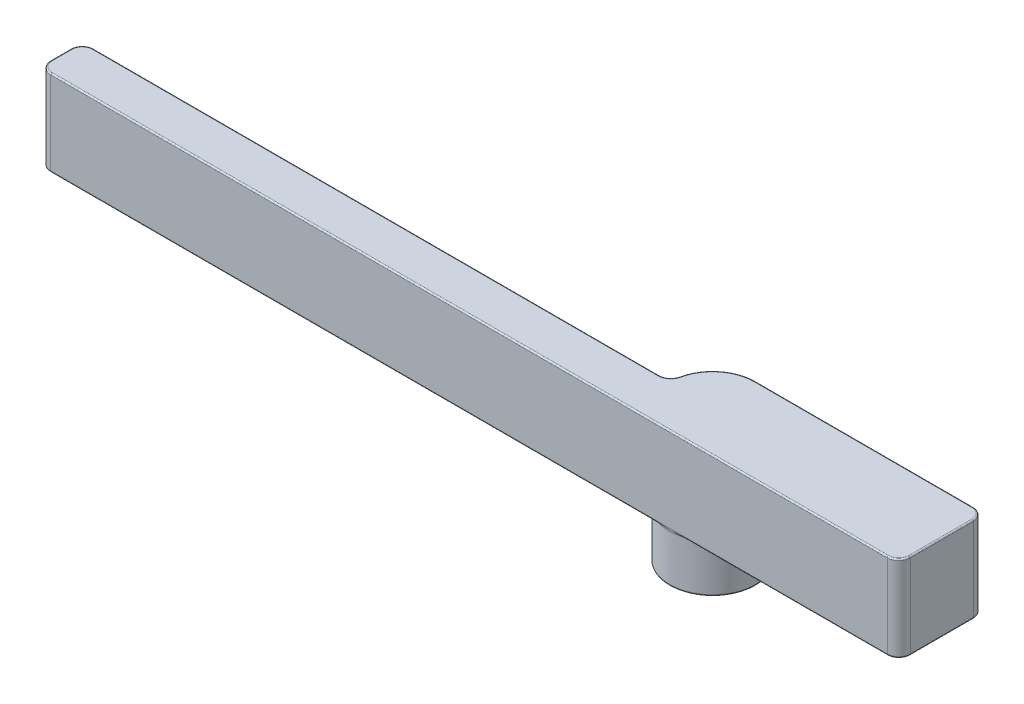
ISO-10303-21;
HEADER;
FILE_DESCRIPTION(('STEP AP214'),'2;1');
FILE_NAME('part.step','',(''),(''),'','','');
FILE_SCHEMA(('AUTOMOTIVE_DESIGN { 1 0 10303 214 1 1 1 1 }'));
ENDSEC;
DATA;
#1=APPLICATION_CONTEXT('core data for automotive mechanical design processes');
#2=APPLICATION_PROTOCOL_DEFINITION('international standard','automotive_design',2000,#1);
#3=PRODUCT_CONTEXT('',#1,'mechanical');
#4=PRODUCT('Part','Part','',(#3));
#5=PRODUCT_RELATED_PRODUCT_CATEGORY('part','',(#4));
#6=PRODUCT_DEFINITION_FORMATION('','',#4);
#7=PRODUCT_DEFINITION_CONTEXT('part definition',#1,'design');
#8=PRODUCT_DEFINITION('design','',#6,#7);
#9=PRODUCT_DEFINITION_SHAPE('','',#8);
#10=(LENGTH_UNIT() NAMED_UNIT(*) SI_UNIT(.MILLI.,.METRE.));
#11=(NAMED_UNIT(*) PLANE_ANGLE_UNIT() SI_UNIT($,.RADIAN.));
#12=(NAMED_UNIT(*) SI_UNIT($,.STERADIAN.) SOLID_ANGLE_UNIT());
#13=UNCERTAINTY_MEASURE_WITH_UNIT(LENGTH_MEASURE(1.E-05),#10,'distance_accuracy_value','');
#14=(GEOMETRIC_REPRESENTATION_CONTEXT(3) GLOBAL_UNCERTAINTY_ASSIGNED_CONTEXT((#13)) GLOBAL_UNIT_ASSIGNED_CONTEXT((#10,
#11,#12)) REPRESENTATION_CONTEXT('',''));
#15=CARTESIAN_POINT('',(0.,0.,0.));
#16=DIRECTION('',(0.,0.,1.));
#17=DIRECTION('',(1.,0.,0.));
#18=AXIS2_PLACEMENT_3D('',#15,#16,#17);
#19=CARTESIAN_POINT('',(140.,0.,-7.5));
#20=DIRECTION('',(0.,-1.,0.));
#21=DIRECTION('',(0.,0.,-1.));
#22=AXIS2_PLACEMENT_3D('',#19,#20,#21);
#23=CYLINDRICAL_SURFACE('',#22,1.69999999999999);
#24=CARTESIAN_POINT('',(140.,1.55355339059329,-7.5));
#25=DIRECTION('',(0.,1.,0.));
#26=DIRECTION('',(0.,0.,1.));
#27=AXIS2_PLACEMENT_3D('',#24,#25,#26);
#28=CIRCLE('',#27,1.69999999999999);
#29=CARTESIAN_POINT('',(140.,1.55355339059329,-5.80000000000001));
#30=VERTEX_POINT('',#29);
#31=EDGE_CURVE('E1370',#30,#30,#28,.F.);
#32=ORIENTED_EDGE('',*,*,#31,.T.);
#33=EDGE_LOOP('',(#32));
#34=FACE_BOUND('',#33,.T.);
#35=CARTESIAN_POINT('',(140.,5.75,-7.5));
#36=DIRECTION('',(0.,-1.,0.));
#37=DIRECTION('',(1.,0.,0.));
#38=AXIS2_PLACEMENT_3D('',#35,#36,#37);
#39=CIRCLE('',#38,1.69999999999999);
#40=CARTESIAN_POINT('',(141.7,5.75,-7.5));
#41=VERTEX_POINT('',#40);
#42=EDGE_CURVE('E1366',#41,#41,#39,.F.);
#43=ORIENTED_EDGE('',*,*,#42,.T.);
#44=EDGE_LOOP('',(#43));
#45=FACE_BOUND('',#44,.T.);
#46=ADVANCED_FACE('F43',(#34,#45),#23,.F.);
#47=CARTESIAN_POINT('',(140.,11.858556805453,-7.5));
#48=DIRECTION('',(0.,-1.,0.));
#49=DIRECTION('',(0.,0.,-1.));
#50=AXIS2_PLACEMENT_3D('',#47,#48,#49);
#51=CIRCLE('',#50,1.69999999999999);
#52=CARTESIAN_POINT('',(140.,11.858556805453,-9.19999999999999));
#53=VERTEX_POINT('',#52);
#54=EDGE_CURVE('E1381',#53,#53,#51,.F.);
#55=ORIENTED_EDGE('',*,*,#54,.T.);
#56=EDGE_LOOP('',(#55));
#57=FACE_BOUND('',#56,.T.);
#58=CARTESIAN_POINT('',(140.,8.95,-7.5));
#59=DIRECTION('',(0.,1.,0.));
#60=DIRECTION('',(0.,0.,1.));
#61=AXIS2_PLACEMENT_3D('',#58,#59,#60);
#62=CIRCLE('',#61,1.69999999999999);
#63=CARTESIAN_POINT('',(140.,8.95,-5.80000000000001));
#64=VERTEX_POINT('',#63);
#65=EDGE_CURVE('E1377',#64,#64,#62,.F.);
#66=ORIENTED_EDGE('',*,*,#65,.T.);
#67=EDGE_LOOP('',(#66));
#68=FACE_BOUND('',#67,.T.);
#69=ADVANCED_FACE('F1076',(#57,#68),#23,.F.);
#70=CARTESIAN_POINT('',(0.,15.,-15.));
#71=DIRECTION('',(0.,0.,1.));
#72=DIRECTION('',(1.,0.,0.));
#73=AXIS2_PLACEMENT_3D('',#70,#71,#72);
#74=PLANE('',#73);
#75=CARTESIAN_POINT('',(137.35,6.25,-15.));
#76=DIRECTION('',(0.,0.,1.));
#77=DIRECTION('',(1.,0.,0.));
#78=AXIS2_PLACEMENT_3D('',#75,#76,#77);
#79=CIRCLE('',#78,0.5);
#80=CARTESIAN_POINT('',(137.35,5.75,-15.));
#81=VERTEX_POINT('',#80);
#82=CARTESIAN_POINT('',(136.85,6.25,-15.));
#83=VERTEX_POINT('',#82);
#84=EDGE_CURVE('E1771',#81,#83,#79,.F.);
#85=ORIENTED_EDGE('',*,*,#84,.F.);
#86=DIRECTION('',(-1.,0.,0.));
#87=VECTOR('',#86,1.);
#88=CARTESIAN_POINT('',(0.,5.75000000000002,-15.));
#89=LINE('',#88,#87);
#90=CARTESIAN_POINT('',(142.65,5.75,-15.));
#91=VERTEX_POINT('',#90);
#92=EDGE_CURVE('E1779',#81,#91,#89,.F.);
#93=ORIENTED_EDGE('',*,*,#92,.T.);
#94=CARTESIAN_POINT('',(142.65,6.25,-15.));
#95=DIRECTION('',(0.,0.,1.));
#96=DIRECTION('',(1.,0.,0.));
#97=AXIS2_PLACEMENT_3D('',#94,#95,#96);
#98=CIRCLE('',#97,0.5);
#99=CARTESIAN_POINT('',(143.15,6.25,-15.));
#100=VERTEX_POINT('',#99);
#101=EDGE_CURVE('E1775',#100,#91,#98,.F.);
#102=ORIENTED_EDGE('',*,*,#101,.F.);
#103=DIRECTION('',(0.,-1.,0.));
#104=VECTOR('',#103,1.);
#105=CARTESIAN_POINT('',(143.15,15.,-15.));
#106=LINE('',#105,#104);
#107=CARTESIAN_POINT('',(143.15,8.45,-15.));
#108=VERTEX_POINT('',#107);
#109=EDGE_CURVE('E1767',#100,#108,#106,.F.);
#110=ORIENTED_EDGE('',*,*,#109,.T.);
#111=CARTESIAN_POINT('',(142.65,8.45,-15.));
#112=DIRECTION('',(0.,0.,1.));
#113=DIRECTION('',(1.,0.,0.));
#114=AXIS2_PLACEMENT_3D('',#111,#112,#113);
#115=CIRCLE('',#114,0.5);
#116=CARTESIAN_POINT('',(142.65,8.95,-15.));
#117=VERTEX_POINT('',#116);
#118=EDGE_CURVE('E1764',#117,#108,#115,.F.);
#119=ORIENTED_EDGE('',*,*,#118,.F.);
#120=DIRECTION('',(1.,0.,0.));
#121=VECTOR('',#120,1.);
#122=CARTESIAN_POINT('',(0.,8.95,-15.));
#123=LINE('',#122,#121);
#124=CARTESIAN_POINT('',(137.35,8.95,-15.));
#125=VERTEX_POINT('',#124);
#126=EDGE_CURVE('E1758',#117,#125,#123,.F.);
#127=ORIENTED_EDGE('',*,*,#126,.T.);
#128=CARTESIAN_POINT('',(137.35,8.45,-15.));
#129=DIRECTION('',(0.,0.,1.));
#130=DIRECTION('',(1.,0.,0.));
#131=AXIS2_PLACEMENT_3D('',#128,#129,#130);
#132=CIRCLE('',#131,0.5);
#133=CARTESIAN_POINT('',(136.85,8.45,-15.));
#134=VERTEX_POINT('',#133);
#135=EDGE_CURVE('E1754',#134,#125,#132,.F.);
#136=ORIENTED_EDGE('',*,*,#135,.F.);
#137=DIRECTION('',(0.,1.,0.));
#138=VECTOR('',#137,1.);
#139=CARTESIAN_POINT('',(136.85,15.,-15.));
#140=LINE('',#139,#138);
#141=EDGE_CURVE('E1761',#134,#83,#140,.F.);
#142=ORIENTED_EDGE('',*,*,#141,.T.);
#143=EDGE_LOOP('',(#85,#93,#102,#110,#119,#127,#136,#142));
#144=FACE_BOUND('',#143,.T.);
#145=DIRECTION('',(0.,-1.,0.));
#146=VECTOR('',#145,1.);
#147=CARTESIAN_POINT('',(148.,15.,-15.));
#148=LINE('',#147,#146);
#149=CARTESIAN_POINT('',(148.,14.75,-15.));
#150=VERTEX_POINT('',#149);
#151=CARTESIAN_POINT('',(148.,0.25,-15.));
#152=VERTEX_POINT('',#151);
#153=EDGE_CURVE('E1262',#150,#152,#148,.T.);
#154=ORIENTED_EDGE('',*,*,#153,.T.);
#155=DIRECTION('',(-1.,0.,0.));
#156=VECTOR('',#155,1.);
#157=CARTESIAN_POINT('',(110.,0.25,-15.));
#158=LINE('',#157,#156);
#159=CARTESIAN_POINT('',(110.,0.25,-15.));
#160=VERTEX_POINT('',#159);
#161=EDGE_CURVE('E1751',#152,#160,#158,.T.);
#162=ORIENTED_EDGE('',*,*,#161,.T.);
#163=DIRECTION('',(0.,1.,0.));
#164=VECTOR('',#163,1.);
#165=CARTESIAN_POINT('',(110.,-110.255385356,-15.));
#166=LINE('',#165,#164);
#167=CARTESIAN_POINT('',(110.,14.75,-15.));
#168=VERTEX_POINT('',#167);
#169=EDGE_CURVE('E1533',#160,#168,#166,.T.);
#170=ORIENTED_EDGE('',*,*,#169,.T.);
#171=DIRECTION('',(-1.,0.,0.));
#172=VECTOR('',#171,1.);
#173=CARTESIAN_POINT('',(0.,14.75,-15.));
#174=LINE('',#173,#172);
#175=EDGE_CURVE('E1748',#168,#150,#174,.F.);
#176=ORIENTED_EDGE('',*,*,#175,.T.);
#177=EDGE_LOOP('',(#154,#162,#170,#176));
#178=FACE_BOUND('',#177,.T.);
#179=ADVANCED_FACE('F1082',(#144,#178),#74,.F.);
#180=CARTESIAN_POINT('',(0.,15.,0.));
#181=DIRECTION('',(0.,-1.,0.));
#182=DIRECTION('',(0.,0.,-1.));
#183=AXIS2_PLACEMENT_3D('',#180,#181,#182);
#184=PLANE('',#183);
#185=DIRECTION('',(1.,0.,0.));
#186=VECTOR('',#185,1.);
#187=CARTESIAN_POINT('',(0.,15.,-0.25));
#188=LINE('',#187,#186);
#189=CARTESIAN_POINT('',(2.,15.,-0.25));
#190=VERTEX_POINT('',#189);
#191=CARTESIAN_POINT('',(148.,15.,-0.25));
#192=VERTEX_POINT('',#191);
#193=EDGE_CURVE('E1311',#190,#192,#188,.T.);
#194=ORIENTED_EDGE('',*,*,#193,.T.);
#195=CARTESIAN_POINT('',(148.,15.,-2.));
#196=DIRECTION('',(0.,-1.,0.));
#197=DIRECTION('',(0.,0.,-1.));
#198=AXIS2_PLACEMENT_3D('',#195,#196,#197);
#199=CIRCLE('',#198,1.75);
#200=CARTESIAN_POINT('',(149.75,15.,-2.));
#201=VERTEX_POINT('',#200);
#202=EDGE_CURVE('E1314',#192,#201,#199,.F.);
#203=ORIENTED_EDGE('',*,*,#202,.T.);
#204=DIRECTION('',(0.,0.,-1.));
#205=VECTOR('',#204,1.);
#206=CARTESIAN_POINT('',(149.75,15.,0.));
#207=LINE('',#206,#205);
#208=CARTESIAN_POINT('',(149.75,15.,-13.));
#209=VERTEX_POINT('',#208);
#210=EDGE_CURVE('E1308',#201,#209,#207,.T.);
#211=ORIENTED_EDGE('',*,*,#210,.T.);
#212=CARTESIAN_POINT('',(148.,15.,-13.));
#213=DIRECTION('',(0.,-1.,0.));
#214=DIRECTION('',(0.,0.,-1.));
#215=AXIS2_PLACEMENT_3D('',#212,#213,#214);
#216=CIRCLE('',#215,1.75);
#217=CARTESIAN_POINT('',(148.,15.,-14.75));
#218=VERTEX_POINT('',#217);
#219=EDGE_CURVE('E1302',#209,#218,#216,.F.);
#220=ORIENTED_EDGE('',*,*,#219,.T.);
#221=DIRECTION('',(-1.,0.,0.));
#222=VECTOR('',#221,1.);
#223=CARTESIAN_POINT('',(0.,15.,-14.75));
#224=LINE('',#223,#222);
#225=CARTESIAN_POINT('',(110.,15.,-14.75));
#226=VERTEX_POINT('',#225);
#227=EDGE_CURVE('E1296',#218,#226,#224,.T.);
#228=ORIENTED_EDGE('',*,*,#227,.T.);
#229=CARTESIAN_POINT('',(110.,15.,-7.5));
#230=DIRECTION('',(0.,-1.,0.));
#231=DIRECTION('',(0.,0.,-1.));
#232=AXIS2_PLACEMENT_3D('',#229,#230,#231);
#233=CIRCLE('',#232,7.25000000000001);
#234=CARTESIAN_POINT('',(102.9124856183,15.,-9.02631578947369));
#235=VERTEX_POINT('',#234);
#236=EDGE_CURVE('E1290',#226,#235,#233,.F.);
#237=ORIENTED_EDGE('',*,*,#236,.T.);
#238=CARTESIAN_POINT('',(100.712912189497,15.,-9.5));
#239=DIRECTION('',(0.,-1.,0.));
#240=DIRECTION('',(0.,0.,-1.));
#241=AXIS2_PLACEMENT_3D('',#238,#239,#240);
#242=CIRCLE('',#241,2.25);
#243=CARTESIAN_POINT('',(100.712912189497,15.,-7.25));
#244=VERTEX_POINT('',#243);
#245=EDGE_CURVE('E1266',#235,#244,#242,.T.);
#246=ORIENTED_EDGE('',*,*,#245,.T.);
#247=DIRECTION('',(1.,0.,0.));
#248=VECTOR('',#247,1.);
#249=CARTESIAN_POINT('',(0.,15.,-7.25));
#250=LINE('',#249,#248);
#251=CARTESIAN_POINT('',(2.,15.,-7.25));
#252=VERTEX_POINT('',#251);
#253=EDGE_CURVE('E1281',#244,#252,#250,.F.);
#254=ORIENTED_EDGE('',*,*,#253,.T.);
#255=CARTESIAN_POINT('',(2.,15.,-5.5));
#256=DIRECTION('',(0.,-1.,0.));
#257=DIRECTION('',(0.,0.,-1.));
#258=AXIS2_PLACEMENT_3D('',#255,#256,#257);
#259=CIRCLE('',#258,1.75);
#260=CARTESIAN_POINT('',(0.25,15.,-5.5));
#261=VERTEX_POINT('',#260);
#262=EDGE_CURVE('E1293',#252,#261,#259,.F.);
#263=ORIENTED_EDGE('',*,*,#262,.T.);
#264=DIRECTION('',(0.,0.,1.));
#265=VECTOR('',#264,1.);
#266=CARTESIAN_POINT('',(0.25,15.,0.));
#267=LINE('',#266,#265);
#268=CARTESIAN_POINT('',(0.25,15.,-2.));
#269=VERTEX_POINT('',#268);
#270=EDGE_CURVE('E1299',#261,#269,#267,.T.);
#271=ORIENTED_EDGE('',*,*,#270,.T.);
#272=CARTESIAN_POINT('',(2.,15.,-2.));
#273=DIRECTION('',(0.,-1.,0.));
#274=DIRECTION('',(0.,0.,-1.));
#275=AXIS2_PLACEMENT_3D('',#272,#273,#274);
#276=CIRCLE('',#275,1.75);
#277=EDGE_CURVE('E1305',#269,#190,#276,.F.);
#278=ORIENTED_EDGE('',*,*,#277,.T.);
#279=EDGE_LOOP('',(#194,#203,#211,#220,#228,#237,#246,#254,#263,#271,#278));
#280=FACE_BOUND('',#279,.T.);
#281=ADVANCED_FACE('F848',(#280),#184,.F.);
#282=CARTESIAN_POINT('',(0.,0.,0.));
#283=DIRECTION('',(0.,-1.,0.));
#284=DIRECTION('',(0.,0.,-1.));
#285=AXIS2_PLACEMENT_3D('',#282,#283,#284);
#286=PLANE('',#285);
#287=CARTESIAN_POINT('',(140.,0.,-7.5));
#288=DIRECTION('',(0.,-1.,0.));
#289=DIRECTION('',(0.,0.,-1.));
#290=AXIS2_PLACEMENT_3D('',#287,#288,#289);
#291=CIRCLE('',#290,3.25355339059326);
#292=CARTESIAN_POINT('',(140.,0.,-10.7535533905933));
#293=VERTEX_POINT('',#292);
#294=EDGE_CURVE('E1362',#293,#293,#291,.F.);
#295=ORIENTED_EDGE('',*,*,#294,.T.);
#296=EDGE_LOOP('',(#295));
#297=FACE_BOUND('',#296,.T.);
#298=CARTESIAN_POINT('',(110.,0.,-7.5));
#299=DIRECTION('',(0.,-1.,0.));
#300=DIRECTION('',(0.,0.,-1.));
#301=AXIS2_PLACEMENT_3D('',#298,#299,#300);
#302=CIRCLE('',#301,7.75000000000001);
#303=CARTESIAN_POINT('',(112.738612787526,0.,-0.25));
#304=VERTEX_POINT('',#303);
#305=CARTESIAN_POINT('',(112.738612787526,0.,-14.75));
#306=VERTEX_POINT('',#305);
#307=EDGE_CURVE('E1359',#304,#306,#302,.F.);
#308=ORIENTED_EDGE('',*,*,#307,.T.);
#309=DIRECTION('',(-1.,0.,0.));
#310=VECTOR('',#309,1.);
#311=CARTESIAN_POINT('',(148.,0.,-14.75));
#312=LINE('',#311,#310);
#313=CARTESIAN_POINT('',(148.,0.,-14.75));
#314=VERTEX_POINT('',#313);
#315=EDGE_CURVE('E1358',#306,#314,#312,.F.);
#316=ORIENTED_EDGE('',*,*,#315,.T.);
#317=CARTESIAN_POINT('',(148.,0.,-13.));
#318=DIRECTION('',(0.,-1.,0.));
#319=DIRECTION('',(0.,0.,-1.));
#320=AXIS2_PLACEMENT_3D('',#317,#318,#319);
#321=CIRCLE('',#320,1.75);
#322=CARTESIAN_POINT('',(149.75,0.,-13.));
#323=VERTEX_POINT('',#322);
#324=EDGE_CURVE('E1355',#314,#323,#321,.T.);
#325=ORIENTED_EDGE('',*,*,#324,.T.);
#326=DIRECTION('',(0.,0.,-1.));
#327=VECTOR('',#326,1.);
#328=CARTESIAN_POINT('',(149.75,0.,-2.));
#329=LINE('',#328,#327);
#330=CARTESIAN_POINT('',(149.75,0.,-2.));
#331=VERTEX_POINT('',#330);
#332=EDGE_CURVE('E1351',#323,#331,#329,.F.);
#333=ORIENTED_EDGE('',*,*,#332,.T.);
#334=CARTESIAN_POINT('',(148.,0.,-2.));
#335=DIRECTION('',(0.,-1.,0.));
#336=DIRECTION('',(0.,0.,-1.));
#337=AXIS2_PLACEMENT_3D('',#334,#335,#336);
#338=CIRCLE('',#337,1.75);
#339=CARTESIAN_POINT('',(148.,0.,-0.25));
#340=VERTEX_POINT('',#339);
#341=EDGE_CURVE('E434',#331,#340,#338,.T.);
#342=ORIENTED_EDGE('',*,*,#341,.T.);
#343=DIRECTION('',(1.,0.,0.));
#344=VECTOR('',#343,1.);
#345=CARTESIAN_POINT('',(110.,0.,-0.25));
#346=LINE('',#345,#344);
#347=EDGE_CURVE('E1354',#340,#304,#346,.F.);
#348=ORIENTED_EDGE('',*,*,#347,.T.);
#349=EDGE_LOOP('',(#308,#316,#325,#333,#342,#348));
#350=FACE_BOUND('',#349,.T.);
#351=ADVANCED_FACE('F2087',(#297,#350),#286,.T.);
#352=CARTESIAN_POINT('',(0.,15.,0.));
#353=DIRECTION('',(1.,0.,0.));
#354=DIRECTION('',(0.,0.,-1.));
#355=AXIS2_PLACEMENT_3D('',#352,#353,#354);
#356=PLANE('',#355);
#357=DIRECTION('',(0.,1.,0.));
#358=VECTOR('',#357,1.);
#359=CARTESIAN_POINT('',(0.,15.,-5.5));
#360=LINE('',#359,#358);
#361=CARTESIAN_POINT('',(0.,14.75,-5.5));
#362=VERTEX_POINT('',#361);
#363=CARTESIAN_POINT('',(0.,0.25,-5.5));
#364=VERTEX_POINT('',#363);
#365=EDGE_CURVE('E2672',#362,#364,#360,.F.);
#366=ORIENTED_EDGE('',*,*,#365,.T.);
#367=DIRECTION('',(0.,0.,1.));
#368=VECTOR('',#367,1.);
#369=CARTESIAN_POINT('',(0.,0.25,-2.));
#370=LINE('',#369,#368);
#371=CARTESIAN_POINT('',(0.,0.25,-2.));
#372=VERTEX_POINT('',#371);
#373=EDGE_CURVE('E1170',#364,#372,#370,.T.);
#374=ORIENTED_EDGE('',*,*,#373,.T.);
#375=DIRECTION('',(0.,-1.,0.));
#376=VECTOR('',#375,1.);
#377=CARTESIAN_POINT('',(0.,15.,-2.));
#378=LINE('',#377,#376);
#379=CARTESIAN_POINT('',(0.,14.75,-2.));
#380=VERTEX_POINT('',#379);
#381=EDGE_CURVE('E2676',#372,#380,#378,.F.);
#382=ORIENTED_EDGE('',*,*,#381,.T.);
#383=DIRECTION('',(0.,0.,1.));
#384=VECTOR('',#383,1.);
#385=CARTESIAN_POINT('',(0.,14.75,0.));
#386=LINE('',#385,#384);
#387=EDGE_CURVE('E1167',#380,#362,#386,.F.);
#388=ORIENTED_EDGE('',*,*,#387,.T.);
#389=EDGE_LOOP('',(#366,#374,#382,#388));
#390=FACE_BOUND('',#389,.T.);
#391=ADVANCED_FACE('F1193',(#390),#356,.F.);
#392=CARTESIAN_POINT('',(0.,15.,0.));
#393=DIRECTION('',(0.,0.,-1.));
#394=DIRECTION('',(-1.,0.,0.));
#395=AXIS2_PLACEMENT_3D('',#392,#393,#394);
#396=PLANE('',#395);
#397=CARTESIAN_POINT('',(112.738612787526,0.25,0.));
#398=CARTESIAN_POINT('',(112.282177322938,0.25,0.));
#399=CARTESIAN_POINT('',(111.825741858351,0.25,0.));
#400=CARTESIAN_POINT('',(111.141088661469,0.25,0.));
#401=CARTESIAN_POINT('',(110.912870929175,0.25,0.));
#402=CARTESIAN_POINT('',(110.456435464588,0.25,0.));
#403=CARTESIAN_POINT('',(110.228217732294,0.25,0.));
#404=CARTESIAN_POINT('',(110.,0.25,0.));
#405=B_SPLINE_CURVE_WITH_KNOTS('',3,(#397,#398,#399,#400,#401,#402,#403,#404),.UNSPECIFIED.,.F.,
.F.,(4,2,2,4),(0.,0.5,0.75,1.),.UNSPECIFIED.);
#406=CARTESIAN_POINT('',(112.738612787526,0.25,0.));
#407=VERTEX_POINT('',#406);
#408=CARTESIAN_POINT('',(110.,0.25,0.));
#409=VERTEX_POINT('',#408);
#410=EDGE_CURVE('E705',#407,#409,#405,.T.);
#411=ORIENTED_EDGE('',*,*,#410,.F.);
#412=DIRECTION('',(1.,0.,0.));
#413=VECTOR('',#412,1.);
#414=CARTESIAN_POINT('',(148.,0.25,0.));
#415=LINE('',#414,#413);
#416=CARTESIAN_POINT('',(148.,0.25,0.));
#417=VERTEX_POINT('',#416);
#418=EDGE_CURVE('E1208',#407,#417,#415,.T.);
#419=ORIENTED_EDGE('',*,*,#418,.T.);
#420=DIRECTION('',(0.,-1.,0.));
#421=VECTOR('',#420,1.);
#422=CARTESIAN_POINT('',(148.,15.,0.));
#423=LINE('',#422,#421);
#424=CARTESIAN_POINT('',(148.,14.75,0.));
#425=VERTEX_POINT('',#424);
#426=EDGE_CURVE('E403',#417,#425,#423,.F.);
#427=ORIENTED_EDGE('',*,*,#426,.T.);
#428=DIRECTION('',(1.,0.,0.));
#429=VECTOR('',#428,1.);
#430=CARTESIAN_POINT('',(0.,14.75,0.));
#431=LINE('',#430,#429);
#432=CARTESIAN_POINT('',(2.,14.75,0.));
#433=VERTEX_POINT('',#432);
#434=EDGE_CURVE('E1173',#425,#433,#431,.F.);
#435=ORIENTED_EDGE('',*,*,#434,.T.);
#436=DIRECTION('',(0.,-1.,0.));
#437=VECTOR('',#436,1.);
#438=CARTESIAN_POINT('',(2.,15.,0.));
#439=LINE('',#438,#437);
#440=CARTESIAN_POINT('',(2.,0.25,0.));
#441=VERTEX_POINT('',#440);
#442=EDGE_CURVE('E419',#433,#441,#439,.T.);
#443=ORIENTED_EDGE('',*,*,#442,.T.);
#444=DIRECTION('',(1.,0.,0.));
#445=VECTOR('',#444,1.);
#446=CARTESIAN_POINT('',(110.,0.25,0.));
#447=LINE('',#446,#445);
#448=CARTESIAN_POINT('',(107.261387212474,0.25,0.));
#449=VERTEX_POINT('',#448);
#450=EDGE_CURVE('E1200',#441,#449,#447,.T.);
#451=ORIENTED_EDGE('',*,*,#450,.T.);
#452=CARTESIAN_POINT('',(110.,0.25,0.));
#453=CARTESIAN_POINT('',(109.771782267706,0.25,0.));
#454=CARTESIAN_POINT('',(109.543564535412,0.25,0.));
#455=CARTESIAN_POINT('',(109.087129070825,0.25,0.));
#456=CARTESIAN_POINT('',(108.858911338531,0.25,0.));
#457=CARTESIAN_POINT('',(108.174258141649,0.25,0.));
#458=CARTESIAN_POINT('',(107.717822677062,0.25,0.));
#459=CARTESIAN_POINT('',(107.261387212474,0.25,0.));
#460=B_SPLINE_CURVE_WITH_KNOTS('',3,(#452,#453,#454,#455,#456,#457,#458,#459),.UNSPECIFIED.,.F.,
.F.,(4,2,2,4),(0.,0.25,0.5,1.),.UNSPECIFIED.);
#461=EDGE_CURVE('E772',#409,#449,#460,.T.);
#462=ORIENTED_EDGE('',*,*,#461,.F.);
#463=EDGE_LOOP('',(#411,#419,#427,#435,#443,#451,#462));
#464=FACE_BOUND('',#463,.T.);
#465=ADVANCED_FACE('F1183',(#464),#396,.F.);
#466=CARTESIAN_POINT('',(150.,15.,0.));
#467=DIRECTION('',(-1.,0.,0.));
#468=DIRECTION('',(0.,0.,1.));
#469=AXIS2_PLACEMENT_3D('',#466,#467,#468);
#470=PLANE('',#469);
#471=DIRECTION('',(0.,-1.,0.));
#472=VECTOR('',#471,1.);
#473=CARTESIAN_POINT('',(150.,15.,-2.));
#474=LINE('',#473,#472);
#475=CARTESIAN_POINT('',(150.,14.75,-2.));
#476=VERTEX_POINT('',#475);
#477=CARTESIAN_POINT('',(150.,0.25,-2.));
#478=VERTEX_POINT('',#477);
#479=EDGE_CURVE('E400',#476,#478,#474,.T.);
#480=ORIENTED_EDGE('',*,*,#479,.T.);
#481=DIRECTION('',(0.,0.,-1.));
#482=VECTOR('',#481,1.);
#483=CARTESIAN_POINT('',(150.,0.25,-13.));
#484=LINE('',#483,#482);
#485=CARTESIAN_POINT('',(150.,0.25,-13.));
#486=VERTEX_POINT('',#485);
#487=EDGE_CURVE('E415',#478,#486,#484,.T.);
#488=ORIENTED_EDGE('',*,*,#487,.T.);
#489=DIRECTION('',(0.,-1.,0.));
#490=VECTOR('',#489,1.);
#491=CARTESIAN_POINT('',(150.,15.,-13.));
#492=LINE('',#491,#490);
#493=CARTESIAN_POINT('',(150.,14.75,-13.));
#494=VERTEX_POINT('',#493);
#495=EDGE_CURVE('E420',#486,#494,#492,.F.);
#496=ORIENTED_EDGE('',*,*,#495,.T.);
#497=DIRECTION('',(0.,0.,-1.));
#498=VECTOR('',#497,1.);
#499=CARTESIAN_POINT('',(150.,14.75,0.));
#500=LINE('',#499,#498);
#501=EDGE_CURVE('E417',#494,#476,#500,.F.);
#502=ORIENTED_EDGE('',*,*,#501,.T.);
#503=EDGE_LOOP('',(#480,#488,#496,#502));
#504=FACE_BOUND('',#503,.T.);
#505=ADVANCED_FACE('F414',(#504),#470,.F.);
#506=CARTESIAN_POINT('',(2.,0.,-2.));
#507=DIRECTION('',(0.,-1.,0.));
#508=DIRECTION('',(0.,0.,-1.));
#509=AXIS2_PLACEMENT_3D('',#506,#507,#508);
#510=CIRCLE('',#509,1.75);
#511=CARTESIAN_POINT('',(2.,0.,-0.25));
#512=VERTEX_POINT('',#511);
#513=CARTESIAN_POINT('',(0.25,0.,-2.));
#514=VERTEX_POINT('',#513);
#515=EDGE_CURVE('E1335',#512,#514,#510,.T.);
#516=ORIENTED_EDGE('',*,*,#515,.T.);
#517=DIRECTION('',(0.,0.,1.));
#518=VECTOR('',#517,1.);
#519=CARTESIAN_POINT('',(0.25,0.,-5.5));
#520=LINE('',#519,#518);
#521=CARTESIAN_POINT('',(0.25,0.,-5.5));
#522=VERTEX_POINT('',#521);
#523=EDGE_CURVE('E1338',#514,#522,#520,.F.);
#524=ORIENTED_EDGE('',*,*,#523,.T.);
#525=CARTESIAN_POINT('',(2.,0.,-5.5));
#526=DIRECTION('',(0.,-1.,0.));
#527=DIRECTION('',(0.,0.,-1.));
#528=AXIS2_PLACEMENT_3D('',#525,#526,#527);
#529=CIRCLE('',#528,1.75);
#530=CARTESIAN_POINT('',(2.,0.,-7.25));
#531=VERTEX_POINT('',#530);
#532=EDGE_CURVE('E1332',#522,#531,#529,.T.);
#533=ORIENTED_EDGE('',*,*,#532,.T.);
#534=DIRECTION('',(1.,0.,0.));
#535=VECTOR('',#534,1.);
#536=CARTESIAN_POINT('',(100.712912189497,0.,-7.25));
#537=LINE('',#536,#535);
#538=CARTESIAN_POINT('',(100.712912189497,0.,-7.25));
#539=VERTEX_POINT('',#538);
#540=EDGE_CURVE('E1328',#531,#539,#537,.T.);
#541=ORIENTED_EDGE('',*,*,#540,.T.);
#542=CARTESIAN_POINT('',(100.712912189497,0.,-9.5));
#543=DIRECTION('',(0.,-1.,0.));
#544=DIRECTION('',(0.,0.,-1.));
#545=AXIS2_PLACEMENT_3D('',#542,#543,#544);
#546=CIRCLE('',#545,2.25);
#547=CARTESIAN_POINT('',(102.258598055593,0.,-7.86496018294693));
#548=VERTEX_POINT('',#547);
#549=EDGE_CURVE('E1324',#539,#548,#546,.F.);
#550=ORIENTED_EDGE('',*,*,#549,.T.);
#551=CARTESIAN_POINT('',(110.,0.,-7.5));
#552=DIRECTION('',(0.,-1.,0.));
#553=DIRECTION('',(0.,0.,-1.));
#554=AXIS2_PLACEMENT_3D('',#551,#552,#553);
#555=CIRCLE('',#554,7.75000000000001);
#556=CARTESIAN_POINT('',(107.261387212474,0.,-0.249999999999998));
#557=VERTEX_POINT('',#556);
#558=EDGE_CURVE('E1327',#548,#557,#555,.F.);
#559=ORIENTED_EDGE('',*,*,#558,.T.);
#560=DIRECTION('',(1.,0.,0.));
#561=VECTOR('',#560,1.);
#562=CARTESIAN_POINT('',(2.,0.,-0.25));
#563=LINE('',#562,#561);
#564=EDGE_CURVE('E560',#557,#512,#563,.F.);
#565=ORIENTED_EDGE('',*,*,#564,.T.);
#566=EDGE_LOOP('',(#516,#524,#533,#541,#550,#559,#565));
#567=FACE_BOUND('',#566,.T.);
#568=ADVANCED_FACE('F845',(#567),#286,.T.);
#569=CARTESIAN_POINT('',(110.,-8.5,-7.5));
#570=DIRECTION('',(0.,1.,0.));
#571=DIRECTION('',(0.,0.,1.));
#572=AXIS2_PLACEMENT_3D('',#569,#570,#571);
#573=CYLINDRICAL_SURFACE('',#572,7.50000000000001);
#574=CARTESIAN_POINT('',(110.,-8.25,-7.5));
#575=DIRECTION('',(0.,-1.,0.));
#576=DIRECTION('',(0.,0.,-1.));
#577=AXIS2_PLACEMENT_3D('',#574,#575,#576);
#578=CIRCLE('',#577,7.50000000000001);
#579=CARTESIAN_POINT('',(110.,-8.25,-15.));
#580=VERTEX_POINT('',#579);
#581=EDGE_CURVE('E1276',#580,#580,#578,.F.);
#582=ORIENTED_EDGE('',*,*,#581,.T.);
#583=EDGE_LOOP('',(#582));
#584=FACE_BOUND('',#583,.T.);
#585=DIRECTION('',(0.,1.,0.));
#586=VECTOR('',#585,1.);
#587=CARTESIAN_POINT('',(102.668088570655,-8.5,-9.07894736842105));
#588=LINE('',#587,#586);
#589=CARTESIAN_POINT('',(102.668088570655,0.25,-9.07894736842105));
#590=VERTEX_POINT('',#589);
#591=CARTESIAN_POINT('',(102.668088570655,14.75,-9.07894736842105));
#592=VERTEX_POINT('',#591);
#593=EDGE_CURVE('E1247',#590,#592,#588,.T.);
#594=ORIENTED_EDGE('',*,*,#593,.T.);
#595=CARTESIAN_POINT('',(110.,14.75,-7.5));
#596=DIRECTION('',(0.,-1.,0.));
#597=DIRECTION('',(0.,0.,-1.));
#598=AXIS2_PLACEMENT_3D('',#595,#596,#597);
#599=CIRCLE('',#598,7.50000000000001);
#600=EDGE_CURVE('E1257',#592,#168,#599,.T.);
#601=ORIENTED_EDGE('',*,*,#600,.T.);
#602=ORIENTED_EDGE('',*,*,#169,.F.);
#603=CARTESIAN_POINT('',(113.326331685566,0.0335345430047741,-14.6249291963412));
#604=CARTESIAN_POINT('',(113.259065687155,0.0948519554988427,-14.5188044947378));
#605=CARTESIAN_POINT('',(113.223850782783,0.0238105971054,-14.4036523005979));
#606=CARTESIAN_POINT('',(113.18863587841,-0.0472307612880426,-14.288500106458));
#607=CARTESIAN_POINT('',(113.219030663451,-0.182930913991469,-14.274056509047));
#608=CARTESIAN_POINT('',(113.279033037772,0.0270758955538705,-14.6361704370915));
#609=CARTESIAN_POINT('',(113.216174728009,0.0820083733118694,-14.5284070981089));
#610=CARTESIAN_POINT('',(113.181626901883,0.00965681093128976,-14.4181774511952));
#611=CARTESIAN_POINT('',(113.147597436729,-0.0625509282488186,-14.3077644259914));
#612=CARTESIAN_POINT('',(113.173257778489,-0.195848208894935,-14.2958137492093));
#613=CARTESIAN_POINT('',(113.231047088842,0.0217859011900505,-14.6472751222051));
#614=CARTESIAN_POINT('',(113.171720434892,0.0705142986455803,-14.5388211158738));
#615=CARTESIAN_POINT('',(113.138076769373,-0.00269338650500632,-14.4331590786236));
#616=CARTESIAN_POINT('',(113.104911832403,-0.0757928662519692,-14.3273323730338));
#617=CARTESIAN_POINT('',(113.126819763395,-0.206428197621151,-14.317306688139));
#618=CARTESIAN_POINT('',(113.134131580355,0.0131538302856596,-14.669097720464));
#619=CARTESIAN_POINT('',(113.081032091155,0.0501692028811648,-14.5605529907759));
#620=CARTESIAN_POINT('',(113.049078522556,-0.0242115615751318,-14.4635254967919));
#621=CARTESIAN_POINT('',(113.017595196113,-0.0984711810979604,-14.3663388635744));
#622=CARTESIAN_POINT('',(113.033030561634,-0.223692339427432,-14.3595439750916));
#623=CARTESIAN_POINT('',(113.085203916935,0.00980819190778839,-14.6798163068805));
#624=CARTESIAN_POINT('',(113.034765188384,0.0412732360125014,-14.5718728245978));
#625=CARTESIAN_POINT('',(113.003634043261,-0.0333853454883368,-14.4789094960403));
#626=CARTESIAN_POINT('',(112.972935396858,-0.107968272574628,-14.3858025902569));
#627=CARTESIAN_POINT('',(112.985681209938,-0.230383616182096,-14.3802896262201));
#628=CARTESIAN_POINT('',(112.986964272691,0.00467056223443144,-14.7007301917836));
#629=CARTESIAN_POINT('',(112.941316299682,0.0258673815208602,-14.5948134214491));
#630=CARTESIAN_POINT('',(112.911726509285,-0.0489760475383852,-14.5095328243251));
#631=CARTESIAN_POINT('',(112.882560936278,-0.123749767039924,-14.4241103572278));
#632=CARTESIAN_POINT('',(112.890610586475,-0.240658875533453,-14.4207681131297));
#633=CARTESIAN_POINT('',(112.93765653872,0.00286909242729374,-14.7109283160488));
#634=CARTESIAN_POINT('',(112.89410768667,0.0193143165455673,-14.6064395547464));
#635=CARTESIAN_POINT('',(112.865271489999,-0.0554096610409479,-14.5247724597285));
#636=CARTESIAN_POINT('',(112.836823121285,-0.1300901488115,-14.4429805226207));
#637=CARTESIAN_POINT('',(112.842893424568,-0.244261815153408,-14.4405064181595));
#638=CARTESIAN_POINT('',(112.838502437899,0.000533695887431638,-14.7308375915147));
#639=CARTESIAN_POINT('',(112.798795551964,0.00822882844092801,-14.6297599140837));
#640=CARTESIAN_POINT('',(112.771379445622,-0.0659704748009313,-14.5549639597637));
#641=CARTESIAN_POINT('',(112.744347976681,-0.140126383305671,-14.4800444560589));
#642=CARTESIAN_POINT('',(112.746937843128,-0.248932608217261,-14.4790404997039));
#643=CARTESIAN_POINT('',(112.788655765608,5.30359774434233E-07,-14.7405484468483));
#644=CARTESIAN_POINT('',(112.750656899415,0.00367623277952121,-14.6414638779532));
#645=CARTESIAN_POINT('',(112.723941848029,-0.0700962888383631,-14.5699156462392));
#646=CARTESIAN_POINT('',(112.697577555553,-0.143846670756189,-14.4982596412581));
#647=CARTESIAN_POINT('',(112.698699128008,-0.249998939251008,-14.4978357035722));
#648=CARTESIAN_POINT('',(112.660169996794,-8.31343424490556E-07,-14.764815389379));
#649=CARTESIAN_POINT('',(112.626494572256,-0.00570864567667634,-14.6712393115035));
#650=CARTESIAN_POINT('',(112.601223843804,-0.0781249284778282,-14.6076903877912));
#651=CARTESIAN_POINT('',(112.576809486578,-0.150483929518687,-14.5438775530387));
#652=CARTESIAN_POINT('',(112.574358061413,-0.250001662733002,-14.5448039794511));
#653=CARTESIAN_POINT('',(112.581244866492,0.00130706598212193,-14.7789936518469));
#654=CARTESIAN_POINT('',(112.549646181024,-0.00931264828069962,-14.6892829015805));
#655=CARTESIAN_POINT('',(112.525420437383,-0.0805724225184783,-14.6301650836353));
#656=CARTESIAN_POINT('',(112.501935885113,-0.15182541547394,-14.5708366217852));
#657=CARTESIAN_POINT('',(112.497978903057,-0.247385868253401,-14.572245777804));
#658=CARTESIAN_POINT('',(112.422723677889,0.00597501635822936,-14.8060301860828));
#659=CARTESIAN_POINT('',(112.394943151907,-0.0129251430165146,-14.7244014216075));
#660=CARTESIAN_POINT('',(112.372614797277,-0.0815095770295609,-14.6735215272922));
#661=CARTESIAN_POINT('',(112.351018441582,-0.150091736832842,-14.6224342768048));
#662=CARTESIAN_POINT('',(112.344571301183,-0.238049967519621,-14.6245745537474));
#663=CARTESIAN_POINT('',(112.3431273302,0.00933600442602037,-14.8188878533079));
#664=CARTESIAN_POINT('',(112.316981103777,-0.0129690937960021,-14.7415116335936));
#665=CARTESIAN_POINT('',(112.295612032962,-0.0799974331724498,-14.6944025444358));
#666=CARTESIAN_POINT('',(112.274871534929,-0.147055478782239,-14.6471328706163));
#667=CARTESIAN_POINT('',(112.267542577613,-0.231327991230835,-14.6494603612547));
#668=CARTESIAN_POINT('',(112.103085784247,0.0218917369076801,-14.85553527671));
#669=CARTESIAN_POINT('',(112.082519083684,-0.00868277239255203,-14.7907674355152));
#670=CARTESIAN_POINT('',(112.062825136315,-0.0706324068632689,-14.7544052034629));
#671=CARTESIAN_POINT('',(112.045655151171,-0.132674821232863,-14.7173895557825));
#672=CARTESIAN_POINT('',(112.035244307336,-0.2062165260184,-14.7203908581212));
#673=CARTESIAN_POINT('',(111.941911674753,0.0335532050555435,-14.8773007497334));
#674=CARTESIAN_POINT('',(111.923475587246,3.72350313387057E-06,-14.8213003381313));
#675=CARTESIAN_POINT('',(111.905765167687,-0.0579289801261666,-14.7907293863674));
#676=CARTESIAN_POINT('',(111.88989110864,-0.116054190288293,-14.759787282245));
#677=CARTESIAN_POINT('',(111.879269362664,-0.182893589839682,-14.7625175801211));
#678=CARTESIAN_POINT('',(111.576549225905,0.0647008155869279,-14.9204193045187));
#679=CARTESIAN_POINT('',(111.563558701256,0.0286600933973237,-14.8823985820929));
#680=CARTESIAN_POINT('',(111.548848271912,-0.0195655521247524,-14.8632823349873));
#681=CARTESIAN_POINT('',(111.537007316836,-0.0681056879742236,-14.8435801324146));
#682=CARTESIAN_POINT('',(111.525692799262,-0.120598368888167,-14.8459728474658));
#683=CARTESIAN_POINT('',(111.372065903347,0.0854327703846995,-14.940195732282));
#684=CARTESIAN_POINT('',(111.360790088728,0.050956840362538,-14.9113516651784));
#685=CARTESIAN_POINT('',(111.348475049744,0.00860337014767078,-14.8970338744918));
#686=CARTESIAN_POINT('',(111.33793547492,-0.0340260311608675,-14.8824776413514));
#687=CARTESIAN_POINT('',(111.327805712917,-0.07913445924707,-14.8842498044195));
#688=CARTESIAN_POINT('',(110.962595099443,0.13066545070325,-14.9713863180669));
#689=CARTESIAN_POINT('',(110.955387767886,0.10278278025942,-14.9571725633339));
#690=CARTESIAN_POINT('',(110.946644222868,0.0726532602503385,-14.9505069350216));
#691=CARTESIAN_POINT('',(110.939635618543,0.0422402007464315,-14.9436125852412));
#692=CARTESIAN_POINT('',(110.931543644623,0.0113309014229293,-14.9446186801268));
#693=CARTESIAN_POINT('',(110.757608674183,0.155161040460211,-14.9828117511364));
#694=CARTESIAN_POINT('',(110.751752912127,0.132367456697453,-14.9742742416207));
#695=CARTESIAN_POINT('',(110.745188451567,0.108523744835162,-14.9702473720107));
#696=CARTESIAN_POINT('',(110.7394268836,0.0845337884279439,-14.9661674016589));
#697=CARTESIAN_POINT('',(110.733169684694,0.060322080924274,-14.9667324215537));
#698=CARTESIAN_POINT('',(110.374060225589,0.202513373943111,-14.9965163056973));
#699=CARTESIAN_POINT('',(110.371341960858,0.190608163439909,-14.99475077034));
#700=CARTESIAN_POINT('',(110.368024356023,0.17878101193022,-14.9939544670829));
#701=CARTESIAN_POINT('',(110.365302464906,0.166840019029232,-14.993123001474));
#702=CARTESIAN_POINT('',(110.361993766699,0.155026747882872,-14.9932573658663));
#703=CARTESIAN_POINT('',(110.19553951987,0.225167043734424,-14.9997941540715));
#704=CARTESIAN_POINT('',(110.193971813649,0.218957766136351,-14.9996906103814));
#705=CARTESIAN_POINT('',(110.192385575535,0.212750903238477,-14.9996429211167));
#706=CARTESIAN_POINT('',(110.190817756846,0.206540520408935,-14.9995944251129));
#707=CARTESIAN_POINT('',(110.189231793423,0.200334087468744,-14.9996015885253));
#708=CARTESIAN_POINT('',(110.011376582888,0.248555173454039,-14.9999968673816));
#709=CARTESIAN_POINT('',(110.011284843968,0.248193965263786,-14.9999953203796));
#710=CARTESIAN_POINT('',(110.011193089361,0.24783276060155,-14.9999945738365));
#711=CARTESIAN_POINT('',(110.011101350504,0.24747155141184,-14.9999938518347));
#712=CARTESIAN_POINT('',(110.011009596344,0.247110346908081,-14.9999939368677));
#713=CARTESIAN_POINT('',(110.005688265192,0.24927759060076,-14.9999999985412));
#714=CARTESIAN_POINT('',(110.005642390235,0.249096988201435,-15.0000000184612));
#715=CARTESIAN_POINT('',(110.005596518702,0.248916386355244,-15.0000000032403));
#716=CARTESIAN_POINT('',(110.005550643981,0.248735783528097,-15.000000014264));
#717=CARTESIAN_POINT('',(110.005504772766,0.248555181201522,-14.9999999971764));
#718=CARTESIAN_POINT('',(110.,0.25,-15.));
#719=CARTESIAN_POINT('',(110.,0.25,-15.));
#720=CARTESIAN_POINT('',(110.,0.25,-15.));
#721=CARTESIAN_POINT('',(110.,0.25,-15.));
#722=CARTESIAN_POINT('',(110.,0.25,-15.));
#723=(BOUNDED_SURFACE() B_SPLINE_SURFACE(3,2,((#603,#604,#605,#606,#607),(#608,#609,#610,#611,
#612),(#613,#614,#615,#616,#617),(#618,#619,#620,#621,#622),(#623,#624,#625,#626,#627),(#628,
#629,#630,#631,#632),(#633,#634,#635,#636,#637),(#638,#639,#640,#641,#642),(#643,#644,#645,#646,
#647),(#648,#649,#650,#651,#652),(#653,#654,#655,#656,#657),(#658,#659,#660,#661,#662),(#663,
#664,#665,#666,#667),(#668,#669,#670,#671,#672),(#673,#674,#675,#676,#677),(#678,#679,#680,#681,
#682),(#683,#684,#685,#686,#687),(#688,#689,#690,#691,#692),(#693,#694,#695,#696,#697),(#698,
#699,#700,#701,#702),(#703,#704,#705,#706,#707),(#708,#709,#710,#711,#712),(#713,#714,#715,#716,
#717),(#718,#719,#720,#721,#722)),.UNSPECIFIED.,.F.,.F.,.F.) B_SPLINE_SURFACE_WITH_KNOTS((4,2,2,
2,2,2,2,2,2,2,2,4),(3,2,3),(0.,0.161661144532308,0.323025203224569,0.483391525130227,
0.643854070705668,0.895380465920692,1.14702149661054,1.65197407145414,2.2881319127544,
2.92342925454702,3.47585005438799,3.49345688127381),(0.,0.5,1.),
.UNSPECIFIED.) GEOMETRIC_REPRESENTATION_ITEM() RATIONAL_B_SPLINE_SURFACE(((1.,0.872787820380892,
1.,0.872787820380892,1.),(1.,0.87813482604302,1.,0.87813482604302,1.),(1.,0.883154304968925,1.,
0.883154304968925,1.),(1.,0.89262120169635,1.,0.89262120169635,1.),(1.,0.897069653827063,1.,
0.897069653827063,1.),(1.,0.905470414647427,1.,0.905470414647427,1.),(1.,0.909425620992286,1.,
0.909425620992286,1.),(1.,0.916938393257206,1.,0.916938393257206,1.),(1.,0.920495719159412,1.,
0.920495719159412,1.),(1.,0.929183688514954,1.,0.929183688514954,1.),(1.,0.934061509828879,1.,
0.934061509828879,1.),(1.,0.943110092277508,1.,0.943110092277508,1.),(1.,0.947280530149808,1.,
0.947280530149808,1.),(1.,0.958914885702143,1.,0.958914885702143,1.),(1.,0.965468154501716,1.,
0.965468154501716,1.),(1.,0.978133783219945,1.,0.978133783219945,1.),(1.,0.983689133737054,1.,
0.983689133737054,1.),(1.,0.992319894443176,1.,0.992319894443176,1.),(1.,0.9953986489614,1.,
0.9953986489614,1.),(1.,0.999075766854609,1.,0.999075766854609,1.),(1.,0.999945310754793,1.,
0.999945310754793,1.),(1.,0.999999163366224,1.,0.999999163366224,1.),(1.,0.999999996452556,1.,
0.999999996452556,1.),(1.,1.,1.,1.,1.))) REPRESENTATION_ITEM('') SURFACE());
#724=CARTESIAN_POINT('',(113.219030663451,-0.182930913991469,-14.274056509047));
#725=CARTESIAN_POINT('',(113.173257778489,-0.195848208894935,-14.2958137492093));
#726=CARTESIAN_POINT('',(113.126819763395,-0.206428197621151,-14.317306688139));
#727=CARTESIAN_POINT('',(113.033030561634,-0.223692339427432,-14.3595439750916));
#728=CARTESIAN_POINT('',(112.985681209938,-0.230383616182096,-14.3802896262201));
#729=CARTESIAN_POINT('',(112.890610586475,-0.240658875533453,-14.4207681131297));
#730=CARTESIAN_POINT('',(112.842893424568,-0.244261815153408,-14.4405064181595));
#731=CARTESIAN_POINT('',(112.746937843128,-0.248932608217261,-14.4790404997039));
#732=CARTESIAN_POINT('',(112.698699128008,-0.249998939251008,-14.4978357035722));
#733=CARTESIAN_POINT('',(112.574358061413,-0.250001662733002,-14.5448039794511));
#734=CARTESIAN_POINT('',(112.497978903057,-0.247385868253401,-14.572245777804));
#735=CARTESIAN_POINT('',(112.344571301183,-0.238049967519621,-14.6245745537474));
#736=CARTESIAN_POINT('',(112.267542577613,-0.231327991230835,-14.6494603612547));
#737=CARTESIAN_POINT('',(112.035244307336,-0.2062165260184,-14.7203908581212));
#738=CARTESIAN_POINT('',(111.879269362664,-0.182893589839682,-14.7625175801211));
#739=CARTESIAN_POINT('',(111.525692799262,-0.120598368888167,-14.8459728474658));
#740=CARTESIAN_POINT('',(111.327805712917,-0.0791344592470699,-14.8842498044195));
#741=CARTESIAN_POINT('',(110.931543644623,0.0113309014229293,-14.9446186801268));
#742=CARTESIAN_POINT('',(110.733169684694,0.060322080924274,-14.9667324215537));
#743=CARTESIAN_POINT('',(110.361993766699,0.155026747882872,-14.9932573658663));
#744=CARTESIAN_POINT('',(110.189231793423,0.200334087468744,-14.9996015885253));
#745=CARTESIAN_POINT('',(110.011009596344,0.247110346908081,-14.9999939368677));
#746=CARTESIAN_POINT('',(110.005504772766,0.248555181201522,-14.9999999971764));
#747=CARTESIAN_POINT('',(110.,0.25,-15.));
#748=B_SPLINE_CURVE_WITH_KNOTS('',3,(#724,#725,#726,#727,#728,#729,#730,#731,#732,#733,#734,
#735,#736,#737,#738,#739,#740,#741,#742,#743,#744,#745,#746,#747),.UNSPECIFIED.,.F.,.F.,(4,2,2,
2,2,2,2,2,2,2,2,4),(0.,0.161661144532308,0.323025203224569,0.483391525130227,0.643854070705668,
0.895380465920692,1.14702149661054,1.65197407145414,2.2881319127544,2.92342925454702,
3.47585005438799,3.49345688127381),.UNSPECIFIED.);
#749=CARTESIAN_POINT('',(112.650270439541,-0.25,-14.5161290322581));
#750=VERTEX_POINT('',#749);
#751=EDGE_CURVE('E54',#160,#750,#748,.F.);
#752=ORIENTED_EDGE('',*,*,#751,.T.);
#753=CARTESIAN_POINT('',(110.,-0.25,-7.5));
#754=DIRECTION('',(0.,-1.,0.));
#755=DIRECTION('',(0.,0.,-1.));
#756=AXIS2_PLACEMENT_3D('',#753,#754,#755);
#757=CIRCLE('',#756,7.50000000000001);
#758=CARTESIAN_POINT('',(112.650270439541,-0.25,-0.48387096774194));
#759=VERTEX_POINT('',#758);
#760=EDGE_CURVE('E1284',#750,#759,#757,.T.);
#761=ORIENTED_EDGE('',*,*,#760,.T.);
#762=CARTESIAN_POINT('',(110.,-0.25,0.));
#763=CARTESIAN_POINT('',(110.223206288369,-0.25,0.));
#764=CARTESIAN_POINT('',(110.446413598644,-0.25,-0.00995677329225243));
#765=CARTESIAN_POINT('',(110.891988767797,-0.25,-0.0498732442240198));
#766=CARTESIAN_POINT('',(111.114358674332,-0.25,-0.0798332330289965));
#767=CARTESIAN_POINT('',(111.557360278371,-0.25,-0.160020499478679));
#768=CARTESIAN_POINT('',(111.777994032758,-0.25,-0.210248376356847));
#769=CARTESIAN_POINT('',(112.216501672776,-0.25,-0.331397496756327));
#770=CARTESIAN_POINT('',(112.434377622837,-0.25,-0.402319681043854));
#771=CARTESIAN_POINT('',(112.650270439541,-0.25,-0.483870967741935));
#772=B_SPLINE_CURVE_WITH_KNOTS('',3,(#762,#763,#764,#765,#766,#767,#768,#769,#770,#771),
.UNSPECIFIED.,.F.,.F.,(4,2,2,2,4),(0.,0.25,0.5,0.75,1.),.UNSPECIFIED.);
#773=CARTESIAN_POINT('',(110.,-0.25,0.));
#774=VERTEX_POINT('',#773);
#775=EDGE_CURVE('E1782',#774,#759,#772,.T.);
#776=ORIENTED_EDGE('',*,*,#775,.F.);
#777=CARTESIAN_POINT('',(107.349729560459,-0.25,-0.483870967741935));
#778=CARTESIAN_POINT('',(107.565622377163,-0.25,-0.402319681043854));
#779=CARTESIAN_POINT('',(107.783498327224,-0.25,-0.331397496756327));
#780=CARTESIAN_POINT('',(108.222005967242,-0.25,-0.210248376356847));
#781=CARTESIAN_POINT('',(108.442639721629,-0.25,-0.160020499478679));
#782=CARTESIAN_POINT('',(108.885641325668,-0.25,-0.0798332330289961));
#783=CARTESIAN_POINT('',(109.108011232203,-0.25,-0.0498732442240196));
#784=CARTESIAN_POINT('',(109.553586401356,-0.25,-0.00995677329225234));
#785=CARTESIAN_POINT('',(109.776793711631,-0.25,0.));
#786=CARTESIAN_POINT('',(110.,-0.25,0.));
#787=B_SPLINE_CURVE_WITH_KNOTS('',3,(#777,#778,#779,#780,#781,#782,#783,#784,#785,#786),
.UNSPECIFIED.,.F.,.F.,(4,2,2,2,4),(0.,0.25,0.5,0.75,1.),.UNSPECIFIED.);
#788=CARTESIAN_POINT('',(107.349729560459,-0.25,-0.483870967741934));
#789=VERTEX_POINT('',#788);
#790=EDGE_CURVE('E555',#789,#774,#787,.T.);
#791=ORIENTED_EDGE('',*,*,#790,.F.);
#792=CARTESIAN_POINT('',(110.,-0.25,-7.5));
#793=DIRECTION('',(0.,-1.,0.));
#794=DIRECTION('',(0.,0.,-1.));
#795=AXIS2_PLACEMENT_3D('',#792,#793,#794);
#796=CIRCLE('',#795,7.50000000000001);
#797=CARTESIAN_POINT('',(102.508320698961,-0.25,-7.85318727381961));
#798=VERTEX_POINT('',#797);
#799=EDGE_CURVE('E796',#789,#798,#796,.T.);
#800=ORIENTED_EDGE('',*,*,#799,.T.);
#801=CARTESIAN_POINT('',(102.50082643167,-0.215402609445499,-7.61133639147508));
#802=CARTESIAN_POINT('',(102.50218400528,0.0888817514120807,-7.70277711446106));
#803=CARTESIAN_POINT('',(102.193086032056,0.0172986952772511,-7.68584991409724));
#804=CARTESIAN_POINT('',(102.501402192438,-0.22762264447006,-7.65075113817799));
#805=CARTESIAN_POINT('',(102.50291465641,0.0708070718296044,-7.72051954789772));
#806=CARTESIAN_POINT('',(102.202762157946,0.0111886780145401,-7.71386645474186));
#807=CARTESIAN_POINT('',(102.502319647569,-0.236295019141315,-7.69099605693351));
#808=CARTESIAN_POINT('',(102.50371631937,0.0536555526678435,-7.74282808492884));
#809=CARTESIAN_POINT('',(102.21316845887,0.00685249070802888,-7.74301551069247));
#810=CARTESIAN_POINT('',(102.504824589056,-0.247454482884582,-7.77190445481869));
#811=CARTESIAN_POINT('',(102.505693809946,0.0237109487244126,-7.79375605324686));
#812=CARTESIAN_POINT('',(102.235096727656,0.00127275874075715,-7.802875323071));
#813=CARTESIAN_POINT('',(102.506405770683,-0.249998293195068,-7.81256057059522));
#814=CARTESIAN_POINT('',(102.506848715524,0.0107192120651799,-7.8220076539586));
#815=CARTESIAN_POINT('',(102.246607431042,8.53462186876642E-07,-7.83356905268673));
#816=CARTESIAN_POINT('',(102.51143050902,-0.250002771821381,-7.91916432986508));
#817=CARTESIAN_POINT('',(102.510583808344,-0.0164803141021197,-7.90112455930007));
#818=CARTESIAN_POINT('',(102.278070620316,-1.38600767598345E-06,-7.91593882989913));
#819=CARTESIAN_POINT('',(102.515420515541,-0.243301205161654,-7.98506381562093));
#820=CARTESIAN_POINT('',(102.513607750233,-0.0276624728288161,-7.95621566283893));
#821=CARTESIAN_POINT('',(102.298808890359,0.00334939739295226,-7.96875674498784));
#822=CARTESIAN_POINT('',(102.524994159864,-0.219977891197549,-8.11530308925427));
#823=CARTESIAN_POINT('',(102.521523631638,-0.0374470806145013,-8.07208146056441));
#824=CARTESIAN_POINT('',(102.341811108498,0.0150110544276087,-8.07745715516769));
#825=CARTESIAN_POINT('',(102.530587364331,-0.203295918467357,-8.17963092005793));
#826=CARTESIAN_POINT('',(102.526343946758,-0.0367090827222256,-8.13289601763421));
#827=CARTESIAN_POINT('',(102.364083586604,0.0233520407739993,-8.13335636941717));
#828=CARTESIAN_POINT('',(102.544315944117,-0.159045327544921,-8.31757554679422));
#829=CARTESIAN_POINT('',(102.538810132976,-0.0241737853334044,-8.26686033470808));
#830=CARTESIAN_POINT('',(102.413117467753,0.0454773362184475,-8.25823955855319));
#831=CARTESIAN_POINT('',(102.552729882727,-0.130036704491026,-8.39071862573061));
#832=CARTESIAN_POINT('',(102.546811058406,-0.0109395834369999,-8.34145654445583));
#833=CARTESIAN_POINT('',(102.439949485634,0.0599816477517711,-8.32773599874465));
#834=CARTESIAN_POINT('',(102.57124302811,-0.0655261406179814,-8.53381198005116));
#835=CARTESIAN_POINT('',(102.565090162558,0.0250787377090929,-8.48961731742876));
#836=CARTESIAN_POINT('',(102.492361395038,0.0922369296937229,-8.46987739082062));
#837=CARTESIAN_POINT('',(102.581339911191,-0.0300331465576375,-8.60376649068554));
#838=CARTESIAN_POINT('',(102.575376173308,0.0476644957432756,-8.56406840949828));
#839=CARTESIAN_POINT('',(102.517942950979,0.109983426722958,-8.54251790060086));
#840=CARTESIAN_POINT('',(102.608836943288,0.064563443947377,-8.77751756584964));
#841=CARTESIAN_POINT('',(102.603759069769,0.111397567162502,-8.74841374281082));
#842=CARTESIAN_POINT('',(102.579090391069,0.157281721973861,-8.72956705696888));
#843=CARTESIAN_POINT('',(102.627287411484,0.126275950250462,-8.87978868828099));
#844=CARTESIAN_POINT('',(102.623704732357,0.157297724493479,-8.86132226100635));
#845=CARTESIAN_POINT('',(102.612842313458,0.188137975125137,-8.84587258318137));
#846=CARTESIAN_POINT('',(102.653860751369,0.207970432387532,-9.01168897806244));
#847=CARTESIAN_POINT('',(102.652582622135,0.218454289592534,-9.00554874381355));
#848=CARTESIAN_POINT('',(102.650409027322,0.228985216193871,-8.99971391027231));
#849=CARTESIAN_POINT('',(102.660218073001,0.227056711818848,-9.04226316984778));
#850=CARTESIAN_POINT('',(102.659507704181,0.23279105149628,-9.03894041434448));
#851=CARTESIAN_POINT('',(102.658692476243,0.238528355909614,-9.03564733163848));
#852=CARTESIAN_POINT('',(102.667206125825,0.247434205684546,-9.07484552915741));
#853=CARTESIAN_POINT('',(102.667126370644,0.24807567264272,-9.07447438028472));
#854=CARTESIAN_POINT('',(102.667043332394,0.248717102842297,-9.07410397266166));
#855=CARTESIAN_POINT('',(102.667646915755,0.248717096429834,-9.07689653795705));
#856=CARTESIAN_POINT('',(102.667606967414,0.249037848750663,-9.07671098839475));
#857=CARTESIAN_POINT('',(102.667566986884,0.24935854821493,-9.07652544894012));
#858=CARTESIAN_POINT('',(102.668088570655,0.25,-9.07894736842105));
#859=CARTESIAN_POINT('',(102.668088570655,0.25,-9.07894736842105));
#860=CARTESIAN_POINT('',(102.668088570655,0.25,-9.07894736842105));
#861=(BOUNDED_SURFACE() B_SPLINE_SURFACE(3,2,((#801,#802,#803),(#804,#805,#806),(#807,#808,
#809),(#810,#811,#812),(#813,#814,#815),(#816,#817,#818),(#819,#820,#821),(#822,#823,#824),
(#825,#826,#827),(#828,#829,#830),(#831,#832,#833),(#834,#835,#836),(#837,#838,#839),(#840,#841,
#842),(#843,#844,#845),(#846,#847,#848),(#849,#850,#851),(#852,#853,#854),(#855,#856,#857),
(#858,#859,#860)),.UNSPECIFIED.,.F.,.F.,.F.) B_SPLINE_SURFACE_WITH_KNOTS((4,2,2,2,2,2,2,2,2,4),
(3,3),(0.,0.127137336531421,0.253093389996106,0.457643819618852,0.663441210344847,
0.907176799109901,1.15057860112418,1.52183580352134,1.63431512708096,1.64187193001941),(0.,1.),
.UNSPECIFIED.) GEOMETRIC_REPRESENTATION_ITEM() RATIONAL_B_SPLINE_SURFACE(((1.,0.618364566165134,
1.),(1.,0.63276866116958,1.),(1.,0.647566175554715,1.),(1.,0.677312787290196,1.),(1.,
0.692259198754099,1.),(1.,0.731218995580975,1.),(1.,0.755070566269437,1.),(1.,0.800892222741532,
1.),(1.,0.822849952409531,1.),(1.,0.867509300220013,1.),(1.,0.889601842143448,1.),(1.,
0.928315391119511,1.),(1.,0.944943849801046,1.),(1.,0.979007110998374,1.),(1.,0.992277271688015,
1.),(1.,0.999055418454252,1.),(1.,0.999890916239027,1.),(1.,0.999996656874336,1.),(1.,
0.999999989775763,1.),(1.,1.,1.))) REPRESENTATION_ITEM('') SURFACE());
#862=CARTESIAN_POINT('',(102.50082643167,-0.215402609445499,-7.61133639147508));
#863=CARTESIAN_POINT('',(102.501402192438,-0.22762264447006,-7.65075113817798));
#864=CARTESIAN_POINT('',(102.502319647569,-0.236295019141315,-7.69099605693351));
#865=CARTESIAN_POINT('',(102.504824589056,-0.247454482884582,-7.77190445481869));
#866=CARTESIAN_POINT('',(102.506405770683,-0.249998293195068,-7.81256057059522));
#867=CARTESIAN_POINT('',(102.51143050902,-0.250002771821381,-7.91916432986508));
#868=CARTESIAN_POINT('',(102.515420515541,-0.243301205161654,-7.98506381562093));
#869=CARTESIAN_POINT('',(102.524994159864,-0.219977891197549,-8.11530308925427));
#870=CARTESIAN_POINT('',(102.530587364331,-0.203295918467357,-8.17963092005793));
#871=CARTESIAN_POINT('',(102.544315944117,-0.159045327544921,-8.31757554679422));
#872=CARTESIAN_POINT('',(102.552729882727,-0.130036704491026,-8.39071862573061));
#873=CARTESIAN_POINT('',(102.57124302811,-0.0655261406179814,-8.53381198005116));
#874=CARTESIAN_POINT('',(102.581339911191,-0.0300331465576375,-8.60376649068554));
#875=CARTESIAN_POINT('',(102.608836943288,0.064563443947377,-8.77751756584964));
#876=CARTESIAN_POINT('',(102.627287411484,0.126275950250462,-8.87978868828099));
#877=CARTESIAN_POINT('',(102.653860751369,0.207970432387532,-9.01168897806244));
#878=CARTESIAN_POINT('',(102.660218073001,0.227056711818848,-9.04226316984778));
#879=CARTESIAN_POINT('',(102.667206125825,0.247434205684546,-9.07484552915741));
#880=CARTESIAN_POINT('',(102.667646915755,0.248717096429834,-9.07689653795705));
#881=CARTESIAN_POINT('',(102.668088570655,0.25,-9.07894736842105));
#882=B_SPLINE_CURVE_WITH_KNOTS('',3,(#862,#863,#864,#865,#866,#867,#868,#869,#870,#871,#872,
#873,#874,#875,#876,#877,#878,#879,#880,#881),.UNSPECIFIED.,.F.,.F.,(4,2,2,2,2,2,2,2,2,4),(0.,
0.127137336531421,0.253093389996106,0.457643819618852,0.663441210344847,0.907176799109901,
1.15057860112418,1.52183580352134,1.63431512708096,1.64187193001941),.UNSPECIFIED.);
#883=EDGE_CURVE('E11',#798,#590,#882,.T.);
#884=ORIENTED_EDGE('',*,*,#883,.T.);
#885=EDGE_LOOP('',(#594,#601,#602,#752,#761,#776,#791,#800,#884));
#886=FACE_BOUND('',#885,.T.);
#887=ADVANCED_FACE('F839',(#584,#886),#573,.T.);
#888=CARTESIAN_POINT('',(110.,-8.5,-7.5));
#889=DIRECTION('',(0.,-1.,0.));
#890=DIRECTION('',(0.,0.,-1.));
#891=AXIS2_PLACEMENT_3D('',#888,#889,#890);
#892=PLANE('',#891);
#893=CARTESIAN_POINT('',(111.923538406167,-8.5,-6.15));
#894=DIRECTION('',(0.,-1.,0.));
#895=DIRECTION('',(0.,0.,-1.));
#896=AXIS2_PLACEMENT_3D('',#893,#894,#895);
#897=CIRCLE('',#896,0.5);
#898=CARTESIAN_POINT('',(112.332801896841,-8.5,-5.8627659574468));
#899=VERTEX_POINT('',#898);
#900=CARTESIAN_POINT('',(111.923538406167,-8.5,-5.65));
#901=VERTEX_POINT('',#900);
#902=EDGE_CURVE('E1132',#899,#901,#897,.T.);
#903=ORIENTED_EDGE('',*,*,#902,.F.);
#904=CARTESIAN_POINT('',(110.,-8.5,-7.5));
#905=DIRECTION('',(0.,-1.,0.));
#906=DIRECTION('',(0.,0.,-1.));
#907=AXIS2_PLACEMENT_3D('',#904,#905,#906);
#908=CIRCLE('',#907,2.85);
#909=CARTESIAN_POINT('',(107.667198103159,-8.5,-5.8627659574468));
#910=VERTEX_POINT('',#909);
#911=EDGE_CURVE('E1143',#899,#910,#908,.F.);
#912=ORIENTED_EDGE('',*,*,#911,.T.);
#913=CARTESIAN_POINT('',(108.076461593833,-8.5,-6.15));
#914=DIRECTION('',(0.,-1.,0.));
#915=DIRECTION('',(0.,0.,-1.));
#916=AXIS2_PLACEMENT_3D('',#913,#914,#915);
#917=CIRCLE('',#916,0.5);
#918=CARTESIAN_POINT('',(108.076461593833,-8.5,-5.65));
#919=VERTEX_POINT('',#918);
#920=EDGE_CURVE('E1139',#919,#910,#917,.T.);
#921=ORIENTED_EDGE('',*,*,#920,.F.);
#922=DIRECTION('',(-1.,0.,0.));
#923=VECTOR('',#922,1.);
#924=CARTESIAN_POINT('',(112.049390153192,-8.5,-5.65));
#925=LINE('',#924,#923);
#926=EDGE_CURVE('E1136',#919,#901,#925,.F.);
#927=ORIENTED_EDGE('',*,*,#926,.T.);
#928=EDGE_LOOP('',(#903,#912,#921,#927));
#929=FACE_BOUND('',#928,.T.);
#930=CARTESIAN_POINT('',(110.,-8.5,-7.5));
#931=DIRECTION('',(0.,-1.,0.));
#932=DIRECTION('',(0.,0.,-1.));
#933=AXIS2_PLACEMENT_3D('',#930,#931,#932);
#934=CIRCLE('',#933,7.25000000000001);
#935=CARTESIAN_POINT('',(110.,-8.5,-14.75));
#936=VERTEX_POINT('',#935);
#937=EDGE_CURVE('E1124',#936,#936,#934,.T.);
#938=ORIENTED_EDGE('',*,*,#937,.T.);
#939=EDGE_LOOP('',(#938));
#940=FACE_BOUND('',#939,.T.);
#941=ADVANCED_FACE('F844',(#929,#940),#892,.T.);
#942=CARTESIAN_POINT('',(110.,-0.5,-7.5));
#943=DIRECTION('',(0.,-1.,0.));
#944=DIRECTION('',(0.,0.,-1.));
#945=AXIS2_PLACEMENT_3D('',#942,#943,#944);
#946=CYLINDRICAL_SURFACE('',#945,2.6);
#947=CARTESIAN_POINT('',(110.,-8.25,-7.5));
#948=DIRECTION('',(0.,-1.,0.));
#949=DIRECTION('',(0.,0.,-1.));
#950=AXIS2_PLACEMENT_3D('',#947,#948,#949);
#951=CIRCLE('',#950,2.6);
#952=CARTESIAN_POINT('',(107.871829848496,-8.25,-6.0063829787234));
#953=VERTEX_POINT('',#952);
#954=CARTESIAN_POINT('',(112.128170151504,-8.25,-6.0063829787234));
#955=VERTEX_POINT('',#954);
#956=EDGE_CURVE('E1110',#953,#955,#951,.T.);
#957=ORIENTED_EDGE('',*,*,#956,.T.);
#958=DIRECTION('',(0.,-1.,0.));
#959=VECTOR('',#958,1.);
#960=CARTESIAN_POINT('',(112.128170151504,-0.5,-6.0063829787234));
#961=LINE('',#960,#959);
#962=CARTESIAN_POINT('',(112.128170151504,-0.75,-6.0063829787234));
#963=VERTEX_POINT('',#962);
#964=EDGE_CURVE('E1112',#955,#963,#961,.F.);
#965=ORIENTED_EDGE('',*,*,#964,.T.);
#966=CARTESIAN_POINT('',(110.,-0.75,-7.5));
#967=DIRECTION('',(0.,-1.,0.));
#968=DIRECTION('',(0.,0.,-1.));
#969=AXIS2_PLACEMENT_3D('',#966,#967,#968);
#970=CIRCLE('',#969,2.6);
#971=CARTESIAN_POINT('',(107.871829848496,-0.75,-6.0063829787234));
#972=VERTEX_POINT('',#971);
#973=EDGE_CURVE('E1119',#963,#972,#970,.F.);
#974=ORIENTED_EDGE('',*,*,#973,.T.);
#975=DIRECTION('',(0.,-1.,0.));
#976=VECTOR('',#975,1.);
#977=CARTESIAN_POINT('',(107.871829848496,-0.5,-6.0063829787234));
#978=LINE('',#977,#976);
#979=EDGE_CURVE('E1115',#972,#953,#978,.T.);
#980=ORIENTED_EDGE('',*,*,#979,.T.);
#981=EDGE_LOOP('',(#957,#965,#974,#980));
#982=FACE_BOUND('',#981,.T.);
#983=ADVANCED_FACE('F1100',(#982),#946,.F.);
#984=CARTESIAN_POINT('',(107.950609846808,-0.5,-5.9));
#985=DIRECTION('',(0.,0.,1.));
#986=DIRECTION('',(1.,0.,0.));
#987=AXIS2_PLACEMENT_3D('',#984,#985,#986);
#988=PLANE('',#987);
#989=DIRECTION('',(-1.,0.,0.));
#990=VECTOR('',#989,1.);
#991=CARTESIAN_POINT('',(107.950609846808,-0.75,-5.9));
#992=LINE('',#991,#990);
#993=CARTESIAN_POINT('',(108.076461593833,-0.75,-5.9));
#994=VERTEX_POINT('',#993);
#995=CARTESIAN_POINT('',(111.923538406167,-0.75,-5.9));
#996=VERTEX_POINT('',#995);
#997=EDGE_CURVE('E1150',#994,#996,#992,.F.);
#998=ORIENTED_EDGE('',*,*,#997,.T.);
#999=DIRECTION('',(0.,1.,0.));
#1000=VECTOR('',#999,1.);
#1001=CARTESIAN_POINT('',(111.923538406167,-8.5,-5.9));
#1002=LINE('',#1001,#1000);
#1003=CARTESIAN_POINT('',(111.923538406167,-8.25,-5.9));
#1004=VERTEX_POINT('',#1003);
#1005=EDGE_CURVE('E1157',#996,#1004,#1002,.F.);
#1006=ORIENTED_EDGE('',*,*,#1005,.T.);
#1007=DIRECTION('',(-1.,0.,0.));
#1008=VECTOR('',#1007,1.);
#1009=CARTESIAN_POINT('',(107.950609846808,-8.25,-5.9));
#1010=LINE('',#1009,#1008);
#1011=CARTESIAN_POINT('',(108.076461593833,-8.25,-5.9));
#1012=VERTEX_POINT('',#1011);
#1013=EDGE_CURVE('E1153',#1004,#1012,#1010,.T.);
#1014=ORIENTED_EDGE('',*,*,#1013,.T.);
#1015=DIRECTION('',(0.,1.,0.));
#1016=VECTOR('',#1015,1.);
#1017=CARTESIAN_POINT('',(108.076461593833,-0.5,-5.9));
#1018=LINE('',#1017,#1016);
#1019=EDGE_CURVE('E1147',#1012,#994,#1018,.T.);
#1020=ORIENTED_EDGE('',*,*,#1019,.T.);
#1021=EDGE_LOOP('',(#998,#1006,#1014,#1020));
#1022=FACE_BOUND('',#1021,.T.);
#1023=ADVANCED_FACE('F1097',(#1022),#988,.F.);
#1024=CARTESIAN_POINT('',(110.,-0.5,-7.5));
#1025=DIRECTION('',(0.,-1.,0.));
#1026=DIRECTION('',(0.,0.,-1.));
#1027=AXIS2_PLACEMENT_3D('',#1024,#1025,#1026);
#1028=PLANE('',#1027);
#1029=DIRECTION('',(-1.,0.,0.));
#1030=VECTOR('',#1029,1.);
#1031=CARTESIAN_POINT('',(110.,-0.5,-6.15));
#1032=LINE('',#1031,#1030);
#1033=CARTESIAN_POINT('',(111.923538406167,-0.5,-6.15));
#1034=VERTEX_POINT('',#1033);
#1035=CARTESIAN_POINT('',(108.076461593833,-0.5,-6.15));
#1036=VERTEX_POINT('',#1035);
#1037=EDGE_CURVE('E1160',#1034,#1036,#1032,.T.);
#1038=ORIENTED_EDGE('',*,*,#1037,.T.);
#1039=CARTESIAN_POINT('',(110.,-0.5,-7.5));
#1040=DIRECTION('',(0.,-1.,0.));
#1041=DIRECTION('',(0.,0.,-1.));
#1042=AXIS2_PLACEMENT_3D('',#1039,#1040,#1041);
#1043=CIRCLE('',#1042,2.35);
#1044=EDGE_CURVE('E1163',#1036,#1034,#1043,.T.);
#1045=ORIENTED_EDGE('',*,*,#1044,.T.);
#1046=EDGE_LOOP('',(#1038,#1045));
#1047=FACE_BOUND('',#1046,.T.);
#1048=ADVANCED_FACE('F1093',(#1047),#1028,.T.);
#1049=CARTESIAN_POINT('',(140.,12.,-7.5));
#1050=DIRECTION('',(0.,-1.,0.));
#1051=DIRECTION('',(0.,0.,-1.));
#1052=AXIS2_PLACEMENT_3D('',#1049,#1050,#1051);
#1053=CONICAL_SURFACE('',#1052,1.69999999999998,1.02974425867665);
#1054=CARTESIAN_POINT('',(140.,12.0728486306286,-7.5));
#1055=DIRECTION('',(0.,-1.,0.));
#1056=DIRECTION('',(0.,0.,-1.));
#1057=AXIS2_PLACEMENT_3D('',#1054,#1055,#1056);
#1058=CIRCLE('',#1057,1.57875951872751);
#1059=CARTESIAN_POINT('',(140.,12.0728486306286,-9.07875951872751));
#1060=VERTEX_POINT('',#1059);
#1061=EDGE_CURVE('E1373',#1060,#1060,#1058,.T.);
#1062=ORIENTED_EDGE('',*,*,#1061,.T.);
#1063=EDGE_LOOP('',(#1062));
#1064=FACE_BOUND('',#1063,.T.);
#1065=CARTESIAN_POINT('',(140.,13.0214630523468,-7.5));
#1066=VERTEX_POINT('',#1065);
#1067=VERTEX_LOOP('',#1066);
#1068=FACE_BOUND('',#1067,.T.);
#1069=ADVANCED_FACE('F1090',(#1064,#1068),#1053,.F.);
#1070=CARTESIAN_POINT('',(140.,0.,-7.5));
#1071=DIRECTION('',(0.,-1.,0.));
#1072=DIRECTION('',(0.,0.,-1.));
#1073=AXIS2_PLACEMENT_3D('',#1070,#1071,#1072);
#1074=CONICAL_SURFACE('',#1073,3.14999999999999,0.78539816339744);
#1075=CARTESIAN_POINT('',(140.,0.073223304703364,-7.5));
#1076=DIRECTION('',(0.,-1.,0.));
#1077=DIRECTION('',(0.,0.,-1.));
#1078=AXIS2_PLACEMENT_3D('',#1075,#1076,#1077);
#1079=CIRCLE('',#1078,3.07677669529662);
#1080=CARTESIAN_POINT('',(140.,0.073223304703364,-10.5767766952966));
#1081=VERTEX_POINT('',#1080);
#1082=EDGE_CURVE('E1345',#1081,#1081,#1079,.T.);
#1083=ORIENTED_EDGE('',*,*,#1082,.T.);
#1084=EDGE_LOOP('',(#1083));
#1085=FACE_BOUND('',#1084,.T.);
#1086=CARTESIAN_POINT('',(140.,1.37677669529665,-7.5));
#1087=DIRECTION('',(0.,1.,0.));
#1088=DIRECTION('',(0.,0.,1.));
#1089=AXIS2_PLACEMENT_3D('',#1086,#1087,#1088);
#1090=CIRCLE('',#1089,1.77322330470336);
#1091=CARTESIAN_POINT('',(140.,1.37677669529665,-5.72677669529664));
#1092=VERTEX_POINT('',#1091);
#1093=EDGE_CURVE('E1341',#1092,#1092,#1090,.T.);
#1094=ORIENTED_EDGE('',*,*,#1093,.T.);
#1095=EDGE_LOOP('',(#1094));
#1096=FACE_BOUND('',#1095,.T.);
#1097=ADVANCED_FACE('F1088',(#1085,#1096),#1074,.F.);
#1098=CARTESIAN_POINT('',(0.,-110.255385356,-7.5));
#1099=DIRECTION('',(0.,0.,1.));
#1100=DIRECTION('',(1.,0.,0.));
#1101=AXIS2_PLACEMENT_3D('',#1098,#1099,#1100);
#1102=PLANE('',#1101);
#1103=DIRECTION('',(0.,1.,0.));
#1104=VECTOR('',#1103,1.);
#1105=CARTESIAN_POINT('',(2.,-110.255385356,-7.5));
#1106=LINE('',#1105,#1104);
#1107=CARTESIAN_POINT('',(2.,0.25,-7.5));
#1108=VERTEX_POINT('',#1107);
#1109=CARTESIAN_POINT('',(2.,14.75,-7.5));
#1110=VERTEX_POINT('',#1109);
#1111=EDGE_CURVE('E1261',#1108,#1110,#1106,.T.);
#1112=ORIENTED_EDGE('',*,*,#1111,.T.);
#1113=DIRECTION('',(1.,0.,0.));
#1114=VECTOR('',#1113,1.);
#1115=CARTESIAN_POINT('',(0.,14.75,-7.5));
#1116=LINE('',#1115,#1114);
#1117=CARTESIAN_POINT('',(100.712912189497,14.75,-7.5));
#1118=VERTEX_POINT('',#1117);
#1119=EDGE_CURVE('E1321',#1110,#1118,#1116,.T.);
#1120=ORIENTED_EDGE('',*,*,#1119,.T.);
#1121=DIRECTION('',(0.,-1.,0.));
#1122=VECTOR('',#1121,1.);
#1123=CARTESIAN_POINT('',(100.712912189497,0.,-7.5));
#1124=LINE('',#1123,#1122);
#1125=CARTESIAN_POINT('',(100.712912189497,0.25,-7.5));
#1126=VERTEX_POINT('',#1125);
#1127=EDGE_CURVE('E1249',#1118,#1126,#1124,.T.);
#1128=ORIENTED_EDGE('',*,*,#1127,.T.);
#1129=DIRECTION('',(1.,0.,0.));
#1130=VECTOR('',#1129,1.);
#1131=CARTESIAN_POINT('',(2.,0.25,-7.5));
#1132=LINE('',#1131,#1130);
#1133=EDGE_CURVE('E1317',#1126,#1108,#1132,.F.);
#1134=ORIENTED_EDGE('',*,*,#1133,.T.);
#1135=EDGE_LOOP('',(#1112,#1120,#1128,#1134));
#1136=FACE_BOUND('',#1135,.T.);
#1137=ADVANCED_FACE('F2589',(#1136),#1102,.F.);
#1138=CARTESIAN_POINT('',(148.,15.,-2.));
#1139=DIRECTION('',(0.,-1.,0.));
#1140=DIRECTION('',(0.,0.,-1.));
#1141=AXIS2_PLACEMENT_3D('',#1138,#1139,#1140);
#1142=CYLINDRICAL_SURFACE('',#1141,2.);
#1143=ORIENTED_EDGE('',*,*,#426,.F.);
#1144=CARTESIAN_POINT('',(148.,0.25,-2.));
#1145=DIRECTION('',(0.,-1.,0.));
#1146=DIRECTION('',(0.,0.,-1.));
#1147=AXIS2_PLACEMENT_3D('',#1144,#1145,#1146);
#1148=CIRCLE('',#1147,2.);
#1149=EDGE_CURVE('E397',#417,#478,#1148,.F.);
#1150=ORIENTED_EDGE('',*,*,#1149,.T.);
#1151=ORIENTED_EDGE('',*,*,#479,.F.);
#1152=CARTESIAN_POINT('',(148.,14.75,-2.));
#1153=DIRECTION('',(0.,-1.,0.));
#1154=DIRECTION('',(0.,0.,-1.));
#1155=AXIS2_PLACEMENT_3D('',#1152,#1153,#1154);
#1156=CIRCLE('',#1155,2.);
#1157=EDGE_CURVE('E410',#476,#425,#1156,.T.);
#1158=ORIENTED_EDGE('',*,*,#1157,.T.);
#1159=EDGE_LOOP('',(#1143,#1150,#1151,#1158));
#1160=FACE_BOUND('',#1159,.T.);
#1161=ADVANCED_FACE('F399',(#1160),#1142,.T.);
#1162=CARTESIAN_POINT('',(148.,15.,-13.));
#1163=DIRECTION('',(0.,-1.,0.));
#1164=DIRECTION('',(0.,0.,-1.));
#1165=AXIS2_PLACEMENT_3D('',#1162,#1163,#1164);
#1166=CYLINDRICAL_SURFACE('',#1165,2.);
#1167=ORIENTED_EDGE('',*,*,#495,.F.);
#1168=CARTESIAN_POINT('',(148.,0.25,-13.));
#1169=DIRECTION('',(0.,-1.,0.));
#1170=DIRECTION('',(0.,0.,-1.));
#1171=AXIS2_PLACEMENT_3D('',#1168,#1169,#1170);
#1172=CIRCLE('',#1171,2.);
#1173=EDGE_CURVE('E1219',#486,#152,#1172,.F.);
#1174=ORIENTED_EDGE('',*,*,#1173,.T.);
#1175=ORIENTED_EDGE('',*,*,#153,.F.);
#1176=CARTESIAN_POINT('',(148.,14.75,-13.));
#1177=DIRECTION('',(0.,-1.,0.));
#1178=DIRECTION('',(0.,0.,-1.));
#1179=AXIS2_PLACEMENT_3D('',#1176,#1177,#1178);
#1180=CIRCLE('',#1179,2.);
#1181=EDGE_CURVE('E63',#150,#494,#1180,.T.);
#1182=ORIENTED_EDGE('',*,*,#1181,.T.);
#1183=EDGE_LOOP('',(#1167,#1174,#1175,#1182));
#1184=FACE_BOUND('',#1183,.T.);
#1185=ADVANCED_FACE('F2600',(#1184),#1166,.T.);
#1186=CARTESIAN_POINT('',(100.712912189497,-8.5,-9.5));
#1187=DIRECTION('',(0.,1.,0.));
#1188=DIRECTION('',(0.,0.,1.));
#1189=AXIS2_PLACEMENT_3D('',#1186,#1187,#1188);
#1190=CYLINDRICAL_SURFACE('',#1189,2.);
#1191=ORIENTED_EDGE('',*,*,#1127,.F.);
#1192=CARTESIAN_POINT('',(100.712912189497,14.75,-9.5));
#1193=DIRECTION('',(0.,-1.,0.));
#1194=DIRECTION('',(0.,0.,-1.));
#1195=AXIS2_PLACEMENT_3D('',#1192,#1193,#1194);
#1196=CIRCLE('',#1195,2.);
#1197=EDGE_CURVE('E879',#1118,#592,#1196,.F.);
#1198=ORIENTED_EDGE('',*,*,#1197,.T.);
#1199=ORIENTED_EDGE('',*,*,#593,.F.);
#1200=CARTESIAN_POINT('',(100.712912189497,0.25,-9.5));
#1201=DIRECTION('',(0.,-1.,0.));
#1202=DIRECTION('',(0.,0.,-1.));
#1203=AXIS2_PLACEMENT_3D('',#1200,#1201,#1202);
#1204=CIRCLE('',#1203,2.);
#1205=EDGE_CURVE('E1234',#590,#1126,#1204,.T.);
#1206=ORIENTED_EDGE('',*,*,#1205,.T.);
#1207=EDGE_LOOP('',(#1191,#1198,#1199,#1206));
#1208=FACE_BOUND('',#1207,.T.);
#1209=ADVANCED_FACE('F1246',(#1208),#1190,.F.);
#1210=CARTESIAN_POINT('',(2.,-110.255385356,-5.5));
#1211=DIRECTION('',(0.,1.,0.));
#1212=DIRECTION('',(0.,0.,1.));
#1213=AXIS2_PLACEMENT_3D('',#1210,#1211,#1212);
#1214=CYLINDRICAL_SURFACE('',#1213,2.);
#1215=ORIENTED_EDGE('',*,*,#365,.F.);
#1216=CARTESIAN_POINT('',(2.,14.75,-5.5));
#1217=DIRECTION('',(0.,-1.,0.));
#1218=DIRECTION('',(0.,0.,-1.));
#1219=AXIS2_PLACEMENT_3D('',#1216,#1217,#1218);
#1220=CIRCLE('',#1219,2.);
#1221=EDGE_CURVE('E1232',#362,#1110,#1220,.T.);
#1222=ORIENTED_EDGE('',*,*,#1221,.T.);
#1223=ORIENTED_EDGE('',*,*,#1111,.F.);
#1224=CARTESIAN_POINT('',(2.,0.25,-5.5));
#1225=DIRECTION('',(0.,-1.,0.));
#1226=DIRECTION('',(0.,0.,-1.));
#1227=AXIS2_PLACEMENT_3D('',#1224,#1225,#1226);
#1228=CIRCLE('',#1227,2.);
#1229=EDGE_CURVE('E1229',#1108,#364,#1228,.F.);
#1230=ORIENTED_EDGE('',*,*,#1229,.T.);
#1231=EDGE_LOOP('',(#1215,#1222,#1223,#1230));
#1232=FACE_BOUND('',#1231,.T.);
#1233=ADVANCED_FACE('F2743',(#1232),#1214,.T.);
#1234=CARTESIAN_POINT('',(2.,15.,-2.));
#1235=DIRECTION('',(0.,-1.,0.));
#1236=DIRECTION('',(0.,0.,-1.));
#1237=AXIS2_PLACEMENT_3D('',#1234,#1235,#1236);
#1238=CYLINDRICAL_SURFACE('',#1237,2.);
#1239=ORIENTED_EDGE('',*,*,#442,.F.);
#1240=CARTESIAN_POINT('',(2.,14.75,-2.));
#1241=DIRECTION('',(0.,-1.,0.));
#1242=DIRECTION('',(0.,0.,-1.));
#1243=AXIS2_PLACEMENT_3D('',#1240,#1241,#1242);
#1244=CIRCLE('',#1243,2.);
#1245=EDGE_CURVE('E1226',#433,#380,#1244,.T.);
#1246=ORIENTED_EDGE('',*,*,#1245,.T.);
#1247=ORIENTED_EDGE('',*,*,#381,.F.);
#1248=CARTESIAN_POINT('',(2.,0.25,-2.));
#1249=DIRECTION('',(0.,-1.,0.));
#1250=DIRECTION('',(0.,0.,-1.));
#1251=AXIS2_PLACEMENT_3D('',#1248,#1249,#1250);
#1252=CIRCLE('',#1251,2.);
#1253=EDGE_CURVE('E409',#372,#441,#1252,.F.);
#1254=ORIENTED_EDGE('',*,*,#1253,.T.);
#1255=EDGE_LOOP('',(#1239,#1246,#1247,#1254));
#1256=FACE_BOUND('',#1255,.T.);
#1257=ADVANCED_FACE('F889',(#1256),#1238,.T.);
#1258=CARTESIAN_POINT('',(142.9,8.7,-7.5));
#1259=DIRECTION('',(0.,1.,0.));
#1260=DIRECTION('',(0.,0.,1.));
#1261=AXIS2_PLACEMENT_3D('',#1258,#1259,#1260);
#1262=PLANE('',#1261);
#1263=DIRECTION('',(0.86602540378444,0.,0.499999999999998));
#1264=VECTOR('',#1263,1.);
#1265=CARTESIAN_POINT('',(140.85,8.7,-3.9492958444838));
#1266=LINE('',#1265,#1264);
#1267=CARTESIAN_POINT('',(140.,8.7,-4.440043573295));
#1268=VERTEX_POINT('',#1267);
#1269=CARTESIAN_POINT('',(137.35,8.7,-5.97002178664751));
#1270=VERTEX_POINT('',#1269);
#1271=EDGE_CURVE('E1741',#1268,#1270,#1266,.F.);
#1272=ORIENTED_EDGE('',*,*,#1271,.T.);
#1273=DIRECTION('',(0.,0.,-1.));
#1274=VECTOR('',#1273,1.);
#1275=CARTESIAN_POINT('',(137.35,8.7,-15.));
#1276=LINE('',#1275,#1274);
#1277=CARTESIAN_POINT('',(137.35,8.7,-14.75));
#1278=VERTEX_POINT('',#1277);
#1279=EDGE_CURVE('E1745',#1270,#1278,#1276,.T.);
#1280=ORIENTED_EDGE('',*,*,#1279,.T.);
#1281=DIRECTION('',(1.,0.,0.));
#1282=VECTOR('',#1281,1.);
#1283=CARTESIAN_POINT('',(142.9,8.7,-14.75));
#1284=LINE('',#1283,#1282);
#1285=CARTESIAN_POINT('',(142.65,8.7,-14.75));
#1286=VERTEX_POINT('',#1285);
#1287=EDGE_CURVE('E1735',#1278,#1286,#1284,.T.);
#1288=ORIENTED_EDGE('',*,*,#1287,.T.);
#1289=DIRECTION('',(0.,0.,-1.));
#1290=VECTOR('',#1289,1.);
#1291=CARTESIAN_POINT('',(142.65,8.7,-5.8256842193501));
#1292=LINE('',#1291,#1290);
#1293=CARTESIAN_POINT('',(142.65,8.7,-5.97002178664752));
#1294=VERTEX_POINT('',#1293);
#1295=EDGE_CURVE('E1732',#1286,#1294,#1292,.F.);
#1296=ORIENTED_EDGE('',*,*,#1295,.T.);
#1297=DIRECTION('',(0.866025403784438,0.,-0.500000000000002));
#1298=VECTOR('',#1297,1.);
#1299=CARTESIAN_POINT('',(143.5,8.7,-6.4607695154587));
#1300=LINE('',#1299,#1298);
#1301=EDGE_CURVE('E1738',#1294,#1268,#1300,.F.);
#1302=ORIENTED_EDGE('',*,*,#1301,.T.);
#1303=EDGE_LOOP('',(#1272,#1280,#1288,#1296,#1302));
#1304=FACE_BOUND('',#1303,.T.);
#1305=CARTESIAN_POINT('',(140.,8.7,-7.5));
#1306=DIRECTION('',(0.,1.,0.));
#1307=DIRECTION('',(0.,0.,1.));
#1308=AXIS2_PLACEMENT_3D('',#1305,#1306,#1307);
#1309=CIRCLE('',#1308,1.94999999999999);
#1310=CARTESIAN_POINT('',(140.,8.7,-5.55000000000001));
#1311=VERTEX_POINT('',#1310);
#1312=EDGE_CURVE('E1728',#1311,#1311,#1309,.T.);
#1313=ORIENTED_EDGE('',*,*,#1312,.T.);
#1314=EDGE_LOOP('',(#1313));
#1315=FACE_BOUND('',#1314,.T.);
#1316=ADVANCED_FACE('F2610',(#1304,#1315),#1262,.F.);
#1317=CARTESIAN_POINT('',(142.9,6.,-7.5));
#1318=DIRECTION('',(0.,-1.,0.));
#1319=DIRECTION('',(1.,0.,0.));
#1320=AXIS2_PLACEMENT_3D('',#1317,#1318,#1319);
#1321=PLANE('',#1320);
#1322=DIRECTION('',(0.86602540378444,0.,0.499999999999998));
#1323=VECTOR('',#1322,1.);
#1324=CARTESIAN_POINT('',(140.85,6.,-3.9492958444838));
#1325=LINE('',#1324,#1323);
#1326=CARTESIAN_POINT('',(137.35,6.,-5.9700217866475));
#1327=VERTEX_POINT('',#1326);
#1328=CARTESIAN_POINT('',(140.,6.,-4.44004357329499));
#1329=VERTEX_POINT('',#1328);
#1330=EDGE_CURVE('E1692',#1327,#1329,#1325,.T.);
#1331=ORIENTED_EDGE('',*,*,#1330,.T.);
#1332=DIRECTION('',(0.866025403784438,0.,-0.500000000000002));
#1333=VECTOR('',#1332,1.);
#1334=CARTESIAN_POINT('',(143.5,6.,-6.4607695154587));
#1335=LINE('',#1334,#1333);
#1336=CARTESIAN_POINT('',(142.65,6.,-5.97002178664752));
#1337=VERTEX_POINT('',#1336);
#1338=EDGE_CURVE('E1699',#1329,#1337,#1335,.T.);
#1339=ORIENTED_EDGE('',*,*,#1338,.T.);
#1340=DIRECTION('',(0.,0.,-1.));
#1341=VECTOR('',#1340,1.);
#1342=CARTESIAN_POINT('',(142.65,6.,-15.));
#1343=LINE('',#1342,#1341);
#1344=CARTESIAN_POINT('',(142.65,6.,-14.75));
#1345=VERTEX_POINT('',#1344);
#1346=EDGE_CURVE('E1696',#1337,#1345,#1343,.T.);
#1347=ORIENTED_EDGE('',*,*,#1346,.T.);
#1348=DIRECTION('',(-1.,0.,0.));
#1349=VECTOR('',#1348,1.);
#1350=CARTESIAN_POINT('',(142.9,6.,-14.75));
#1351=LINE('',#1350,#1349);
#1352=CARTESIAN_POINT('',(137.35,6.,-14.75));
#1353=VERTEX_POINT('',#1352);
#1354=EDGE_CURVE('E1689',#1345,#1353,#1351,.T.);
#1355=ORIENTED_EDGE('',*,*,#1354,.T.);
#1356=DIRECTION('',(0.,0.,-1.));
#1357=VECTOR('',#1356,1.);
#1358=CARTESIAN_POINT('',(137.35,6.,-5.82568421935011));
#1359=LINE('',#1358,#1357);
#1360=EDGE_CURVE('E1686',#1353,#1327,#1359,.F.);
#1361=ORIENTED_EDGE('',*,*,#1360,.T.);
#1362=EDGE_LOOP('',(#1331,#1339,#1347,#1355,#1361));
#1363=FACE_BOUND('',#1362,.T.);
#1364=CARTESIAN_POINT('',(140.,6.,-7.5));
#1365=DIRECTION('',(0.,-1.,0.));
#1366=DIRECTION('',(1.,0.,0.));
#1367=AXIS2_PLACEMENT_3D('',#1364,#1365,#1366);
#1368=CIRCLE('',#1367,1.94999999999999);
#1369=CARTESIAN_POINT('',(141.95,6.,-7.5));
#1370=VERTEX_POINT('',#1369);
#1371=EDGE_CURVE('E1682',#1370,#1370,#1368,.T.);
#1372=ORIENTED_EDGE('',*,*,#1371,.T.);
#1373=EDGE_LOOP('',(#1372));
#1374=FACE_BOUND('',#1373,.T.);
#1375=ADVANCED_FACE('F2606',(#1363,#1374),#1321,.F.);
#1376=CARTESIAN_POINT('',(142.9,8.7,-7.5));
#1377=DIRECTION('',(1.,0.,0.));
#1378=DIRECTION('',(0.,0.,-1.));
#1379=AXIS2_PLACEMENT_3D('',#1376,#1377,#1378);
#1380=PLANE('',#1379);
#1381=DIRECTION('',(0.,-1.,0.));
#1382=VECTOR('',#1381,1.);
#1383=CARTESIAN_POINT('',(142.9,8.7,-14.75));
#1384=LINE('',#1383,#1382);
#1385=CARTESIAN_POINT('',(142.9,8.45,-14.75));
#1386=VERTEX_POINT('',#1385);
#1387=CARTESIAN_POINT('',(142.9,6.25,-14.75));
#1388=VERTEX_POINT('',#1387);
#1389=EDGE_CURVE('E1718',#1386,#1388,#1384,.T.);
#1390=ORIENTED_EDGE('',*,*,#1389,.T.);
#1391=DIRECTION('',(0.,0.,-1.));
#1392=VECTOR('',#1391,1.);
#1393=CARTESIAN_POINT('',(142.9,6.25,-5.8256842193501));
#1394=LINE('',#1393,#1392);
#1395=CARTESIAN_POINT('',(142.9,6.25,-5.97002178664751));
#1396=VERTEX_POINT('',#1395);
#1397=EDGE_CURVE('E1725',#1388,#1396,#1394,.F.);
#1398=ORIENTED_EDGE('',*,*,#1397,.T.);
#1399=DIRECTION('',(0.,-1.,0.));
#1400=VECTOR('',#1399,1.);
#1401=CARTESIAN_POINT('',(142.9,8.7,-5.97002178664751));
#1402=LINE('',#1401,#1400);
#1403=CARTESIAN_POINT('',(142.9,8.45,-5.97002178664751));
#1404=VERTEX_POINT('',#1403);
#1405=EDGE_CURVE('E1721',#1396,#1404,#1402,.F.);
#1406=ORIENTED_EDGE('',*,*,#1405,.T.);
#1407=DIRECTION('',(0.,0.,-1.));
#1408=VECTOR('',#1407,1.);
#1409=CARTESIAN_POINT('',(142.9,8.45,-15.));
#1410=LINE('',#1409,#1408);
#1411=EDGE_CURVE('E1715',#1404,#1386,#1410,.T.);
#1412=ORIENTED_EDGE('',*,*,#1411,.T.);
#1413=EDGE_LOOP('',(#1390,#1398,#1406,#1412));
#1414=FACE_BOUND('',#1413,.T.);
#1415=ADVANCED_FACE('F2603',(#1414),#1380,.F.);
#1416=CARTESIAN_POINT('',(137.1,8.7,-7.5));
#1417=DIRECTION('',(-1.,0.,0.));
#1418=DIRECTION('',(0.,0.,1.));
#1419=AXIS2_PLACEMENT_3D('',#1416,#1417,#1418);
#1420=PLANE('',#1419);
#1421=DIRECTION('',(0.,-1.,0.));
#1422=VECTOR('',#1421,1.);
#1423=CARTESIAN_POINT('',(137.1,8.7,-5.97002178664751));
#1424=LINE('',#1423,#1422);
#1425=CARTESIAN_POINT('',(137.1,8.45,-5.97002178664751));
#1426=VERTEX_POINT('',#1425);
#1427=CARTESIAN_POINT('',(137.1,6.25,-5.97002178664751));
#1428=VERTEX_POINT('',#1427);
#1429=EDGE_CURVE('E1646',#1426,#1428,#1424,.T.);
#1430=ORIENTED_EDGE('',*,*,#1429,.T.);
#1431=DIRECTION('',(0.,0.,-1.));
#1432=VECTOR('',#1431,1.);
#1433=CARTESIAN_POINT('',(137.1,6.25,-15.));
#1434=LINE('',#1433,#1432);
#1435=CARTESIAN_POINT('',(137.1,6.25,-14.75));
#1436=VERTEX_POINT('',#1435);
#1437=EDGE_CURVE('E1653',#1428,#1436,#1434,.T.);
#1438=ORIENTED_EDGE('',*,*,#1437,.T.);
#1439=DIRECTION('',(0.,1.,0.));
#1440=VECTOR('',#1439,1.);
#1441=CARTESIAN_POINT('',(137.1,8.7,-14.75));
#1442=LINE('',#1441,#1440);
#1443=CARTESIAN_POINT('',(137.1,8.45,-14.75));
#1444=VERTEX_POINT('',#1443);
#1445=EDGE_CURVE('E1665',#1436,#1444,#1442,.T.);
#1446=ORIENTED_EDGE('',*,*,#1445,.T.);
#1447=DIRECTION('',(0.,0.,-1.));
#1448=VECTOR('',#1447,1.);
#1449=CARTESIAN_POINT('',(137.1,8.45,-5.82568421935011));
#1450=LINE('',#1449,#1448);
#1451=EDGE_CURVE('E1662',#1444,#1426,#1450,.F.);
#1452=ORIENTED_EDGE('',*,*,#1451,.T.);
#1453=EDGE_LOOP('',(#1430,#1438,#1446,#1452));
#1454=FACE_BOUND('',#1453,.T.);
#1455=ADVANCED_FACE('F1660',(#1454),#1420,.F.);
#1456=CARTESIAN_POINT('',(137.1,17.5596463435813,-5.82568421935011));
#1457=DIRECTION('',(0.499999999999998,0.,-0.86602540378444));
#1458=DIRECTION('',(-0.86602540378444,0.,-0.499999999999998));
#1459=AXIS2_PLACEMENT_3D('',#1456,#1457,#1458);
#1460=PLANE('',#1459);
#1461=DIRECTION('',(0.86602540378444,0.,0.499999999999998));
#1462=VECTOR('',#1461,1.);
#1463=CARTESIAN_POINT('',(137.1,6.25,-5.82568421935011));
#1464=LINE('',#1463,#1462);
#1465=CARTESIAN_POINT('',(139.875,6.25,-4.22353722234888));
#1466=VERTEX_POINT('',#1465);
#1467=CARTESIAN_POINT('',(137.225,6.25,-5.7535154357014));
#1468=VERTEX_POINT('',#1467);
#1469=EDGE_CURVE('E1677',#1466,#1468,#1464,.F.);
#1470=ORIENTED_EDGE('',*,*,#1469,.T.);
#1471=DIRECTION('',(0.,-1.,0.));
#1472=VECTOR('',#1471,1.);
#1473=CARTESIAN_POINT('',(137.225,17.5596463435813,-5.75351543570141));
#1474=LINE('',#1473,#1472);
#1475=CARTESIAN_POINT('',(137.225,8.45,-5.7535154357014));
#1476=VERTEX_POINT('',#1475);
#1477=EDGE_CURVE('E1648',#1468,#1476,#1474,.F.);
#1478=ORIENTED_EDGE('',*,*,#1477,.T.);
#1479=DIRECTION('',(0.86602540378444,0.,0.499999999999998));
#1480=VECTOR('',#1479,1.);
#1481=CARTESIAN_POINT('',(137.1,8.45,-5.82568421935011));
#1482=LINE('',#1481,#1480);
#1483=CARTESIAN_POINT('',(139.875,8.45,-4.22353722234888));
#1484=VERTEX_POINT('',#1483);
#1485=EDGE_CURVE('E1658',#1476,#1484,#1482,.T.);
#1486=ORIENTED_EDGE('',*,*,#1485,.T.);
#1487=DIRECTION('',(0.,-1.,0.));
#1488=VECTOR('',#1487,1.);
#1489=CARTESIAN_POINT('',(139.875,6.,-4.22353722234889));
#1490=LINE('',#1489,#1488);
#1491=EDGE_CURVE('E1674',#1484,#1466,#1490,.T.);
#1492=ORIENTED_EDGE('',*,*,#1491,.T.);
#1493=EDGE_LOOP('',(#1470,#1478,#1486,#1492));
#1494=FACE_BOUND('',#1493,.T.);
#1495=ADVANCED_FACE('F2614',(#1494),#1460,.T.);
#1496=CARTESIAN_POINT('',(140.,17.5596463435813,-4.15136843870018));
#1497=DIRECTION('',(-0.500000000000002,0.,-0.866025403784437));
#1498=DIRECTION('',(-0.866025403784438,0.,0.500000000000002));
#1499=AXIS2_PLACEMENT_3D('',#1496,#1497,#1498);
#1500=PLANE('',#1499);
#1501=DIRECTION('',(0.866025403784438,0.,-0.500000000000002));
#1502=VECTOR('',#1501,1.);
#1503=CARTESIAN_POINT('',(140.,6.25,-4.15136843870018));
#1504=LINE('',#1503,#1502);
#1505=CARTESIAN_POINT('',(142.775,6.25,-5.7535154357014));
#1506=VERTEX_POINT('',#1505);
#1507=CARTESIAN_POINT('',(140.125,6.25,-4.22353722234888));
#1508=VERTEX_POINT('',#1507);
#1509=EDGE_CURVE('E1708',#1506,#1508,#1504,.F.);
#1510=ORIENTED_EDGE('',*,*,#1509,.T.);
#1511=DIRECTION('',(0.,-1.,0.));
#1512=VECTOR('',#1511,1.);
#1513=CARTESIAN_POINT('',(140.125,8.7,-4.22353722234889));
#1514=LINE('',#1513,#1512);
#1515=CARTESIAN_POINT('',(140.125,8.45,-4.22353722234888));
#1516=VERTEX_POINT('',#1515);
#1517=EDGE_CURVE('E1711',#1508,#1516,#1514,.F.);
#1518=ORIENTED_EDGE('',*,*,#1517,.T.);
#1519=DIRECTION('',(0.866025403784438,0.,-0.500000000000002));
#1520=VECTOR('',#1519,1.);
#1521=CARTESIAN_POINT('',(140.,8.45,-4.15136843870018));
#1522=LINE('',#1521,#1520);
#1523=CARTESIAN_POINT('',(142.775,8.45,-5.7535154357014));
#1524=VERTEX_POINT('',#1523);
#1525=EDGE_CURVE('E1702',#1516,#1524,#1522,.T.);
#1526=ORIENTED_EDGE('',*,*,#1525,.T.);
#1527=DIRECTION('',(0.,-1.,0.));
#1528=VECTOR('',#1527,1.);
#1529=CARTESIAN_POINT('',(142.775,17.5596463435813,-5.7535154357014));
#1530=LINE('',#1529,#1528);
#1531=EDGE_CURVE('E1705',#1524,#1506,#1530,.T.);
#1532=ORIENTED_EDGE('',*,*,#1531,.T.);
#1533=EDGE_LOOP('',(#1510,#1518,#1526,#1532));
#1534=FACE_BOUND('',#1533,.T.);
#1535=ADVANCED_FACE('F993',(#1534),#1500,.T.);
#1536=CARTESIAN_POINT('',(142.65,8.45,-7.5));
#1537=DIRECTION('',(0.,0.,1.));
#1538=DIRECTION('',(1.,0.,0.));
#1539=AXIS2_PLACEMENT_3D('',#1536,#1537,#1538);
#1540=CYLINDRICAL_SURFACE('',#1539,0.25);
#1541=CARTESIAN_POINT('',(142.65,8.45,-14.75));
#1542=DIRECTION('',(0.,0.,1.));
#1543=DIRECTION('',(1.,0.,0.));
#1544=AXIS2_PLACEMENT_3D('',#1541,#1542,#1543);
#1545=CIRCLE('',#1544,0.25);
#1546=EDGE_CURVE('E1537',#1386,#1286,#1545,.T.);
#1547=ORIENTED_EDGE('',*,*,#1546,.F.);
#1548=ORIENTED_EDGE('',*,*,#1411,.F.);
#1549=CARTESIAN_POINT('',(142.65,8.45,-5.97002178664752));
#1550=DIRECTION('',(0.,0.,-1.));
#1551=DIRECTION('',(-1.,0.,0.));
#1552=AXIS2_PLACEMENT_3D('',#1549,#1550,#1551);
#1553=CIRCLE('',#1552,0.25);
#1554=EDGE_CURVE('E1534',#1294,#1404,#1553,.T.);
#1555=ORIENTED_EDGE('',*,*,#1554,.F.);
#1556=ORIENTED_EDGE('',*,*,#1295,.F.);
#1557=EDGE_LOOP('',(#1547,#1548,#1555,#1556));
#1558=FACE_BOUND('',#1557,.T.);
#1559=ADVANCED_FACE('F989',(#1558),#1540,.F.);
#1560=CARTESIAN_POINT('',(143.15,8.7,-14.75));
#1561=DIRECTION('',(0.,-1.,0.));
#1562=DIRECTION('',(0.,0.,-1.));
#1563=AXIS2_PLACEMENT_3D('',#1560,#1561,#1562);
#1564=CYLINDRICAL_SURFACE('',#1563,0.25);
#1565=CARTESIAN_POINT('',(143.15,6.25,-14.75));
#1566=DIRECTION('',(0.,-1.,0.));
#1567=DIRECTION('',(0.,0.,-1.));
#1568=AXIS2_PLACEMENT_3D('',#1565,#1566,#1567);
#1569=CIRCLE('',#1568,0.25);
#1570=EDGE_CURVE('E1545',#1388,#100,#1569,.T.);
#1571=ORIENTED_EDGE('',*,*,#1570,.F.);
#1572=ORIENTED_EDGE('',*,*,#1389,.F.);
#1573=CARTESIAN_POINT('',(143.15,8.45,-14.75));
#1574=DIRECTION('',(0.,1.,0.));
#1575=DIRECTION('',(0.,0.,1.));
#1576=AXIS2_PLACEMENT_3D('',#1573,#1574,#1575);
#1577=CIRCLE('',#1576,0.25);
#1578=EDGE_CURVE('E1541',#108,#1386,#1577,.T.);
#1579=ORIENTED_EDGE('',*,*,#1578,.F.);
#1580=ORIENTED_EDGE('',*,*,#109,.F.);
#1581=EDGE_LOOP('',(#1571,#1572,#1579,#1580));
#1582=FACE_BOUND('',#1581,.T.);
#1583=ADVANCED_FACE('F985',(#1582),#1564,.T.);
#1584=CARTESIAN_POINT('',(142.65,6.25,-7.5));
#1585=DIRECTION('',(0.,0.,1.));
#1586=DIRECTION('',(1.,0.,0.));
#1587=AXIS2_PLACEMENT_3D('',#1584,#1585,#1586);
#1588=CYLINDRICAL_SURFACE('',#1587,0.25);
#1589=CARTESIAN_POINT('',(142.65,6.25,-5.97002178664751));
#1590=DIRECTION('',(0.,0.,-1.));
#1591=DIRECTION('',(0.,1.,0.));
#1592=AXIS2_PLACEMENT_3D('',#1589,#1590,#1591);
#1593=CIRCLE('',#1592,0.25);
#1594=EDGE_CURVE('E1553',#1396,#1337,#1593,.T.);
#1595=ORIENTED_EDGE('',*,*,#1594,.F.);
#1596=ORIENTED_EDGE('',*,*,#1397,.F.);
#1597=CARTESIAN_POINT('',(142.65,6.25,-14.75));
#1598=DIRECTION('',(0.,0.,1.));
#1599=DIRECTION('',(1.,0.,0.));
#1600=AXIS2_PLACEMENT_3D('',#1597,#1598,#1599);
#1601=CIRCLE('',#1600,0.25);
#1602=EDGE_CURVE('E1549',#1345,#1388,#1601,.T.);
#1603=ORIENTED_EDGE('',*,*,#1602,.F.);
#1604=ORIENTED_EDGE('',*,*,#1346,.F.);
#1605=EDGE_LOOP('',(#1595,#1596,#1603,#1604));
#1606=FACE_BOUND('',#1605,.T.);
#1607=ADVANCED_FACE('F981',(#1606),#1588,.F.);
#1608=CARTESIAN_POINT('',(142.65,17.5596463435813,-5.97002178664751));
#1609=DIRECTION('',(0.,-1.,0.));
#1610=DIRECTION('',(0.,0.,-1.));
#1611=AXIS2_PLACEMENT_3D('',#1608,#1609,#1610);
#1612=CYLINDRICAL_SURFACE('',#1611,0.25);
#1613=CARTESIAN_POINT('',(142.65,8.45,-5.97002178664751));
#1614=DIRECTION('',(0.,-1.,0.));
#1615=DIRECTION('',(0.,0.,-1.));
#1616=AXIS2_PLACEMENT_3D('',#1613,#1614,#1615);
#1617=CIRCLE('',#1616,0.25);
#1618=EDGE_CURVE('E1529',#1404,#1524,#1617,.T.);
#1619=ORIENTED_EDGE('',*,*,#1618,.F.);
#1620=ORIENTED_EDGE('',*,*,#1405,.F.);
#1621=CARTESIAN_POINT('',(142.65,6.25,-5.97002178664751));
#1622=DIRECTION('',(0.,1.,0.));
#1623=DIRECTION('',(-1.,0.,0.));
#1624=AXIS2_PLACEMENT_3D('',#1621,#1622,#1623);
#1625=CIRCLE('',#1624,0.25);
#1626=EDGE_CURVE('E1557',#1506,#1396,#1625,.T.);
#1627=ORIENTED_EDGE('',*,*,#1626,.F.);
#1628=ORIENTED_EDGE('',*,*,#1531,.F.);
#1629=EDGE_LOOP('',(#1619,#1620,#1627,#1628));
#1630=FACE_BOUND('',#1629,.T.);
#1631=ADVANCED_FACE('F977',(#1630),#1612,.F.);
#1632=CARTESIAN_POINT('',(142.65,8.45,-5.97002178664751));
#1633=DIRECTION('',(0.,1.,0.));
#1634=DIRECTION('',(0.,0.,1.));
#1635=AXIS2_PLACEMENT_3D('',#1632,#1633,#1634);
#1636=SPHERICAL_SURFACE('',#1635,0.25);
#1637=ORIENTED_EDGE('',*,*,#1554,.T.);
#1638=ORIENTED_EDGE('',*,*,#1618,.T.);
#1639=CARTESIAN_POINT('',(142.65,8.45,-5.97002178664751));
#1640=DIRECTION('',(-0.866025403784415,0.,0.500000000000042));
#1641=DIRECTION('',(0.500000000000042,0.,0.866025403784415));
#1642=AXIS2_PLACEMENT_3D('',#1639,#1640,#1641);
#1643=CIRCLE('',#1642,0.25);
#1644=EDGE_CURVE('E1561',#1294,#1524,#1643,.F.);
#1645=ORIENTED_EDGE('',*,*,#1644,.F.);
#1646=EDGE_LOOP('',(#1637,#1638,#1645));
#1647=FACE_BOUND('',#1646,.T.);
#1648=ADVANCED_FACE('F973',(#1647),#1636,.F.);
#1649=CARTESIAN_POINT('',(142.65,8.45,-14.75));
#1650=DIRECTION('',(0.,0.,1.));
#1651=DIRECTION('',(1.,0.,0.));
#1652=AXIS2_PLACEMENT_3D('',#1649,#1650,#1651);
#1653=TOROIDAL_SURFACE('',#1652,0.5,0.25);
#1654=ORIENTED_EDGE('',*,*,#1578,.T.);
#1655=ORIENTED_EDGE('',*,*,#1546,.T.);
#1656=CARTESIAN_POINT('',(142.65,8.95,-14.75));
#1657=DIRECTION('',(1.,0.,0.));
#1658=DIRECTION('',(0.,0.,-1.));
#1659=AXIS2_PLACEMENT_3D('',#1656,#1657,#1658);
#1660=CIRCLE('',#1659,0.25);
#1661=EDGE_CURVE('E1565',#117,#1286,#1660,.F.);
#1662=ORIENTED_EDGE('',*,*,#1661,.F.);
#1663=ORIENTED_EDGE('',*,*,#118,.T.);
#1664=EDGE_LOOP('',(#1654,#1655,#1662,#1663));
#1665=FACE_BOUND('',#1664,.T.);
#1666=ADVANCED_FACE('F969',(#1665),#1653,.T.);
#1667=CARTESIAN_POINT('',(142.65,6.25,-14.75));
#1668=DIRECTION('',(0.,0.,1.));
#1669=DIRECTION('',(1.,0.,0.));
#1670=AXIS2_PLACEMENT_3D('',#1667,#1668,#1669);
#1671=TOROIDAL_SURFACE('',#1670,0.5,0.25);
#1672=ORIENTED_EDGE('',*,*,#1570,.T.);
#1673=ORIENTED_EDGE('',*,*,#101,.T.);
#1674=CARTESIAN_POINT('',(142.65,5.75,-14.75));
#1675=DIRECTION('',(1.,0.,0.));
#1676=DIRECTION('',(0.,0.,-1.));
#1677=AXIS2_PLACEMENT_3D('',#1674,#1675,#1676);
#1678=CIRCLE('',#1677,0.25);
#1679=EDGE_CURVE('E1569',#1345,#91,#1678,.F.);
#1680=ORIENTED_EDGE('',*,*,#1679,.F.);
#1681=ORIENTED_EDGE('',*,*,#1602,.T.);
#1682=EDGE_LOOP('',(#1672,#1673,#1680,#1681));
#1683=FACE_BOUND('',#1682,.T.);
#1684=ADVANCED_FACE('F965',(#1683),#1671,.T.);
#1685=CARTESIAN_POINT('',(142.65,6.25,-5.97002178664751));
#1686=DIRECTION('',(0.,-1.,0.));
#1687=DIRECTION('',(0.,0.,-1.));
#1688=AXIS2_PLACEMENT_3D('',#1685,#1686,#1687);
#1689=SPHERICAL_SURFACE('',#1688,0.25);
#1690=ORIENTED_EDGE('',*,*,#1626,.T.);
#1691=ORIENTED_EDGE('',*,*,#1594,.T.);
#1692=CARTESIAN_POINT('',(142.65,6.25,-5.97002178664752));
#1693=DIRECTION('',(-0.866025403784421,0.,0.500000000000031));
#1694=DIRECTION('',(0.500000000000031,0.,0.866025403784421));
#1695=AXIS2_PLACEMENT_3D('',#1692,#1693,#1694);
#1696=CIRCLE('',#1695,0.25);
#1697=EDGE_CURVE('E1573',#1506,#1337,#1696,.F.);
#1698=ORIENTED_EDGE('',*,*,#1697,.F.);
#1699=EDGE_LOOP('',(#1690,#1691,#1698));
#1700=FACE_BOUND('',#1699,.T.);
#1701=ADVANCED_FACE('F961',(#1700),#1689,.F.);
#1702=CARTESIAN_POINT('',(139.875,8.45,-4.36787478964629));
#1703=DIRECTION('',(0.866025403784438,0.,-0.500000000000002));
#1704=DIRECTION('',(-0.500000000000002,0.,-0.866025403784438));
#1705=AXIS2_PLACEMENT_3D('',#1702,#1703,#1704);
#1706=CYLINDRICAL_SURFACE('',#1705,0.25);
#1707=ORIENTED_EDGE('',*,*,#1644,.T.);
#1708=ORIENTED_EDGE('',*,*,#1525,.F.);
#1709=CARTESIAN_POINT('',(140.,8.45,-4.440043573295));
#1710=DIRECTION('',(0.86602540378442,0.,-0.500000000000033));
#1711=DIRECTION('',(-0.500000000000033,0.,-0.86602540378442));
#1712=AXIS2_PLACEMENT_3D('',#1709,#1710,#1711);
#1713=CIRCLE('',#1712,0.25);
#1714=EDGE_CURVE('E1581',#1268,#1516,#1713,.T.);
#1715=ORIENTED_EDGE('',*,*,#1714,.F.);
#1716=ORIENTED_EDGE('',*,*,#1301,.F.);
#1717=EDGE_LOOP('',(#1707,#1708,#1715,#1716));
#1718=FACE_BOUND('',#1717,.T.);
#1719=ADVANCED_FACE('F957',(#1718),#1706,.F.);
#1720=CARTESIAN_POINT('',(142.9,8.95,-14.75));
#1721=DIRECTION('',(1.,0.,0.));
#1722=DIRECTION('',(0.,0.,-1.));
#1723=AXIS2_PLACEMENT_3D('',#1720,#1721,#1722);
#1724=CYLINDRICAL_SURFACE('',#1723,0.25);
#1725=ORIENTED_EDGE('',*,*,#1661,.T.);
#1726=ORIENTED_EDGE('',*,*,#1287,.F.);
#1727=CARTESIAN_POINT('',(137.35,8.95,-14.75));
#1728=DIRECTION('',(-1.,0.,0.));
#1729=DIRECTION('',(0.,0.,1.));
#1730=AXIS2_PLACEMENT_3D('',#1727,#1728,#1729);
#1731=CIRCLE('',#1730,0.25);
#1732=EDGE_CURVE('E1584',#125,#1278,#1731,.T.);
#1733=ORIENTED_EDGE('',*,*,#1732,.F.);
#1734=ORIENTED_EDGE('',*,*,#126,.F.);
#1735=EDGE_LOOP('',(#1725,#1726,#1733,#1734));
#1736=FACE_BOUND('',#1735,.T.);
#1737=ADVANCED_FACE('F953',(#1736),#1724,.T.);
#1738=CARTESIAN_POINT('',(136.85,8.7,-14.75));
#1739=DIRECTION('',(0.,1.,0.));
#1740=DIRECTION('',(0.,0.,1.));
#1741=AXIS2_PLACEMENT_3D('',#1738,#1739,#1740);
#1742=CYLINDRICAL_SURFACE('',#1741,0.25);
#1743=CARTESIAN_POINT('',(136.85,6.25,-14.75));
#1744=DIRECTION('',(0.,-1.,0.));
#1745=DIRECTION('',(0.,0.,-1.));
#1746=AXIS2_PLACEMENT_3D('',#1743,#1744,#1745);
#1747=CIRCLE('',#1746,0.25);
#1748=EDGE_CURVE('E1592',#83,#1436,#1747,.T.);
#1749=ORIENTED_EDGE('',*,*,#1748,.F.);
#1750=ORIENTED_EDGE('',*,*,#141,.F.);
#1751=CARTESIAN_POINT('',(136.85,8.45,-14.75));
#1752=DIRECTION('',(0.,1.,0.));
#1753=DIRECTION('',(0.,0.,1.));
#1754=AXIS2_PLACEMENT_3D('',#1751,#1752,#1753);
#1755=CIRCLE('',#1754,0.25);
#1756=EDGE_CURVE('E1588',#1444,#134,#1755,.T.);
#1757=ORIENTED_EDGE('',*,*,#1756,.F.);
#1758=ORIENTED_EDGE('',*,*,#1445,.F.);
#1759=EDGE_LOOP('',(#1749,#1750,#1757,#1758));
#1760=FACE_BOUND('',#1759,.T.);
#1761=ADVANCED_FACE('F949',(#1760),#1742,.T.);
#1762=CARTESIAN_POINT('',(142.9,5.75,-14.75));
#1763=DIRECTION('',(-1.,0.,0.));
#1764=DIRECTION('',(0.,-1.,0.));
#1765=AXIS2_PLACEMENT_3D('',#1762,#1763,#1764);
#1766=CYLINDRICAL_SURFACE('',#1765,0.25);
#1767=ORIENTED_EDGE('',*,*,#1679,.T.);
#1768=ORIENTED_EDGE('',*,*,#92,.F.);
#1769=CARTESIAN_POINT('',(137.35,5.75,-14.75));
#1770=DIRECTION('',(-1.,0.,0.));
#1771=DIRECTION('',(0.,0.,1.));
#1772=AXIS2_PLACEMENT_3D('',#1769,#1770,#1771);
#1773=CIRCLE('',#1772,0.25);
#1774=EDGE_CURVE('E1596',#1353,#81,#1773,.T.);
#1775=ORIENTED_EDGE('',*,*,#1774,.F.);
#1776=ORIENTED_EDGE('',*,*,#1354,.F.);
#1777=EDGE_LOOP('',(#1767,#1768,#1775,#1776));
#1778=FACE_BOUND('',#1777,.T.);
#1779=ADVANCED_FACE('F945',(#1778),#1766,.T.);
#1780=CARTESIAN_POINT('',(143.5,6.25,-6.46076951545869));
#1781=DIRECTION('',(0.866025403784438,0.,-0.500000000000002));
#1782=DIRECTION('',(-0.500000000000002,0.,-0.866025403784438));
#1783=AXIS2_PLACEMENT_3D('',#1780,#1781,#1782);
#1784=CYLINDRICAL_SURFACE('',#1783,0.25);
#1785=ORIENTED_EDGE('',*,*,#1697,.T.);
#1786=ORIENTED_EDGE('',*,*,#1338,.F.);
#1787=CARTESIAN_POINT('',(140.,6.25,-4.44004357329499));
#1788=DIRECTION('',(0.866025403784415,0.,-0.500000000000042));
#1789=DIRECTION('',(-0.500000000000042,0.,-0.866025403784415));
#1790=AXIS2_PLACEMENT_3D('',#1787,#1788,#1789);
#1791=CIRCLE('',#1790,0.25);
#1792=EDGE_CURVE('E1600',#1508,#1329,#1791,.T.);
#1793=ORIENTED_EDGE('',*,*,#1792,.F.);
#1794=ORIENTED_EDGE('',*,*,#1509,.F.);
#1795=EDGE_LOOP('',(#1785,#1786,#1793,#1794));
#1796=FACE_BOUND('',#1795,.T.);
#1797=ADVANCED_FACE('F941',(#1796),#1784,.F.);
#1798=CARTESIAN_POINT('',(140.,17.5596463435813,-4.440043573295));
#1799=DIRECTION('',(0.,1.,0.));
#1800=DIRECTION('',(-1.,0.,0.));
#1801=AXIS2_PLACEMENT_3D('',#1798,#1799,#1800);
#1802=CYLINDRICAL_SURFACE('',#1801,0.25);
#1803=CARTESIAN_POINT('',(140.,8.45,-4.44004357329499));
#1804=DIRECTION('',(0.,-1.,0.));
#1805=DIRECTION('',(0.,0.,-1.));
#1806=AXIS2_PLACEMENT_3D('',#1803,#1804,#1805);
#1807=CIRCLE('',#1806,0.25);
#1808=EDGE_CURVE('E1577',#1516,#1484,#1807,.T.);
#1809=ORIENTED_EDGE('',*,*,#1808,.F.);
#1810=ORIENTED_EDGE('',*,*,#1517,.F.);
#1811=CARTESIAN_POINT('',(140.,6.25,-4.44004357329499));
#1812=DIRECTION('',(0.,1.,0.));
#1813=DIRECTION('',(0.,0.,1.));
#1814=AXIS2_PLACEMENT_3D('',#1811,#1812,#1813);
#1815=CIRCLE('',#1814,0.25);
#1816=EDGE_CURVE('E1604',#1466,#1508,#1815,.T.);
#1817=ORIENTED_EDGE('',*,*,#1816,.F.);
#1818=ORIENTED_EDGE('',*,*,#1491,.F.);
#1819=EDGE_LOOP('',(#1809,#1810,#1817,#1818));
#1820=FACE_BOUND('',#1819,.T.);
#1821=ADVANCED_FACE('F937',(#1820),#1802,.F.);
#1822=CARTESIAN_POINT('',(140.,8.45,-4.440043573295));
#1823=DIRECTION('',(0.,1.,0.));
#1824=DIRECTION('',(0.,0.,1.));
#1825=AXIS2_PLACEMENT_3D('',#1822,#1823,#1824);
#1826=SPHERICAL_SURFACE('',#1825,0.25);
#1827=ORIENTED_EDGE('',*,*,#1714,.T.);
#1828=ORIENTED_EDGE('',*,*,#1808,.T.);
#1829=CARTESIAN_POINT('',(140.,8.45,-4.44004357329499));
#1830=DIRECTION('',(-0.866025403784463,-1.15230092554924E-13,-0.499999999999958));
#1831=DIRECTION('',(-0.499999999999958,0.,0.866025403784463));
#1832=AXIS2_PLACEMENT_3D('',#1829,#1830,#1831);
#1833=CIRCLE('',#1832,0.25);
#1834=EDGE_CURVE('E1608',#1268,#1484,#1833,.F.);
#1835=ORIENTED_EDGE('',*,*,#1834,.F.);
#1836=EDGE_LOOP('',(#1827,#1828,#1835));
#1837=FACE_BOUND('',#1836,.T.);
#1838=ADVANCED_FACE('F933',(#1837),#1826,.F.);
#1839=CARTESIAN_POINT('',(137.35,8.45,-14.75));
#1840=DIRECTION('',(0.,0.,1.));
#1841=DIRECTION('',(1.,0.,0.));
#1842=AXIS2_PLACEMENT_3D('',#1839,#1840,#1841);
#1843=TOROIDAL_SURFACE('',#1842,0.5,0.25);
#1844=ORIENTED_EDGE('',*,*,#135,.T.);
#1845=ORIENTED_EDGE('',*,*,#1732,.T.);
#1846=CARTESIAN_POINT('',(137.35,8.45,-14.75));
#1847=DIRECTION('',(0.,0.,1.));
#1848=DIRECTION('',(1.,0.,0.));
#1849=AXIS2_PLACEMENT_3D('',#1846,#1847,#1848);
#1850=CIRCLE('',#1849,0.25);
#1851=EDGE_CURVE('E1612',#1444,#1278,#1850,.F.);
#1852=ORIENTED_EDGE('',*,*,#1851,.F.);
#1853=ORIENTED_EDGE('',*,*,#1756,.T.);
#1854=EDGE_LOOP('',(#1844,#1845,#1852,#1853));
#1855=FACE_BOUND('',#1854,.T.);
#1856=ADVANCED_FACE('F929',(#1855),#1843,.T.);
#1857=CARTESIAN_POINT('',(137.35,6.25,-14.75));
#1858=DIRECTION('',(0.,0.,1.));
#1859=DIRECTION('',(1.,0.,0.));
#1860=AXIS2_PLACEMENT_3D('',#1857,#1858,#1859);
#1861=TOROIDAL_SURFACE('',#1860,0.5,0.25);
#1862=ORIENTED_EDGE('',*,*,#84,.T.);
#1863=ORIENTED_EDGE('',*,*,#1748,.T.);
#1864=CARTESIAN_POINT('',(137.35,6.25,-14.75));
#1865=DIRECTION('',(0.,0.,1.));
#1866=DIRECTION('',(1.,0.,0.));
#1867=AXIS2_PLACEMENT_3D('',#1864,#1865,#1866);
#1868=CIRCLE('',#1867,0.25);
#1869=EDGE_CURVE('E1616',#1353,#1436,#1868,.F.);
#1870=ORIENTED_EDGE('',*,*,#1869,.F.);
#1871=ORIENTED_EDGE('',*,*,#1774,.T.);
#1872=EDGE_LOOP('',(#1862,#1863,#1870,#1871));
#1873=FACE_BOUND('',#1872,.T.);
#1874=ADVANCED_FACE('F925',(#1873),#1861,.T.);
#1875=CARTESIAN_POINT('',(140.,6.25,-4.440043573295));
#1876=DIRECTION('',(0.,-1.,0.));
#1877=DIRECTION('',(0.,0.,-1.));
#1878=AXIS2_PLACEMENT_3D('',#1875,#1876,#1877);
#1879=SPHERICAL_SURFACE('',#1878,0.25);
#1880=ORIENTED_EDGE('',*,*,#1816,.T.);
#1881=ORIENTED_EDGE('',*,*,#1792,.T.);
#1882=CARTESIAN_POINT('',(140.,6.25,-4.44004357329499));
#1883=DIRECTION('',(-0.866025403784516,0.,-0.499999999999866));
#1884=DIRECTION('',(-0.499999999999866,0.,0.866025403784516));
#1885=AXIS2_PLACEMENT_3D('',#1882,#1883,#1884);
#1886=CIRCLE('',#1885,0.25);
#1887=EDGE_CURVE('E1620',#1466,#1329,#1886,.F.);
#1888=ORIENTED_EDGE('',*,*,#1887,.F.);
#1889=EDGE_LOOP('',(#1880,#1881,#1888));
#1890=FACE_BOUND('',#1889,.T.);
#1891=ADVANCED_FACE('F921',(#1890),#1879,.F.);
#1892=CARTESIAN_POINT('',(137.225,8.45,-6.04219057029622));
#1893=DIRECTION('',(0.86602540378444,0.,0.499999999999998));
#1894=DIRECTION('',(0.499999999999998,0.,-0.86602540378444));
#1895=AXIS2_PLACEMENT_3D('',#1892,#1893,#1894);
#1896=CYLINDRICAL_SURFACE('',#1895,0.25);
#1897=ORIENTED_EDGE('',*,*,#1834,.T.);
#1898=ORIENTED_EDGE('',*,*,#1485,.F.);
#1899=CARTESIAN_POINT('',(137.35,8.45,-5.97002178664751));
#1900=DIRECTION('',(0.866025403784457,0.,0.499999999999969));
#1901=DIRECTION('',(0.499999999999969,0.,-0.866025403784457));
#1902=AXIS2_PLACEMENT_3D('',#1899,#1900,#1901);
#1903=CIRCLE('',#1902,0.25);
#1904=EDGE_CURVE('E1623',#1270,#1476,#1903,.T.);
#1905=ORIENTED_EDGE('',*,*,#1904,.F.);
#1906=ORIENTED_EDGE('',*,*,#1271,.F.);
#1907=EDGE_LOOP('',(#1897,#1898,#1905,#1906));
#1908=FACE_BOUND('',#1907,.T.);
#1909=ADVANCED_FACE('F917',(#1908),#1896,.F.);
#1910=CARTESIAN_POINT('',(137.35,8.45,-7.5));
#1911=DIRECTION('',(0.,0.,1.));
#1912=DIRECTION('',(1.,0.,0.));
#1913=AXIS2_PLACEMENT_3D('',#1910,#1911,#1912);
#1914=CYLINDRICAL_SURFACE('',#1913,0.25);
#1915=ORIENTED_EDGE('',*,*,#1851,.T.);
#1916=ORIENTED_EDGE('',*,*,#1279,.F.);
#1917=CARTESIAN_POINT('',(137.35,8.45,-5.97002178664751));
#1918=DIRECTION('',(0.,0.,-1.));
#1919=DIRECTION('',(0.,1.,0.));
#1920=AXIS2_PLACEMENT_3D('',#1917,#1918,#1919);
#1921=CIRCLE('',#1920,0.25);
#1922=EDGE_CURVE('E1627',#1426,#1270,#1921,.T.);
#1923=ORIENTED_EDGE('',*,*,#1922,.F.);
#1924=ORIENTED_EDGE('',*,*,#1451,.F.);
#1925=EDGE_LOOP('',(#1915,#1916,#1923,#1924));
#1926=FACE_BOUND('',#1925,.T.);
#1927=ADVANCED_FACE('F913',(#1926),#1914,.F.);
#1928=CARTESIAN_POINT('',(137.35,6.25,-7.5));
#1929=DIRECTION('',(0.,0.,1.));
#1930=DIRECTION('',(1.,0.,0.));
#1931=AXIS2_PLACEMENT_3D('',#1928,#1929,#1930);
#1932=CYLINDRICAL_SURFACE('',#1931,0.25);
#1933=ORIENTED_EDGE('',*,*,#1869,.T.);
#1934=ORIENTED_EDGE('',*,*,#1437,.F.);
#1935=CARTESIAN_POINT('',(137.35,6.25,-5.9700217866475));
#1936=DIRECTION('',(0.,0.,-1.));
#1937=DIRECTION('',(-1.,0.,0.));
#1938=AXIS2_PLACEMENT_3D('',#1935,#1936,#1937);
#1939=CIRCLE('',#1938,0.25);
#1940=EDGE_CURVE('E1630',#1327,#1428,#1939,.T.);
#1941=ORIENTED_EDGE('',*,*,#1940,.F.);
#1942=ORIENTED_EDGE('',*,*,#1360,.F.);
#1943=EDGE_LOOP('',(#1933,#1934,#1941,#1942));
#1944=FACE_BOUND('',#1943,.T.);
#1945=ADVANCED_FACE('F909',(#1944),#1932,.F.);
#1946=CARTESIAN_POINT('',(140.85,6.25,-3.94929584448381));
#1947=DIRECTION('',(0.86602540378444,0.,0.499999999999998));
#1948=DIRECTION('',(0.499999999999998,0.,-0.86602540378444));
#1949=AXIS2_PLACEMENT_3D('',#1946,#1947,#1948);
#1950=CYLINDRICAL_SURFACE('',#1949,0.25);
#1951=ORIENTED_EDGE('',*,*,#1887,.T.);
#1952=ORIENTED_EDGE('',*,*,#1330,.F.);
#1953=CARTESIAN_POINT('',(137.35,6.25,-5.97002178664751));
#1954=DIRECTION('',(0.866025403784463,0.,0.499999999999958));
#1955=DIRECTION('',(0.499999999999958,0.,-0.866025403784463));
#1956=AXIS2_PLACEMENT_3D('',#1953,#1954,#1955);
#1957=CIRCLE('',#1956,0.25);
#1958=EDGE_CURVE('E1634',#1468,#1327,#1957,.T.);
#1959=ORIENTED_EDGE('',*,*,#1958,.F.);
#1960=ORIENTED_EDGE('',*,*,#1469,.F.);
#1961=EDGE_LOOP('',(#1951,#1952,#1959,#1960));
#1962=FACE_BOUND('',#1961,.T.);
#1963=ADVANCED_FACE('F905',(#1962),#1950,.F.);
#1964=CARTESIAN_POINT('',(137.35,8.45,-5.97002178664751));
#1965=DIRECTION('',(0.,1.,0.));
#1966=DIRECTION('',(0.,0.,1.));
#1967=AXIS2_PLACEMENT_3D('',#1964,#1965,#1966);
#1968=SPHERICAL_SURFACE('',#1967,0.25);
#1969=ORIENTED_EDGE('',*,*,#1922,.T.);
#1970=ORIENTED_EDGE('',*,*,#1904,.T.);
#1971=CARTESIAN_POINT('',(137.35,8.45,-5.97002178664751));
#1972=DIRECTION('',(0.,-1.,0.));
#1973=DIRECTION('',(0.,0.,-1.));
#1974=AXIS2_PLACEMENT_3D('',#1971,#1972,#1973);
#1975=CIRCLE('',#1974,0.25);
#1976=EDGE_CURVE('E1638',#1426,#1476,#1975,.F.);
#1977=ORIENTED_EDGE('',*,*,#1976,.F.);
#1978=EDGE_LOOP('',(#1969,#1970,#1977));
#1979=FACE_BOUND('',#1978,.T.);
#1980=ADVANCED_FACE('F901',(#1979),#1968,.F.);
#1981=CARTESIAN_POINT('',(137.35,6.25,-5.97002178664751));
#1982=DIRECTION('',(0.,-1.,0.));
#1983=DIRECTION('',(0.,0.,-1.));
#1984=AXIS2_PLACEMENT_3D('',#1981,#1982,#1983);
#1985=SPHERICAL_SURFACE('',#1984,0.25);
#1986=ORIENTED_EDGE('',*,*,#1958,.T.);
#1987=ORIENTED_EDGE('',*,*,#1940,.T.);
#1988=CARTESIAN_POINT('',(137.35,6.25,-5.97002178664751));
#1989=DIRECTION('',(0.,1.,0.));
#1990=DIRECTION('',(0.,0.,1.));
#1991=AXIS2_PLACEMENT_3D('',#1988,#1989,#1990);
#1992=CIRCLE('',#1991,0.25);
#1993=EDGE_CURVE('E1496',#1468,#1428,#1992,.F.);
#1994=ORIENTED_EDGE('',*,*,#1993,.F.);
#1995=EDGE_LOOP('',(#1986,#1987,#1994));
#1996=FACE_BOUND('',#1995,.T.);
#1997=ADVANCED_FACE('F897',(#1996),#1985,.F.);
#1998=CARTESIAN_POINT('',(137.35,8.7,-5.97002178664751));
#1999=DIRECTION('',(0.,-1.,0.));
#2000=DIRECTION('',(0.,0.,-1.));
#2001=AXIS2_PLACEMENT_3D('',#1998,#1999,#2000);
#2002=CYLINDRICAL_SURFACE('',#2001,0.25);
#2003=ORIENTED_EDGE('',*,*,#1976,.T.);
#2004=ORIENTED_EDGE('',*,*,#1477,.F.);
#2005=ORIENTED_EDGE('',*,*,#1993,.T.);
#2006=ORIENTED_EDGE('',*,*,#1429,.F.);
#2007=EDGE_LOOP('',(#2003,#2004,#2005,#2006));
#2008=FACE_BOUND('',#2007,.T.);
#2009=ADVANCED_FACE('F893',(#2008),#2002,.F.);
#2010=CARTESIAN_POINT('',(2.,14.75,-2.));
#2011=DIRECTION('',(0.,-1.,0.));
#2012=DIRECTION('',(0.,0.,-1.));
#2013=AXIS2_PLACEMENT_3D('',#2010,#2011,#2012);
#2014=TOROIDAL_SURFACE('',#2013,1.75,0.25);
#2015=CARTESIAN_POINT('',(0.25,14.75,-2.));
#2016=DIRECTION('',(0.,0.,-1.));
#2017=DIRECTION('',(-1.,0.,0.));
#2018=AXIS2_PLACEMENT_3D('',#2015,#2016,#2017);
#2019=CIRCLE('',#2018,0.25);
#2020=EDGE_CURVE('E1497',#380,#269,#2019,.T.);
#2021=ORIENTED_EDGE('',*,*,#2020,.F.);
#2022=ORIENTED_EDGE('',*,*,#1245,.F.);
#2023=CARTESIAN_POINT('',(2.,14.75,-0.25));
#2024=DIRECTION('',(1.,0.,0.));
#2025=DIRECTION('',(0.,0.,-1.));
#2026=AXIS2_PLACEMENT_3D('',#2023,#2024,#2025);
#2027=CIRCLE('',#2026,0.25);
#2028=EDGE_CURVE('E1492',#190,#433,#2027,.T.);
#2029=ORIENTED_EDGE('',*,*,#2028,.F.);
#2030=ORIENTED_EDGE('',*,*,#277,.F.);
#2031=EDGE_LOOP('',(#2021,#2022,#2029,#2030));
#2032=FACE_BOUND('',#2031,.T.);
#2033=ADVANCED_FACE('F896',(#2032),#2014,.T.);
#2034=CARTESIAN_POINT('',(0.,14.75,-0.25));
#2035=DIRECTION('',(1.,0.,0.));
#2036=DIRECTION('',(0.,0.,-1.));
#2037=AXIS2_PLACEMENT_3D('',#2034,#2035,#2036);
#2038=CYLINDRICAL_SURFACE('',#2037,0.25);
#2039=ORIENTED_EDGE('',*,*,#2028,.T.);
#2040=ORIENTED_EDGE('',*,*,#434,.F.);
#2041=CARTESIAN_POINT('',(148.,14.75,-0.25));
#2042=DIRECTION('',(1.,0.,0.));
#2043=DIRECTION('',(0.,0.,-1.));
#2044=AXIS2_PLACEMENT_3D('',#2041,#2042,#2043);
#2045=CIRCLE('',#2044,0.25);
#2046=EDGE_CURVE('E1501',#192,#425,#2045,.T.);
#2047=ORIENTED_EDGE('',*,*,#2046,.F.);
#2048=ORIENTED_EDGE('',*,*,#193,.F.);
#2049=EDGE_LOOP('',(#2039,#2040,#2047,#2048));
#2050=FACE_BOUND('',#2049,.T.);
#2051=ADVANCED_FACE('F1030',(#2050),#2038,.T.);
#2052=CARTESIAN_POINT('',(0.25,14.75,0.));
#2053=DIRECTION('',(0.,0.,1.));
#2054=DIRECTION('',(1.,0.,0.));
#2055=AXIS2_PLACEMENT_3D('',#2052,#2053,#2054);
#2056=CYLINDRICAL_SURFACE('',#2055,0.25);
#2057=ORIENTED_EDGE('',*,*,#2020,.T.);
#2058=ORIENTED_EDGE('',*,*,#270,.F.);
#2059=CARTESIAN_POINT('',(0.25,14.75,-5.5));
#2060=DIRECTION('',(0.,0.,-1.));
#2061=DIRECTION('',(-1.,0.,0.));
#2062=AXIS2_PLACEMENT_3D('',#2059,#2060,#2061);
#2063=CIRCLE('',#2062,0.25);
#2064=EDGE_CURVE('E1505',#362,#261,#2063,.T.);
#2065=ORIENTED_EDGE('',*,*,#2064,.F.);
#2066=ORIENTED_EDGE('',*,*,#387,.F.);
#2067=EDGE_LOOP('',(#2057,#2058,#2065,#2066));
#2068=FACE_BOUND('',#2067,.T.);
#2069=ADVANCED_FACE('F1026',(#2068),#2056,.T.);
#2070=CARTESIAN_POINT('',(148.,14.75,-2.));
#2071=DIRECTION('',(0.,-1.,0.));
#2072=DIRECTION('',(0.,0.,-1.));
#2073=AXIS2_PLACEMENT_3D('',#2070,#2071,#2072);
#2074=TOROIDAL_SURFACE('',#2073,1.75,0.25);
#2075=ORIENTED_EDGE('',*,*,#2046,.T.);
#2076=ORIENTED_EDGE('',*,*,#1157,.F.);
#2077=CARTESIAN_POINT('',(149.75,14.75,-2.));
#2078=DIRECTION('',(0.,0.,-1.));
#2079=DIRECTION('',(-1.,0.,0.));
#2080=AXIS2_PLACEMENT_3D('',#2077,#2078,#2079);
#2081=CIRCLE('',#2080,0.25);
#2082=EDGE_CURVE('E1509',#201,#476,#2081,.T.);
#2083=ORIENTED_EDGE('',*,*,#2082,.F.);
#2084=ORIENTED_EDGE('',*,*,#202,.F.);
#2085=EDGE_LOOP('',(#2075,#2076,#2083,#2084));
#2086=FACE_BOUND('',#2085,.T.);
#2087=ADVANCED_FACE('F1022',(#2086),#2074,.T.);
#2088=CARTESIAN_POINT('',(2.,14.75,-5.5));
#2089=DIRECTION('',(0.,-1.,0.));
#2090=DIRECTION('',(0.,0.,-1.));
#2091=AXIS2_PLACEMENT_3D('',#2088,#2089,#2090);
#2092=TOROIDAL_SURFACE('',#2091,1.75,0.25);
#2093=ORIENTED_EDGE('',*,*,#2064,.T.);
#2094=ORIENTED_EDGE('',*,*,#262,.F.);
#2095=CARTESIAN_POINT('',(2.,14.75,-7.25));
#2096=DIRECTION('',(1.,0.,0.));
#2097=DIRECTION('',(0.,0.,-1.));
#2098=AXIS2_PLACEMENT_3D('',#2095,#2096,#2097);
#2099=CIRCLE('',#2098,0.25);
#2100=EDGE_CURVE('E1513',#1110,#252,#2099,.T.);
#2101=ORIENTED_EDGE('',*,*,#2100,.F.);
#2102=ORIENTED_EDGE('',*,*,#1221,.F.);
#2103=EDGE_LOOP('',(#2093,#2094,#2101,#2102));
#2104=FACE_BOUND('',#2103,.T.);
#2105=ADVANCED_FACE('F1018',(#2104),#2092,.T.);
#2106=CARTESIAN_POINT('',(149.75,14.75,0.));
#2107=DIRECTION('',(0.,0.,-1.));
#2108=DIRECTION('',(-1.,0.,0.));
#2109=AXIS2_PLACEMENT_3D('',#2106,#2107,#2108);
#2110=CYLINDRICAL_SURFACE('',#2109,0.25);
#2111=ORIENTED_EDGE('',*,*,#2082,.T.);
#2112=ORIENTED_EDGE('',*,*,#501,.F.);
#2113=CARTESIAN_POINT('',(149.75,14.75,-13.));
#2114=DIRECTION('',(0.,0.,-1.));
#2115=DIRECTION('',(-1.,0.,0.));
#2116=AXIS2_PLACEMENT_3D('',#2113,#2114,#2115);
#2117=CIRCLE('',#2116,0.25);
#2118=EDGE_CURVE('E1517',#209,#494,#2117,.T.);
#2119=ORIENTED_EDGE('',*,*,#2118,.F.);
#2120=ORIENTED_EDGE('',*,*,#210,.F.);
#2121=EDGE_LOOP('',(#2111,#2112,#2119,#2120));
#2122=FACE_BOUND('',#2121,.T.);
#2123=ADVANCED_FACE('F1014',(#2122),#2110,.T.);
#2124=CARTESIAN_POINT('',(0.,14.75,-7.25));
#2125=DIRECTION('',(1.,0.,0.));
#2126=DIRECTION('',(0.,0.,-1.));
#2127=AXIS2_PLACEMENT_3D('',#2124,#2125,#2126);
#2128=CYLINDRICAL_SURFACE('',#2127,0.25);
#2129=ORIENTED_EDGE('',*,*,#2100,.T.);
#2130=ORIENTED_EDGE('',*,*,#253,.F.);
#2131=CARTESIAN_POINT('',(100.712912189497,14.75,-7.25));
#2132=DIRECTION('',(1.,0.,0.));
#2133=DIRECTION('',(0.,0.,-1.));
#2134=AXIS2_PLACEMENT_3D('',#2131,#2132,#2133);
#2135=CIRCLE('',#2134,0.25);
#2136=EDGE_CURVE('E1521',#1118,#244,#2135,.T.);
#2137=ORIENTED_EDGE('',*,*,#2136,.F.);
#2138=ORIENTED_EDGE('',*,*,#1119,.F.);
#2139=EDGE_LOOP('',(#2129,#2130,#2137,#2138));
#2140=FACE_BOUND('',#2139,.T.);
#2141=ADVANCED_FACE('F1010',(#2140),#2128,.T.);
#2142=CARTESIAN_POINT('',(148.,14.75,-13.));
#2143=DIRECTION('',(0.,-1.,0.));
#2144=DIRECTION('',(0.,0.,-1.));
#2145=AXIS2_PLACEMENT_3D('',#2142,#2143,#2144);
#2146=TOROIDAL_SURFACE('',#2145,1.75,0.25);
#2147=ORIENTED_EDGE('',*,*,#2118,.T.);
#2148=ORIENTED_EDGE('',*,*,#1181,.F.);
#2149=CARTESIAN_POINT('',(148.,14.75,-14.75));
#2150=DIRECTION('',(-1.,0.,0.));
#2151=DIRECTION('',(0.,0.,1.));
#2152=AXIS2_PLACEMENT_3D('',#2149,#2150,#2151);
#2153=CIRCLE('',#2152,0.25);
#2154=EDGE_CURVE('E1270',#218,#150,#2153,.T.);
#2155=ORIENTED_EDGE('',*,*,#2154,.F.);
#2156=ORIENTED_EDGE('',*,*,#219,.F.);
#2157=EDGE_LOOP('',(#2147,#2148,#2155,#2156));
#2158=FACE_BOUND('',#2157,.T.);
#2159=ADVANCED_FACE('F1006',(#2158),#2146,.T.);
#2160=CARTESIAN_POINT('',(100.712912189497,14.75,-9.5));
#2161=DIRECTION('',(0.,-1.,0.));
#2162=DIRECTION('',(0.,0.,-1.));
#2163=AXIS2_PLACEMENT_3D('',#2160,#2161,#2162);
#2164=TOROIDAL_SURFACE('',#2163,2.25,0.25);
#2165=ORIENTED_EDGE('',*,*,#2136,.T.);
#2166=ORIENTED_EDGE('',*,*,#245,.F.);
#2167=CARTESIAN_POINT('',(102.9124856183,14.75,-9.02631578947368));
#2168=DIRECTION('',(0.210526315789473,0.,-0.977588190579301));
#2169=DIRECTION('',(-0.977588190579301,0.,-0.210526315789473));
#2170=AXIS2_PLACEMENT_3D('',#2167,#2168,#2169);
#2171=CIRCLE('',#2170,0.25);
#2172=EDGE_CURVE('E1265',#592,#235,#2171,.T.);
#2173=ORIENTED_EDGE('',*,*,#2172,.F.);
#2174=ORIENTED_EDGE('',*,*,#1197,.F.);
#2175=EDGE_LOOP('',(#2165,#2166,#2173,#2174));
#2176=FACE_BOUND('',#2175,.T.);
#2177=ADVANCED_FACE('F1002',(#2176),#2164,.T.);
#2178=CARTESIAN_POINT('',(0.,14.75,-14.75));
#2179=DIRECTION('',(-1.,0.,0.));
#2180=DIRECTION('',(0.,0.,1.));
#2181=AXIS2_PLACEMENT_3D('',#2178,#2179,#2180);
#2182=CYLINDRICAL_SURFACE('',#2181,0.25);
#2183=ORIENTED_EDGE('',*,*,#2154,.T.);
#2184=ORIENTED_EDGE('',*,*,#175,.F.);
#2185=CARTESIAN_POINT('',(110.,14.75,-14.75));
#2186=DIRECTION('',(-1.,0.,0.));
#2187=DIRECTION('',(0.,0.,1.));
#2188=AXIS2_PLACEMENT_3D('',#2185,#2186,#2187);
#2189=CIRCLE('',#2188,0.25);
#2190=EDGE_CURVE('E1271',#226,#168,#2189,.T.);
#2191=ORIENTED_EDGE('',*,*,#2190,.F.);
#2192=ORIENTED_EDGE('',*,*,#227,.F.);
#2193=EDGE_LOOP('',(#2183,#2184,#2191,#2192));
#2194=FACE_BOUND('',#2193,.T.);
#2195=ADVANCED_FACE('F998',(#2194),#2182,.T.);
#2196=CARTESIAN_POINT('',(110.,14.75,-7.5));
#2197=DIRECTION('',(0.,-1.,0.));
#2198=DIRECTION('',(0.,0.,-1.));
#2199=AXIS2_PLACEMENT_3D('',#2196,#2197,#2198);
#2200=TOROIDAL_SURFACE('',#2199,7.25000000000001,0.25);
#2201=ORIENTED_EDGE('',*,*,#2172,.T.);
#2202=ORIENTED_EDGE('',*,*,#236,.F.);
#2203=ORIENTED_EDGE('',*,*,#2190,.T.);
#2204=ORIENTED_EDGE('',*,*,#600,.F.);
#2205=EDGE_LOOP('',(#2201,#2202,#2203,#2204));
#2206=FACE_BOUND('',#2205,.T.);
#2207=ADVANCED_FACE('F995',(#2206),#2200,.T.);
#2208=CARTESIAN_POINT('',(110.,-0.00160474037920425,-0.00103597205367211));
#2209=CARTESIAN_POINT('',(110.226482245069,-0.0118384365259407,-0.00102797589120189));
#2210=CARTESIAN_POINT('',(110.451500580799,-0.026528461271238,-0.00964235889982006));
#2211=CARTESIAN_POINT('',(110.898614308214,-0.0583859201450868,-0.0460597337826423));
#2212=CARTESIAN_POINT('',(111.120709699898,-0.0755533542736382,-0.0738627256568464));
#2213=CARTESIAN_POINT('',(111.561982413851,-0.105930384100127,-0.15060116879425));
#2214=CARTESIAN_POINT('',(111.783646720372,-0.111815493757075,-0.195243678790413));
#2215=CARTESIAN_POINT('',(112.225726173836,-0.105725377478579,-0.295367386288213));
#2216=CARTESIAN_POINT('',(112.446141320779,-0.0937501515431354,-0.35084858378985));
#2217=CARTESIAN_POINT('',(112.6642793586,-0.0732179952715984,-0.410895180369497));
#2218=CARTESIAN_POINT('',(110.,-0.0425395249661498,-0.00100398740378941));
#2219=CARTESIAN_POINT('',(110.174896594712,-0.0468249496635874,-0.000946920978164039));
#2220=CARTESIAN_POINT('',(110.364454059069,-0.0570716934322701,-0.00561478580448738));
#2221=CARTESIAN_POINT('',(110.774614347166,-0.0837407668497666,-0.0346462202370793));
#2222=CARTESIAN_POINT('',(110.995247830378,-0.100192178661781,-0.0589729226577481));
#2223=CARTESIAN_POINT('',(111.469172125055,-0.133512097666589,-0.139519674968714));
#2224=CARTESIAN_POINT('',(111.706525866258,-0.141162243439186,-0.188309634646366));
#2225=CARTESIAN_POINT('',(112.181654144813,-0.13672516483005,-0.301853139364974));
#2226=CARTESIAN_POINT('',(112.419428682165,-0.124637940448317,-0.366606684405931));
#2227=CARTESIAN_POINT('',(112.657232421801,-0.101823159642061,-0.438807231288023));
#2228=CARTESIAN_POINT('',(110.,-0.0859858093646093,-0.000647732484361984));
#2229=CARTESIAN_POINT('',(110.16359685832,-0.0858389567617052,-0.000637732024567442));
#2230=CARTESIAN_POINT('',(110.347899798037,-0.0924638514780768,-0.00435773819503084));
#2231=CARTESIAN_POINT('',(110.754987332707,-0.113212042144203,-0.0319412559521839));
#2232=CARTESIAN_POINT('',(110.977780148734,-0.127364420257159,-0.0557706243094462));
#2233=CARTESIAN_POINT('',(111.458335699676,-0.157111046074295,-0.136684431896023));
#2234=CARTESIAN_POINT('',(111.699517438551,-0.165318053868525,-0.187407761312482));
#2235=CARTESIAN_POINT('',(112.179322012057,-0.164588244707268,-0.308632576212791));
#2236=CARTESIAN_POINT('',(112.41792427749,-0.155651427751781,-0.379122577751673));
#2237=CARTESIAN_POINT('',(112.653488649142,-0.136237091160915,-0.458477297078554));
#2238=CARTESIAN_POINT('',(110.,-0.175081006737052,-0.00440702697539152));
#2239=CARTESIAN_POINT('',(110.177270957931,-0.175139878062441,-0.00441331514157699));
#2240=CARTESIAN_POINT('',(110.373420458,-0.1780238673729,-0.00961041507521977));
#2241=CARTESIAN_POINT('',(110.795096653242,-0.186951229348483,-0.0404629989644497));
#2242=CARTESIAN_POINT('',(111.020594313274,-0.193009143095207,-0.0661055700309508));
#2243=CARTESIAN_POINT('',(111.491577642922,-0.205787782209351,-0.145898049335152));
#2244=CARTESIAN_POINT('',(111.728429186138,-0.20973044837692,-0.197397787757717));
#2245=CARTESIAN_POINT('',(112.195854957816,-0.210450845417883,-0.322948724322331));
#2246=CARTESIAN_POINT('',(112.426388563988,-0.207228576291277,-0.396977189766));
#2247=CARTESIAN_POINT('',(112.650112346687,-0.199288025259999,-0.480677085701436));
#2248=CARTESIAN_POINT('',(110.,-0.207583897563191,0.));
#2249=CARTESIAN_POINT('',(110.202244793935,-0.207583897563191,0.));
#2250=CARTESIAN_POINT('',(110.415480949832,-0.209146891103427,-0.00821003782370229));
#2251=CARTESIAN_POINT('',(110.854775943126,-0.2136837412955,-0.0455152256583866));
#2252=CARTESIAN_POINT('',(111.080790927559,-0.216657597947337,-0.0746159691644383));
#2253=CARTESIAN_POINT('',(111.535515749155,-0.222301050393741,-0.155207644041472));
#2254=CARTESIAN_POINT('',(111.764182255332,-0.224970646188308,-0.206690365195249));
#2255=CARTESIAN_POINT('',(112.214515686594,-0.228290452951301,-0.330590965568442));
#2256=CARTESIAN_POINT('',(112.436142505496,-0.228940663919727,-0.402986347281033));
#2257=CARTESIAN_POINT('',(112.650270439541,-0.227723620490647,-0.483870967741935));
#2258=CARTESIAN_POINT('',(110.,-0.25,0.));
#2259=CARTESIAN_POINT('',(110.223206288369,-0.25,0.));
#2260=CARTESIAN_POINT('',(110.446413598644,-0.25,-0.00995677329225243));
#2261=CARTESIAN_POINT('',(110.891988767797,-0.25,-0.0498732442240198));
#2262=CARTESIAN_POINT('',(111.114358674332,-0.25,-0.0798332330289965));
#2263=CARTESIAN_POINT('',(111.557360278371,-0.25,-0.160020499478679));
#2264=CARTESIAN_POINT('',(111.777994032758,-0.25,-0.210248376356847));
#2265=CARTESIAN_POINT('',(112.216501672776,-0.25,-0.331397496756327));
#2266=CARTESIAN_POINT('',(112.434377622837,-0.25,-0.402319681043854));
#2267=CARTESIAN_POINT('',(112.650270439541,-0.25,-0.483870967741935));
#2268=B_SPLINE_SURFACE_WITH_KNOTS('',3,3,((#2208,#2209,#2210,#2211,#2212,#2213,#2214,#2215,
#2216,#2217),(#2218,#2219,#2220,#2221,#2222,#2223,#2224,#2225,#2226,#2227),(#2228,#2229,#2230,
#2231,#2232,#2233,#2234,#2235,#2236,#2237),(#2238,#2239,#2240,#2241,#2242,#2243,#2244,#2245,
#2246,#2247),(#2248,#2249,#2250,#2251,#2252,#2253,#2254,#2255,#2256,#2257),(#2258,#2259,#2260,
#2261,#2262,#2263,#2264,#2265,#2266,#2267)),.UNSPECIFIED.,.F.,.F.,.F.,(4,2,4),(4,2,2,2,4),(0.,
0.5,1.),(0.,0.25,0.5,0.75,1.),.UNSPECIFIED.);
#2269=CARTESIAN_POINT('',(110.,-0.00160474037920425,-0.00103597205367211));
#2270=CARTESIAN_POINT('',(110.,-0.0425395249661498,-0.00100398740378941));
#2271=CARTESIAN_POINT('',(110.,-0.0859858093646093,-0.000647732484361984));
#2272=CARTESIAN_POINT('',(110.,-0.175081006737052,-0.00440702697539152));
#2273=CARTESIAN_POINT('',(110.,-0.207583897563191,0.));
#2274=CARTESIAN_POINT('',(110.,-0.25,0.));
#2275=B_SPLINE_CURVE_WITH_KNOTS('',3,(#2269,#2270,#2271,#2272,#2273,#2274),.UNSPECIFIED.,.F.,
.F.,(4,2,4),(0.,0.5,1.),.UNSPECIFIED.);
#2276=CARTESIAN_POINT('',(110.,-0.00160474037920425,-0.00103597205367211));
#2277=VERTEX_POINT('',#2276);
#2278=EDGE_CURVE('E91',#774,#2277,#2275,.F.);
#2279=CARTESIAN_POINT('',(112.650270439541,-0.25,-0.483870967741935));
#2280=CARTESIAN_POINT('',(112.650270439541,-0.227723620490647,-0.483870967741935));
#2281=CARTESIAN_POINT('',(112.650112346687,-0.199288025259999,-0.480677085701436));
#2282=CARTESIAN_POINT('',(112.653488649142,-0.136237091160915,-0.458477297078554));
#2283=CARTESIAN_POINT('',(112.657232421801,-0.101823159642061,-0.438807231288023));
#2284=CARTESIAN_POINT('',(112.6642793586,-0.0732179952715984,-0.410895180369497));
#2285=B_SPLINE_CURVE_WITH_KNOTS('',3,(#2279,#2280,#2281,#2282,#2283,#2284),.UNSPECIFIED.,.F.,
.F.,(4,2,4),(0.,0.5,1.),.UNSPECIFIED.);
#2286=CARTESIAN_POINT('',(112.6642793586,-0.0732179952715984,-0.410895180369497));
#2287=VERTEX_POINT('',#2286);
#2288=EDGE_CURVE('E818',#759,#2287,#2285,.T.);
#2289=CARTESIAN_POINT('',(110.,-0.00160474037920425,-0.00103597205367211));
#2290=CARTESIAN_POINT('',(110.226482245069,-0.0118384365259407,-0.00102797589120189));
#2291=CARTESIAN_POINT('',(110.451500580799,-0.026528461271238,-0.00964235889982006));
#2292=CARTESIAN_POINT('',(110.898614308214,-0.0583859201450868,-0.0460597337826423));
#2293=CARTESIAN_POINT('',(111.120709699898,-0.0755533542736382,-0.0738627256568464));
#2294=CARTESIAN_POINT('',(111.782618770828,-0.121118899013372,-0.188970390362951));
#2295=CARTESIAN_POINT('',(112.228003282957,-0.114282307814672,-0.290801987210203));
#2296=CARTESIAN_POINT('',(112.6642793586,-0.0732179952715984,-0.410895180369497));
#2297=B_SPLINE_CURVE_WITH_KNOTS('',3,(#2289,#2290,#2291,#2292,#2293,#2294,#2295,#2296),
.UNSPECIFIED.,.F.,.F.,(4,2,2,4),(0.,0.25,0.5,1.),.UNSPECIFIED.);
#2298=EDGE_CURVE('E685',#2287,#2277,#2297,.F.);
#2299=ORIENTED_EDGE('',*,*,#2278,.F.);
#2300=ORIENTED_EDGE('',*,*,#775,.T.);
#2301=ORIENTED_EDGE('',*,*,#2288,.T.);
#2302=ORIENTED_EDGE('',*,*,#2298,.T.);
#2303=EDGE_LOOP('',(#2299,#2300,#2301,#2302));
#2304=FACE_BOUND('',#2303,.T.);
#2305=ADVANCED_FACE('F579',(#2304),#2268,.T.);
#2306=CARTESIAN_POINT('',(110.,-0.00160474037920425,-0.00103597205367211));
#2307=CARTESIAN_POINT('',(110.226482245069,0.00862895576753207,-0.00104396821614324));
#2308=CARTESIAN_POINT('',(110.452664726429,0.0161522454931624,-0.00967570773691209));
#2309=CARTESIAN_POINT('',(110.906491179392,0.0304482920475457,-0.0311996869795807));
#2310=CARTESIAN_POINT('',(111.134135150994,0.0372210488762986,-0.0440919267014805));
#2311=CARTESIAN_POINT('',(111.822350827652,0.0634189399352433,-0.0696789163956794));
#2312=CARTESIAN_POINT('',(112.271228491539,0.0731054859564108,-0.0733411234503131));
#2313=CARTESIAN_POINT('',(112.725635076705,0.0732233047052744,-0.0732233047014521));
#2314=CARTESIAN_POINT('',(110.226482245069,-0.0118384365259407,-0.00102797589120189));
#2315=CARTESIAN_POINT('',(110.402424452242,-0.00327974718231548,-0.00681209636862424));
#2316=CARTESIAN_POINT('',(110.589911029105,0.00333037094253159,-0.0169052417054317));
#2317=CARTESIAN_POINT('',(110.98759782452,0.0163702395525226,-0.0407548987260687));
#2318=CARTESIAN_POINT('',(111.197758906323,0.0231396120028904,-0.0544562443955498));
#2319=CARTESIAN_POINT('',(111.862086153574,0.0494867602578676,-0.0832500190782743));
#2320=CARTESIAN_POINT('',(112.295129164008,0.0592315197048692,-0.0872341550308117));
#2321=CARTESIAN_POINT('',(112.723985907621,0.0589203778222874,-0.0875262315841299));
#2322=CARTESIAN_POINT('',(110.451500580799,-0.026528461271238,-0.00964235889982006));
#2323=CARTESIAN_POINT('',(110.588540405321,-0.017633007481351,-0.0176464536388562));
#2324=CARTESIAN_POINT('',(110.746174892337,-0.0101295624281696,-0.0281373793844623));
#2325=CARTESIAN_POINT('',(111.097883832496,0.00449724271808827,-0.0529850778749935));
#2326=CARTESIAN_POINT('',(111.291899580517,0.0121300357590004,-0.0672591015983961));
#2327=CARTESIAN_POINT('',(111.921987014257,0.0391658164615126,-0.0986582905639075));
#2328=CARTESIAN_POINT('',(112.332953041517,0.0477254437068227,-0.104525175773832));
#2329=CARTESIAN_POINT('',(112.72210557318,0.0471924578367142,-0.105021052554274));
#2330=CARTESIAN_POINT('',(110.898614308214,-0.0583859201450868,-0.0460597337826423));
#2331=CARTESIAN_POINT('',(110.979044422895,-0.0476061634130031,-0.0549015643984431));
#2332=CARTESIAN_POINT('',(111.090705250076,-0.0370655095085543,-0.0645874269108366));
#2333=CARTESIAN_POINT('',(111.364100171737,-0.0170168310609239,-0.088061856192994));
#2334=CARTESIAN_POINT('',(111.525760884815,-0.00687201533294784,-0.101746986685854));
#2335=CARTESIAN_POINT('',(112.067901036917,0.0225588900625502,-0.133128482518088));
#2336=CARTESIAN_POINT('',(112.420706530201,0.0288154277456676,-0.141116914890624));
#2337=CARTESIAN_POINT('',(112.71925331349,0.0280994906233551,-0.141767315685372));
#2338=CARTESIAN_POINT('',(111.120709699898,-0.0755533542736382,-0.0738627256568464));
#2339=CARTESIAN_POINT('',(111.183447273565,-0.0632403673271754,-0.0813093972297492));
#2340=CARTESIAN_POINT('',(111.278993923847,-0.0505629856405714,-0.0897859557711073));
#2341=CARTESIAN_POINT('',(111.520058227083,-0.0266847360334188,-0.110884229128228));
#2342=CARTESIAN_POINT('',(111.665507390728,-0.0148895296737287,-0.123409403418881));
#2343=CARTESIAN_POINT('',(112.15392898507,0.0162585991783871,-0.152177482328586));
#2344=CARTESIAN_POINT('',(112.470636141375,0.021411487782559,-0.160417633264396));
#2345=CARTESIAN_POINT('',(112.718281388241,0.0207344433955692,-0.161018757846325));
#2346=CARTESIAN_POINT('',(111.782618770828,-0.121118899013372,-0.188970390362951));
#2347=CARTESIAN_POINT('',(111.820866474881,-0.106600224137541,-0.193562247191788));
#2348=CARTESIAN_POINT('',(111.882688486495,-0.0891759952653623,-0.197534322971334));
#2349=CARTESIAN_POINT('',(112.037168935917,-0.0555910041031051,-0.205929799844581));
#2350=CARTESIAN_POINT('',(112.129788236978,-0.0390906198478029,-0.210298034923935));
#2351=CARTESIAN_POINT('',(112.42976868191,-0.00136210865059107,-0.216242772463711));
#2352=CARTESIAN_POINT('',(112.61497256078,0.00440240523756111,-0.214154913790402));
#2353=CARTESIAN_POINT('',(112.718784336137,0.00400289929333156,-0.214467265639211));
#2354=CARTESIAN_POINT('',(112.228003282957,-0.114282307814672,-0.290801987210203));
#2355=CARTESIAN_POINT('',(112.251192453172,-0.0976971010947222,-0.288999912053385));
#2356=CARTESIAN_POINT('',(112.290975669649,-0.079263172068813,-0.286741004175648));
#2357=CARTESIAN_POINT('',(112.385927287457,-0.045655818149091,-0.280105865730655));
#2358=CARTESIAN_POINT('',(112.441095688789,-0.0304823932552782,-0.275729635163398));
#2359=CARTESIAN_POINT('',(112.602974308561,-0.000289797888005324,-0.25761947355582));
#2360=CARTESIAN_POINT('',(112.70392695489,0.,-0.244426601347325));
#2361=CARTESIAN_POINT('',(112.723677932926,0.,-0.24435851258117));
#2362=CARTESIAN_POINT('',(112.6642793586,-0.0732179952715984,-0.410895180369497));
#2363=CARTESIAN_POINT('',(112.667802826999,-0.0589154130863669,-0.396939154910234));
#2364=CARTESIAN_POINT('',(112.672213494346,-0.046128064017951,-0.380585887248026));
#2365=CARTESIAN_POINT('',(112.682501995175,-0.0249490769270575,-0.346499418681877));
#2366=CARTESIAN_POINT('',(112.688379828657,-0.0165574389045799,-0.328766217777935));
#2367=CARTESIAN_POINT('',(112.707753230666,-2.3958624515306E-05,-0.278618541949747));
#2368=CARTESIAN_POINT('',(112.722648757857,0.,-0.249999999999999));
#2369=CARTESIAN_POINT('',(112.738612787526,0.,-0.249999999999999));
#2370=B_SPLINE_SURFACE_WITH_KNOTS('',3,3,((#2306,#2307,#2308,#2309,#2310,#2311,#2312,#2313),
(#2314,#2315,#2316,#2317,#2318,#2319,#2320,#2321),(#2322,#2323,#2324,#2325,#2326,#2327,#2328,
#2329),(#2330,#2331,#2332,#2333,#2334,#2335,#2336,#2337),(#2338,#2339,#2340,#2341,#2342,#2343,
#2344,#2345),(#2346,#2347,#2348,#2349,#2350,#2351,#2352,#2353),(#2354,#2355,#2356,#2357,#2358,
#2359,#2360,#2361),(#2362,#2363,#2364,#2365,#2366,#2367,#2368,#2369)),.UNSPECIFIED.,.F.,.F.,.F.,
(4,2,2,4),(4,2,2,4),(0.,0.25,0.5,1.),(0.,0.25,0.5,1.),.UNSPECIFIED.);
#2371=CARTESIAN_POINT('',(112.6642793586,-0.0732179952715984,-0.410895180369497));
#2372=CARTESIAN_POINT('',(112.667802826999,-0.0589154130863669,-0.396939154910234));
#2373=CARTESIAN_POINT('',(112.672213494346,-0.046128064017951,-0.380585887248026));
#2374=CARTESIAN_POINT('',(112.682501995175,-0.0249490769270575,-0.346499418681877));
#2375=CARTESIAN_POINT('',(112.688379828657,-0.0165574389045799,-0.328766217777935));
#2376=CARTESIAN_POINT('',(112.707753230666,-2.3958624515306E-05,-0.278618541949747));
#2377=CARTESIAN_POINT('',(112.722648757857,0.,-0.249999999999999));
#2378=CARTESIAN_POINT('',(112.738612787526,0.,-0.249999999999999));
#2379=B_SPLINE_CURVE_WITH_KNOTS('',3,(#2371,#2372,#2373,#2374,#2375,#2376,#2377,#2378),
.UNSPECIFIED.,.F.,.F.,(4,2,2,4),(0.,0.25,0.5,1.),.UNSPECIFIED.);
#2380=EDGE_CURVE('E680',#2287,#304,#2379,.T.);
#2381=CARTESIAN_POINT('',(112.738612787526,0.,-0.249999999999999));
#2382=CARTESIAN_POINT('',(112.723677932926,0.,-0.24435851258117));
#2383=CARTESIAN_POINT('',(112.718784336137,0.00400289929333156,-0.214467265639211));
#2384=CARTESIAN_POINT('',(112.718281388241,0.0207344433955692,-0.161018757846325));
#2385=CARTESIAN_POINT('',(112.71925331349,0.0280994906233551,-0.141767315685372));
#2386=CARTESIAN_POINT('',(112.72210557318,0.0471924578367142,-0.105021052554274));
#2387=CARTESIAN_POINT('',(112.723985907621,0.0589203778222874,-0.0875262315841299));
#2388=CARTESIAN_POINT('',(112.725635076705,0.0732233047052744,-0.0732233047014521));
#2389=B_SPLINE_CURVE_WITH_KNOTS('',3,(#2381,#2382,#2383,#2384,#2385,#2386,#2387,#2388),
.UNSPECIFIED.,.F.,.F.,(4,2,2,4),(0.,0.5,0.75,1.),.UNSPECIFIED.);
#2390=CARTESIAN_POINT('',(112.725635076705,0.0732233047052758,-0.0732233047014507));
#2391=VERTEX_POINT('',#2390);
#2392=EDGE_CURVE('E642',#304,#2391,#2389,.T.);
#2393=CARTESIAN_POINT('',(110.,-0.00160474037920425,-0.00103597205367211));
#2394=CARTESIAN_POINT('',(110.226482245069,0.00862895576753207,-0.00104396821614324));
#2395=CARTESIAN_POINT('',(110.452664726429,0.0161522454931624,-0.00967570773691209));
#2396=CARTESIAN_POINT('',(110.906491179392,0.0304482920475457,-0.0311996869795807));
#2397=CARTESIAN_POINT('',(111.134135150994,0.0372210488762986,-0.0440919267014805));
#2398=CARTESIAN_POINT('',(111.822350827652,0.0634189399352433,-0.0696789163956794));
#2399=CARTESIAN_POINT('',(112.271228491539,0.0731054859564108,-0.0733411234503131));
#2400=CARTESIAN_POINT('',(112.725635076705,0.0732233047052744,-0.0732233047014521));
#2401=B_SPLINE_CURVE_WITH_KNOTS('',3,(#2393,#2394,#2395,#2396,#2397,#2398,#2399,#2400),
.UNSPECIFIED.,.F.,.F.,(4,2,2,4),(0.,0.25,0.5,1.),.UNSPECIFIED.);
#2402=EDGE_CURVE('E691',#2391,#2277,#2401,.F.);
#2403=ORIENTED_EDGE('',*,*,#2298,.F.);
#2404=ORIENTED_EDGE('',*,*,#2380,.T.);
#2405=ORIENTED_EDGE('',*,*,#2392,.T.);
#2406=ORIENTED_EDGE('',*,*,#2402,.T.);
#2407=EDGE_LOOP('',(#2403,#2404,#2405,#2406));
#2408=FACE_BOUND('',#2407,.T.);
#2409=ADVANCED_FACE('F648',(#2408),#2370,.T.);
#2410=CARTESIAN_POINT('',(110.,-0.00160474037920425,-0.00103597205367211));
#2411=CARTESIAN_POINT('',(110.,0.0393300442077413,-0.00106795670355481));
#2412=CARTESIAN_POINT('',(110.,0.0832502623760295,-0.000779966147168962));
#2413=CARTESIAN_POINT('',(110.,0.174173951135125,0.004157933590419));
#2414=CARTESIAN_POINT('',(110.,0.207203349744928,0.));
#2415=CARTESIAN_POINT('',(110.,0.25,0.));
#2416=CARTESIAN_POINT('',(110.226482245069,0.00862895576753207,-0.00104396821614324));
#2417=CARTESIAN_POINT('',(110.176987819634,0.0437175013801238,-0.00101766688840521));
#2418=CARTESIAN_POINT('',(110.166739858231,0.0830889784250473,-0.000793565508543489));
#2419=CARTESIAN_POINT('',(110.181672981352,0.174224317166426,0.00416550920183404));
#2420=CARTESIAN_POINT('',(110.206854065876,0.207203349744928,0.));
#2421=CARTESIAN_POINT('',(110.228217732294,0.25,0.));
#2422=CARTESIAN_POINT('',(110.452664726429,0.0161522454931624,-0.00967570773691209));
#2423=CARTESIAN_POINT('',(110.367520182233,0.0476769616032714,-0.00339004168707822));
#2424=CARTESIAN_POINT('',(110.352400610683,0.0844483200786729,-0.00104276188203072));
#2425=CARTESIAN_POINT('',(110.380795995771,0.174796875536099,0.00485041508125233));
#2426=CARTESIAN_POINT('',(110.424310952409,0.208057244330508,0.));
#2427=CARTESIAN_POINT('',(110.456435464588,0.25,0.));
#2428=CARTESIAN_POINT('',(110.906491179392,0.0304482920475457,-0.0311996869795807));
#2429=CARTESIAN_POINT('',(110.78262812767,0.0572706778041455,-0.0152147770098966));
#2430=CARTESIAN_POINT('',(110.764056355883,0.0906564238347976,-0.00751664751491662));
#2431=CARTESIAN_POINT('',(110.809011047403,0.17718809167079,0.00348053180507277));
#2432=CARTESIAN_POINT('',(110.87253751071,0.210833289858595,0.));
#2433=CARTESIAN_POINT('',(110.912870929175,0.25,0.));
#2434=CARTESIAN_POINT('',(111.134135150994,0.0372210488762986,-0.0440919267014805));
#2435=CARTESIAN_POINT('',(111.007146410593,0.0635025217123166,-0.0242178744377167));
#2436=CARTESIAN_POINT('',(110.989994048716,0.0961027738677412,-0.0132920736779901));
#2437=CARTESIAN_POINT('',(111.038074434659,0.179305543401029,0.00165037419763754));
#2438=CARTESIAN_POINT('',(111.103307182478,0.212755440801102,0.));
#2439=CARTESIAN_POINT('',(111.141088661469,0.25,0.));
#2440=CARTESIAN_POINT('',(111.822350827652,0.0634189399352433,-0.0696789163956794));
#2441=CARTESIAN_POINT('',(111.742913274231,0.0896480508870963,-0.0439898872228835));
#2442=CARTESIAN_POINT('',(111.732763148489,0.119489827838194,-0.0266287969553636));
#2443=CARTESIAN_POINT('',(111.763179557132,0.18840042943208,-0.00348655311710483));
#2444=CARTESIAN_POINT('',(111.803746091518,0.219164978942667,0.));
#2445=CARTESIAN_POINT('',(111.825741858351,0.25,0.));
#2446=CARTESIAN_POINT('',(112.271228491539,0.0731054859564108,-0.0733411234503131));
#2447=CARTESIAN_POINT('',(112.2234271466,0.100853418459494,-0.0455550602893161));
#2448=CARTESIAN_POINT('',(112.225848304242,0.132224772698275,-0.0272197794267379));
#2449=CARTESIAN_POINT('',(112.254907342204,0.193945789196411,-0.0044422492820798));
#2450=CARTESIAN_POINT('',(112.281545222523,0.224295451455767,0.));
#2451=CARTESIAN_POINT('',(112.282177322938,0.25,0.));
#2452=CARTESIAN_POINT('',(112.725635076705,0.0732233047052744,-0.0732233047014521));
#2453=CARTESIAN_POINT('',(112.728933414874,0.101829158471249,-0.0446174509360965));
#2454=CARTESIAN_POINT('',(112.732177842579,0.134885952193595,-0.0263116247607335));
#2455=CARTESIAN_POINT('',(112.737017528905,0.197833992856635,-0.00400289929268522));
#2456=CARTESIAN_POINT('',(112.738612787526,0.227725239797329,0.));
#2457=CARTESIAN_POINT('',(112.738612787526,0.25,0.));
#2458=B_SPLINE_SURFACE_WITH_KNOTS('',3,3,((#2410,#2411,#2412,#2413,#2414,#2415),(#2416,#2417,
#2418,#2419,#2420,#2421),(#2422,#2423,#2424,#2425,#2426,#2427),(#2428,#2429,#2430,#2431,#2432,
#2433),(#2434,#2435,#2436,#2437,#2438,#2439),(#2440,#2441,#2442,#2443,#2444,#2445),(#2446,#2447,
#2448,#2449,#2450,#2451),(#2452,#2453,#2454,#2455,#2456,#2457)),.UNSPECIFIED.,.F.,.F.,.F.,(4,2,
2,4),(4,2,4),(0.,0.25,0.5,1.),(0.,0.5,1.),.UNSPECIFIED.);
#2459=CARTESIAN_POINT('',(112.725635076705,0.0732233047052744,-0.0732233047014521));
#2460=CARTESIAN_POINT('',(112.728933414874,0.101829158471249,-0.0446174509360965));
#2461=CARTESIAN_POINT('',(112.732177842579,0.134885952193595,-0.0263116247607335));
#2462=CARTESIAN_POINT('',(112.737017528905,0.197833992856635,-0.00400289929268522));
#2463=CARTESIAN_POINT('',(112.738612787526,0.227725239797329,0.));
#2464=CARTESIAN_POINT('',(112.738612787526,0.25,0.));
#2465=B_SPLINE_CURVE_WITH_KNOTS('',3,(#2459,#2460,#2461,#2462,#2463,#2464),.UNSPECIFIED.,.F.,
.F.,(4,2,4),(0.,0.5,1.),.UNSPECIFIED.);
#2466=EDGE_CURVE('E718',#2391,#407,#2465,.T.);
#2467=CARTESIAN_POINT('',(110.,-0.00160474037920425,-0.00103597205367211));
#2468=CARTESIAN_POINT('',(110.,0.0393300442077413,-0.00106795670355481));
#2469=CARTESIAN_POINT('',(110.,0.0832502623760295,-0.000779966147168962));
#2470=CARTESIAN_POINT('',(110.,0.174173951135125,0.004157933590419));
#2471=CARTESIAN_POINT('',(110.,0.207203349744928,0.));
#2472=CARTESIAN_POINT('',(110.,0.25,0.));
#2473=B_SPLINE_CURVE_WITH_KNOTS('',3,(#2467,#2468,#2469,#2470,#2471,#2472),.UNSPECIFIED.,.F.,
.F.,(4,2,4),(0.,0.5,1.),.UNSPECIFIED.);
#2474=EDGE_CURVE('E461',#409,#2277,#2473,.F.);
#2475=ORIENTED_EDGE('',*,*,#2402,.F.);
#2476=ORIENTED_EDGE('',*,*,#2466,.T.);
#2477=ORIENTED_EDGE('',*,*,#410,.T.);
#2478=ORIENTED_EDGE('',*,*,#2474,.T.);
#2479=EDGE_LOOP('',(#2475,#2476,#2477,#2478));
#2480=FACE_BOUND('',#2479,.T.);
#2481=ADVANCED_FACE('F661',(#2480),#2458,.T.);
#2482=CARTESIAN_POINT('',(110.,-0.00160474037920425,-0.00103597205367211));
#2483=CARTESIAN_POINT('',(109.773517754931,0.00862895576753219,-0.00104396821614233));
#2484=CARTESIAN_POINT('',(109.547335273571,0.0161522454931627,-0.00967570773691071));
#2485=CARTESIAN_POINT('',(109.093508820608,0.0304482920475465,-0.0311996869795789));
#2486=CARTESIAN_POINT('',(108.865864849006,0.0372210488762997,-0.0440919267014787));
#2487=CARTESIAN_POINT('',(108.177649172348,0.0634189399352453,-0.0696789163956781));
#2488=CARTESIAN_POINT('',(107.728771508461,0.0731054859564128,-0.0733411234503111));
#2489=CARTESIAN_POINT('',(107.274364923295,0.0732233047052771,-0.0732233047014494));
#2490=CARTESIAN_POINT('',(110.,0.0393300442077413,-0.00106795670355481));
#2491=CARTESIAN_POINT('',(109.823012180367,0.043717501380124,-0.0010176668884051));
#2492=CARTESIAN_POINT('',(109.632479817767,0.0476769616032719,-0.00339004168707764));
#2493=CARTESIAN_POINT('',(109.21737187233,0.0572706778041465,-0.0152147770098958));
#2494=CARTESIAN_POINT('',(108.992853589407,0.0635025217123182,-0.0242178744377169));
#2495=CARTESIAN_POINT('',(108.257086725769,0.0896480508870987,-0.0439898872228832));
#2496=CARTESIAN_POINT('',(107.7765728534,0.100853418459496,-0.0455550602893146));
#2497=CARTESIAN_POINT('',(107.271066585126,0.101829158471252,-0.0446174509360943));
#2498=CARTESIAN_POINT('',(110.,0.0832502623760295,-0.000779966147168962));
#2499=CARTESIAN_POINT('',(109.833260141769,0.0830889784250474,-0.000793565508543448));
#2500=CARTESIAN_POINT('',(109.647599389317,0.0844483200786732,-0.00104276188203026));
#2501=CARTESIAN_POINT('',(109.235943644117,0.0906564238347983,-0.00751664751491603));
#2502=CARTESIAN_POINT('',(109.010005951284,0.0961027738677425,-0.0132920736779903));
#2503=CARTESIAN_POINT('',(108.267236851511,0.119489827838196,-0.0266287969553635));
#2504=CARTESIAN_POINT('',(107.774151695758,0.132224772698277,-0.0272197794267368));
#2505=CARTESIAN_POINT('',(107.267822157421,0.134885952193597,-0.0263116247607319));
#2506=CARTESIAN_POINT('',(110.,0.174173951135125,0.004157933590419));
#2507=CARTESIAN_POINT('',(109.818327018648,0.174224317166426,0.00416550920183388));
#2508=CARTESIAN_POINT('',(109.619204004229,0.174796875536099,0.00485041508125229));
#2509=CARTESIAN_POINT('',(109.190988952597,0.17718809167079,0.00348053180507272));
#2510=CARTESIAN_POINT('',(108.961925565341,0.17930554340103,0.00165037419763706));
#2511=CARTESIAN_POINT('',(108.236820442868,0.188400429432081,-0.00348655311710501));
#2512=CARTESIAN_POINT('',(107.745092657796,0.193945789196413,-0.00444224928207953));
#2513=CARTESIAN_POINT('',(107.262982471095,0.197833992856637,-0.0040028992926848));
#2514=CARTESIAN_POINT('',(110.,0.207203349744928,0.));
#2515=CARTESIAN_POINT('',(109.793145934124,0.207203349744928,0.));
#2516=CARTESIAN_POINT('',(109.575689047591,0.208057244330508,0.));
#2517=CARTESIAN_POINT('',(109.12746248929,0.210833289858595,0.));
#2518=CARTESIAN_POINT('',(108.896692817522,0.212755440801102,0.));
#2519=CARTESIAN_POINT('',(108.196253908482,0.219164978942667,0.));
#2520=CARTESIAN_POINT('',(107.718454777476,0.224295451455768,0.));
#2521=CARTESIAN_POINT('',(107.261387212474,0.22772523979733,0.));
#2522=CARTESIAN_POINT('',(110.,0.25,0.));
#2523=CARTESIAN_POINT('',(109.771782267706,0.25,0.));
#2524=CARTESIAN_POINT('',(109.543564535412,0.25,0.));
#2525=CARTESIAN_POINT('',(109.087129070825,0.25,0.));
#2526=CARTESIAN_POINT('',(108.858911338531,0.25,0.));
#2527=CARTESIAN_POINT('',(108.174258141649,0.25,0.));
#2528=CARTESIAN_POINT('',(107.717822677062,0.25,0.));
#2529=CARTESIAN_POINT('',(107.261387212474,0.25,0.));
#2530=B_SPLINE_SURFACE_WITH_KNOTS('',3,3,((#2482,#2483,#2484,#2485,#2486,#2487,#2488,#2489),
(#2490,#2491,#2492,#2493,#2494,#2495,#2496,#2497),(#2498,#2499,#2500,#2501,#2502,#2503,#2504,
#2505),(#2506,#2507,#2508,#2509,#2510,#2511,#2512,#2513),(#2514,#2515,#2516,#2517,#2518,#2519,
#2520,#2521),(#2522,#2523,#2524,#2525,#2526,#2527,#2528,#2529)),.UNSPECIFIED.,.F.,.F.,.F.,(4,2,
4),(4,2,2,4),(0.,0.5,1.),(0.,0.25,0.5,1.),.UNSPECIFIED.);
#2531=CARTESIAN_POINT('',(107.261387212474,0.25,0.));
#2532=CARTESIAN_POINT('',(107.261387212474,0.22772523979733,0.));
#2533=CARTESIAN_POINT('',(107.262982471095,0.197833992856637,-0.0040028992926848));
#2534=CARTESIAN_POINT('',(107.267822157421,0.134885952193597,-0.0263116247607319));
#2535=CARTESIAN_POINT('',(107.271066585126,0.101829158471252,-0.0446174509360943));
#2536=CARTESIAN_POINT('',(107.274364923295,0.0732233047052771,-0.0732233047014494));
#2537=B_SPLINE_CURVE_WITH_KNOTS('',3,(#2531,#2532,#2533,#2534,#2535,#2536),.UNSPECIFIED.,.F.,
.F.,(4,2,4),(0.,0.5,1.),.UNSPECIFIED.);
#2538=CARTESIAN_POINT('',(107.274364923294,0.0732233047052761,-0.0732233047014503));
#2539=VERTEX_POINT('',#2538);
#2540=EDGE_CURVE('E750',#449,#2539,#2537,.T.);
#2541=CARTESIAN_POINT('',(110.,-0.00160474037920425,-0.00103597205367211));
#2542=CARTESIAN_POINT('',(109.773517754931,0.00862895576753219,-0.00104396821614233));
#2543=CARTESIAN_POINT('',(109.547335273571,0.0161522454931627,-0.00967570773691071));
#2544=CARTESIAN_POINT('',(109.093508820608,0.0304482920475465,-0.0311996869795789));
#2545=CARTESIAN_POINT('',(108.865864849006,0.0372210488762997,-0.0440919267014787));
#2546=CARTESIAN_POINT('',(108.177649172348,0.0634189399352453,-0.0696789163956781));
#2547=CARTESIAN_POINT('',(107.728771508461,0.0731054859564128,-0.0733411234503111));
#2548=CARTESIAN_POINT('',(107.274364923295,0.0732233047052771,-0.0732233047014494));
#2549=B_SPLINE_CURVE_WITH_KNOTS('',3,(#2541,#2542,#2543,#2544,#2545,#2546,#2547,#2548),
.UNSPECIFIED.,.F.,.F.,(4,2,2,4),(0.,0.25,0.5,1.),.UNSPECIFIED.);
#2550=EDGE_CURVE('E84',#2539,#2277,#2549,.F.);
#2551=ORIENTED_EDGE('',*,*,#2474,.F.);
#2552=ORIENTED_EDGE('',*,*,#461,.T.);
#2553=ORIENTED_EDGE('',*,*,#2540,.T.);
#2554=ORIENTED_EDGE('',*,*,#2550,.T.);
#2555=EDGE_LOOP('',(#2551,#2552,#2553,#2554));
#2556=FACE_BOUND('',#2555,.T.);
#2557=ADVANCED_FACE('F495',(#2556),#2530,.T.);
#2558=CARTESIAN_POINT('',(110.,-0.00160474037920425,-0.00103597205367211));
#2559=CARTESIAN_POINT('',(109.773517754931,-0.0118384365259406,-0.00102797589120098));
#2560=CARTESIAN_POINT('',(109.548499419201,-0.0265284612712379,-0.0096423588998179));
#2561=CARTESIAN_POINT('',(109.101385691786,-0.0583859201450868,-0.0460597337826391));
#2562=CARTESIAN_POINT('',(108.879290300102,-0.0755533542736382,-0.0738627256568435));
#2563=CARTESIAN_POINT('',(108.217381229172,-0.121118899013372,-0.188970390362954));
#2564=CARTESIAN_POINT('',(107.771996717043,-0.114282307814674,-0.2908019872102));
#2565=CARTESIAN_POINT('',(107.3357206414,-0.0732179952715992,-0.410895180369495));
#2566=CARTESIAN_POINT('',(109.773517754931,0.00862895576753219,-0.00104396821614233));
#2567=CARTESIAN_POINT('',(109.597575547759,-0.00327974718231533,-0.00681209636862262));
#2568=CARTESIAN_POINT('',(109.411459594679,-0.0176330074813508,-0.0176464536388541));
#2569=CARTESIAN_POINT('',(109.020955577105,-0.0476061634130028,-0.0549015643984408));
#2570=CARTESIAN_POINT('',(108.816552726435,-0.0632403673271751,-0.0813093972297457));
#2571=CARTESIAN_POINT('',(108.179133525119,-0.106600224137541,-0.19356224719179));
#2572=CARTESIAN_POINT('',(107.748807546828,-0.0976971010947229,-0.288999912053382));
#2573=CARTESIAN_POINT('',(107.332197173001,-0.0589154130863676,-0.396939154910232));
#2574=CARTESIAN_POINT('',(109.547335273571,0.0161522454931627,-0.00967570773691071));
#2575=CARTESIAN_POINT('',(109.410088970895,0.00333037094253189,-0.0169052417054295));
#2576=CARTESIAN_POINT('',(109.253825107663,-0.0101295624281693,-0.02813737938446));
#2577=CARTESIAN_POINT('',(108.909294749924,-0.0370655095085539,-0.0645874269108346));
#2578=CARTESIAN_POINT('',(108.721006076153,-0.050562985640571,-0.0897859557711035));
#2579=CARTESIAN_POINT('',(108.117311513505,-0.089175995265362,-0.197534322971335));
#2580=CARTESIAN_POINT('',(107.709024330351,-0.0792631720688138,-0.286741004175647));
#2581=CARTESIAN_POINT('',(107.327786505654,-0.0461280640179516,-0.380585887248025));
#2582=CARTESIAN_POINT('',(109.093508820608,0.0304482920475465,-0.0311996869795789));
#2583=CARTESIAN_POINT('',(109.01240217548,0.0163702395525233,-0.0407548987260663));
#2584=CARTESIAN_POINT('',(108.902116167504,0.00449724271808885,-0.0529850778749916));
#2585=CARTESIAN_POINT('',(108.635899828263,-0.0170168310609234,-0.088061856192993));
#2586=CARTESIAN_POINT('',(108.479941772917,-0.0266847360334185,-0.110884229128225));
#2587=CARTESIAN_POINT('',(107.962831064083,-0.0555910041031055,-0.205929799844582));
#2588=CARTESIAN_POINT('',(107.614072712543,-0.0456558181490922,-0.280105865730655));
#2589=CARTESIAN_POINT('',(107.317498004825,-0.0249490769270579,-0.346499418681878));
#2590=CARTESIAN_POINT('',(108.865864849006,0.0372210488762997,-0.0440919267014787));
#2591=CARTESIAN_POINT('',(108.802241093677,0.0231396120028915,-0.0544562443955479));
#2592=CARTESIAN_POINT('',(108.708100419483,0.0121300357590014,-0.067259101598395));
#2593=CARTESIAN_POINT('',(108.474239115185,-0.00687201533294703,-0.101746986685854));
#2594=CARTESIAN_POINT('',(108.334492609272,-0.0148895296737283,-0.123409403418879));
#2595=CARTESIAN_POINT('',(107.870211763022,-0.0390906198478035,-0.210298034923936));
#2596=CARTESIAN_POINT('',(107.558904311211,-0.0304823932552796,-0.275729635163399));
#2597=CARTESIAN_POINT('',(107.311620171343,-0.0165574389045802,-0.328766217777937));
#2598=CARTESIAN_POINT('',(108.177649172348,0.0634189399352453,-0.0696789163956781));
#2599=CARTESIAN_POINT('',(108.137913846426,0.0494867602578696,-0.0832500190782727));
#2600=CARTESIAN_POINT('',(108.078012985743,0.0391658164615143,-0.0986582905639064));
#2601=CARTESIAN_POINT('',(107.932098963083,0.0225588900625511,-0.133128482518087));
#2602=CARTESIAN_POINT('',(107.84607101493,0.0162585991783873,-0.152177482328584));
#2603=CARTESIAN_POINT('',(107.57023131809,-0.0013621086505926,-0.216242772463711));
#2604=CARTESIAN_POINT('',(107.397025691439,-0.000289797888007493,-0.257619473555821));
#2605=CARTESIAN_POINT('',(107.292246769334,-2.39586245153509E-05,-0.278618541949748));
#2606=CARTESIAN_POINT('',(107.728771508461,0.0731054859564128,-0.0733411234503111));
#2607=CARTESIAN_POINT('',(107.704870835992,0.0592315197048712,-0.0872341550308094));
#2608=CARTESIAN_POINT('',(107.667046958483,0.0477254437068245,-0.10452517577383));
#2609=CARTESIAN_POINT('',(107.579293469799,0.028815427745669,-0.141116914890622));
#2610=CARTESIAN_POINT('',(107.529363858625,0.0214114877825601,-0.160417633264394));
#2611=CARTESIAN_POINT('',(107.38502743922,0.00440240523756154,-0.214154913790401));
#2612=CARTESIAN_POINT('',(107.29607304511,0.,-0.244426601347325));
#2613=CARTESIAN_POINT('',(107.277351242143,0.,-0.249999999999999));
#2614=CARTESIAN_POINT('',(107.274364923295,0.0732233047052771,-0.0732233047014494));
#2615=CARTESIAN_POINT('',(107.276014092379,0.0589203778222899,-0.087526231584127));
#2616=CARTESIAN_POINT('',(107.27789442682,0.0471924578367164,-0.105021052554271));
#2617=CARTESIAN_POINT('',(107.28074668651,0.0280994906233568,-0.141767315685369));
#2618=CARTESIAN_POINT('',(107.281718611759,0.0207344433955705,-0.161018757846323));
#2619=CARTESIAN_POINT('',(107.281215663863,0.00400289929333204,-0.21446726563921));
#2620=CARTESIAN_POINT('',(107.276322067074,0.,-0.244358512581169));
#2621=CARTESIAN_POINT('',(107.261387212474,0.,-0.249999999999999));
#2622=B_SPLINE_SURFACE_WITH_KNOTS('',3,3,((#2558,#2559,#2560,#2561,#2562,#2563,#2564,#2565),
(#2566,#2567,#2568,#2569,#2570,#2571,#2572,#2573),(#2574,#2575,#2576,#2577,#2578,#2579,#2580,
#2581),(#2582,#2583,#2584,#2585,#2586,#2587,#2588,#2589),(#2590,#2591,#2592,#2593,#2594,#2595,
#2596,#2597),(#2598,#2599,#2600,#2601,#2602,#2603,#2604,#2605),(#2606,#2607,#2608,#2609,#2610,
#2611,#2612,#2613),(#2614,#2615,#2616,#2617,#2618,#2619,#2620,#2621)),.UNSPECIFIED.,.F.,.F.,.F.,
(4,2,2,4),(4,2,2,4),(0.,0.25,0.5,1.),(0.,0.25,0.5,1.),.UNSPECIFIED.);
#2623=CARTESIAN_POINT('',(107.274364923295,0.0732233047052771,-0.0732233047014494));
#2624=CARTESIAN_POINT('',(107.276014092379,0.0589203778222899,-0.087526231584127));
#2625=CARTESIAN_POINT('',(107.27789442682,0.0471924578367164,-0.105021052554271));
#2626=CARTESIAN_POINT('',(107.28074668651,0.0280994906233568,-0.141767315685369));
#2627=CARTESIAN_POINT('',(107.281718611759,0.0207344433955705,-0.161018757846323));
#2628=CARTESIAN_POINT('',(107.281215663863,0.00400289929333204,-0.21446726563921));
#2629=CARTESIAN_POINT('',(107.276322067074,0.,-0.244358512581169));
#2630=CARTESIAN_POINT('',(107.261387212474,0.,-0.249999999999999));
#2631=B_SPLINE_CURVE_WITH_KNOTS('',3,(#2623,#2624,#2625,#2626,#2627,#2628,#2629,#2630),
.UNSPECIFIED.,.F.,.F.,(4,2,2,4),(0.,0.25,0.5,1.),.UNSPECIFIED.);
#2632=EDGE_CURVE('E471',#2539,#557,#2631,.T.);
#2633=CARTESIAN_POINT('',(107.261387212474,0.,-0.249999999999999));
#2634=CARTESIAN_POINT('',(107.277351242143,0.,-0.249999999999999));
#2635=CARTESIAN_POINT('',(107.292246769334,-2.39586245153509E-05,-0.278618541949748));
#2636=CARTESIAN_POINT('',(107.311620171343,-0.0165574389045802,-0.328766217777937));
#2637=CARTESIAN_POINT('',(107.317498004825,-0.0249490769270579,-0.346499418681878));
#2638=CARTESIAN_POINT('',(107.327786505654,-0.0461280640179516,-0.380585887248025));
#2639=CARTESIAN_POINT('',(107.332197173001,-0.0589154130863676,-0.396939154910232));
#2640=CARTESIAN_POINT('',(107.3357206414,-0.0732179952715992,-0.410895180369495));
#2641=B_SPLINE_CURVE_WITH_KNOTS('',3,(#2633,#2634,#2635,#2636,#2637,#2638,#2639,#2640),
.UNSPECIFIED.,.F.,.F.,(4,2,2,4),(0.,0.5,0.75,1.),.UNSPECIFIED.);
#2642=CARTESIAN_POINT('',(107.3357206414,-0.0732179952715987,-0.410895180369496));
#2643=VERTEX_POINT('',#2642);
#2644=EDGE_CURVE('E521',#2643,#557,#2641,.F.);
#2645=CARTESIAN_POINT('',(110.,-0.00160474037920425,-0.00103597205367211));
#2646=CARTESIAN_POINT('',(109.773517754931,-0.0118384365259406,-0.00102797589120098));
#2647=CARTESIAN_POINT('',(109.548499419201,-0.0265284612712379,-0.0096423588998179));
#2648=CARTESIAN_POINT('',(109.101385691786,-0.0583859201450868,-0.0460597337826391));
#2649=CARTESIAN_POINT('',(108.879290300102,-0.0755533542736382,-0.0738627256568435));
#2650=CARTESIAN_POINT('',(108.217381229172,-0.121118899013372,-0.188970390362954));
#2651=CARTESIAN_POINT('',(107.771996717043,-0.114282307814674,-0.2908019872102));
#2652=CARTESIAN_POINT('',(107.3357206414,-0.0732179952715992,-0.410895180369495));
#2653=B_SPLINE_CURVE_WITH_KNOTS('',3,(#2645,#2646,#2647,#2648,#2649,#2650,#2651,#2652),
.UNSPECIFIED.,.F.,.F.,(4,2,2,4),(0.,0.25,0.5,1.),.UNSPECIFIED.);
#2654=EDGE_CURVE('E458',#2643,#2277,#2653,.F.);
#2655=ORIENTED_EDGE('',*,*,#2550,.F.);
#2656=ORIENTED_EDGE('',*,*,#2632,.T.);
#2657=ORIENTED_EDGE('',*,*,#2644,.F.);
#2658=ORIENTED_EDGE('',*,*,#2654,.T.);
#2659=EDGE_LOOP('',(#2655,#2656,#2657,#2658));
#2660=FACE_BOUND('',#2659,.T.);
#2661=ADVANCED_FACE('F479',(#2660),#2622,.T.);
#2662=CARTESIAN_POINT('',(148.,0.25,-13.));
#2663=DIRECTION('',(0.,-1.,0.));
#2664=DIRECTION('',(0.,0.,-1.));
#2665=AXIS2_PLACEMENT_3D('',#2662,#2663,#2664);
#2666=TOROIDAL_SURFACE('',#2665,1.75,0.25);
#2667=CARTESIAN_POINT('',(148.,0.25,-14.75));
#2668=DIRECTION('',(-1.,0.,0.));
#2669=DIRECTION('',(0.,0.,1.));
#2670=AXIS2_PLACEMENT_3D('',#2667,#2668,#2669);
#2671=CIRCLE('',#2670,0.25);
#2672=EDGE_CURVE('E436',#152,#314,#2671,.T.);
#2673=ORIENTED_EDGE('',*,*,#2672,.F.);
#2674=ORIENTED_EDGE('',*,*,#1173,.F.);
#2675=CARTESIAN_POINT('',(149.75,0.25,-13.));
#2676=DIRECTION('',(0.,0.,1.));
#2677=DIRECTION('',(1.,0.,0.));
#2678=AXIS2_PLACEMENT_3D('',#2675,#2676,#2677);
#2679=CIRCLE('',#2678,0.25);
#2680=EDGE_CURVE('E430',#323,#486,#2679,.T.);
#2681=ORIENTED_EDGE('',*,*,#2680,.F.);
#2682=ORIENTED_EDGE('',*,*,#324,.F.);
#2683=EDGE_LOOP('',(#2673,#2674,#2681,#2682));
#2684=FACE_BOUND('',#2683,.T.);
#2685=ADVANCED_FACE('F494',(#2684),#2666,.T.);
#2686=CARTESIAN_POINT('',(149.75,0.25,0.));
#2687=DIRECTION('',(0.,0.,1.));
#2688=DIRECTION('',(1.,0.,0.));
#2689=AXIS2_PLACEMENT_3D('',#2686,#2687,#2688);
#2690=CYLINDRICAL_SURFACE('',#2689,0.25);
#2691=ORIENTED_EDGE('',*,*,#2680,.T.);
#2692=ORIENTED_EDGE('',*,*,#487,.F.);
#2693=CARTESIAN_POINT('',(149.75,0.25,-2.));
#2694=DIRECTION('',(0.,0.,1.));
#2695=DIRECTION('',(1.,0.,0.));
#2696=AXIS2_PLACEMENT_3D('',#2693,#2694,#2695);
#2697=CIRCLE('',#2696,0.25);
#2698=EDGE_CURVE('E427',#331,#478,#2697,.T.);
#2699=ORIENTED_EDGE('',*,*,#2698,.F.);
#2700=ORIENTED_EDGE('',*,*,#332,.F.);
#2701=EDGE_LOOP('',(#2691,#2692,#2699,#2700));
#2702=FACE_BOUND('',#2701,.T.);
#2703=ADVANCED_FACE('F425',(#2702),#2690,.T.);
#2704=CARTESIAN_POINT('',(0.,0.25,-14.75));
#2705=DIRECTION('',(1.,0.,0.));
#2706=DIRECTION('',(0.,0.,-1.));
#2707=AXIS2_PLACEMENT_3D('',#2704,#2705,#2706);
#2708=CYLINDRICAL_SURFACE('',#2707,0.25);
#2709=ORIENTED_EDGE('',*,*,#2672,.T.);
#2710=ORIENTED_EDGE('',*,*,#315,.F.);
#2711=CARTESIAN_POINT('',(113.326331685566,0.0335345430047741,-14.6249291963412));
#2712=CARTESIAN_POINT('',(113.279033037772,0.0270758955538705,-14.6361704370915));
#2713=CARTESIAN_POINT('',(113.231047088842,0.0217859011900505,-14.6472751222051));
#2714=CARTESIAN_POINT('',(113.134131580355,0.0131538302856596,-14.669097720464));
#2715=CARTESIAN_POINT('',(113.085203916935,0.00980819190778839,-14.6798163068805));
#2716=CARTESIAN_POINT('',(112.986964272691,0.00467056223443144,-14.7007301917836));
#2717=CARTESIAN_POINT('',(112.93765653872,0.00286909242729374,-14.7109283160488));
#2718=CARTESIAN_POINT('',(112.838502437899,0.000533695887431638,-14.7308375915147));
#2719=CARTESIAN_POINT('',(112.788655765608,5.3035977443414E-07,-14.7405484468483));
#2720=CARTESIAN_POINT('',(112.660169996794,-8.31343424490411E-07,-14.764815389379));
#2721=CARTESIAN_POINT('',(112.581244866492,0.00130706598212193,-14.7789936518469));
#2722=CARTESIAN_POINT('',(112.422723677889,0.00597501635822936,-14.8060301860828));
#2723=CARTESIAN_POINT('',(112.3431273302,0.00933600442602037,-14.8188878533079));
#2724=CARTESIAN_POINT('',(112.103085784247,0.0218917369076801,-14.85553527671));
#2725=CARTESIAN_POINT('',(111.941911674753,0.0335532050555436,-14.8773007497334));
#2726=CARTESIAN_POINT('',(111.576549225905,0.0647008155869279,-14.9204193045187));
#2727=CARTESIAN_POINT('',(111.372065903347,0.0854327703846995,-14.940195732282));
#2728=CARTESIAN_POINT('',(110.962595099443,0.13066545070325,-14.9713863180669));
#2729=CARTESIAN_POINT('',(110.757608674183,0.155161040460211,-14.9828117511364));
#2730=CARTESIAN_POINT('',(110.374060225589,0.202513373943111,-14.9965163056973));
#2731=CARTESIAN_POINT('',(110.19553951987,0.225167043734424,-14.9997941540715));
#2732=CARTESIAN_POINT('',(110.011376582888,0.248555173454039,-14.9999968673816));
#2733=CARTESIAN_POINT('',(110.005688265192,0.24927759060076,-14.9999999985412));
#2734=CARTESIAN_POINT('',(110.,0.25,-15.));
#2735=B_SPLINE_CURVE_WITH_KNOTS('',3,(#2711,#2712,#2713,#2714,#2715,#2716,#2717,#2718,#2719,
#2720,#2721,#2722,#2723,#2724,#2725,#2726,#2727,#2728,#2729,#2730,#2731,#2732,#2733,#2734),
.UNSPECIFIED.,.F.,.F.,(4,2,2,2,2,2,2,2,2,2,2,4),(0.,0.161661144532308,0.323025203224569,
0.483391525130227,0.643854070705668,0.895380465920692,1.14702149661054,1.65197407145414,
2.2881319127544,2.92342925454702,3.47585005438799,3.49345688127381),.UNSPECIFIED.);
#2736=EDGE_CURVE('E437',#160,#306,#2735,.F.);
#2737=ORIENTED_EDGE('',*,*,#2736,.F.);
#2738=ORIENTED_EDGE('',*,*,#161,.F.);
#2739=EDGE_LOOP('',(#2709,#2710,#2737,#2738));
#2740=FACE_BOUND('',#2739,.T.);
#2741=ADVANCED_FACE('F828',(#2740),#2708,.T.);
#2742=CARTESIAN_POINT('',(148.,0.25,-2.));
#2743=DIRECTION('',(0.,-1.,0.));
#2744=DIRECTION('',(0.,0.,-1.));
#2745=AXIS2_PLACEMENT_3D('',#2742,#2743,#2744);
#2746=TOROIDAL_SURFACE('',#2745,1.75,0.25);
#2747=ORIENTED_EDGE('',*,*,#2698,.T.);
#2748=ORIENTED_EDGE('',*,*,#1149,.F.);
#2749=CARTESIAN_POINT('',(148.,0.25,-0.25));
#2750=DIRECTION('',(-1.,0.,0.));
#2751=DIRECTION('',(0.,0.,1.));
#2752=AXIS2_PLACEMENT_3D('',#2749,#2750,#2751);
#2753=CIRCLE('',#2752,0.25);
#2754=EDGE_CURVE('E445',#340,#417,#2753,.T.);
#2755=ORIENTED_EDGE('',*,*,#2754,.F.);
#2756=ORIENTED_EDGE('',*,*,#341,.F.);
#2757=EDGE_LOOP('',(#2747,#2748,#2755,#2756));
#2758=FACE_BOUND('',#2757,.T.);
#2759=ADVANCED_FACE('F433',(#2758),#2746,.T.);
#2760=ORIENTED_EDGE('',*,*,#751,.F.);
#2761=ORIENTED_EDGE('',*,*,#2736,.T.);
#2762=CARTESIAN_POINT('',(112.738612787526,-0.25,-14.75));
#2763=DIRECTION('',(-0.935483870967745,0.,-0.353369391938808));
#2764=DIRECTION('',(-0.353369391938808,0.,0.935483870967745));
#2765=AXIS2_PLACEMENT_3D('',#2762,#2763,#2764);
#2766=CIRCLE('',#2765,0.25);
#2767=EDGE_CURVE('E819',#750,#306,#2766,.T.);
#2768=ORIENTED_EDGE('',*,*,#2767,.F.);
#2769=EDGE_LOOP('',(#2760,#2761,#2768));
#2770=FACE_BOUND('',#2769,.T.);
#2771=ADVANCED_FACE('F832',(#2770),#723,.F.);
#2772=CARTESIAN_POINT('',(0.,0.25,-0.25));
#2773=DIRECTION('',(-1.,0.,0.));
#2774=DIRECTION('',(0.,0.,1.));
#2775=AXIS2_PLACEMENT_3D('',#2772,#2773,#2774);
#2776=CYLINDRICAL_SURFACE('',#2775,0.25);
#2777=ORIENTED_EDGE('',*,*,#2754,.T.);
#2778=ORIENTED_EDGE('',*,*,#418,.F.);
#2779=ORIENTED_EDGE('',*,*,#2466,.F.);
#2780=ORIENTED_EDGE('',*,*,#2392,.F.);
#2781=ORIENTED_EDGE('',*,*,#347,.F.);
#2782=EDGE_LOOP('',(#2777,#2778,#2779,#2780,#2781));
#2783=FACE_BOUND('',#2782,.T.);
#2784=ADVANCED_FACE('F618',(#2783),#2776,.T.);
#2785=CARTESIAN_POINT('',(110.,-0.25,-7.5));
#2786=DIRECTION('',(0.,-1.,0.));
#2787=DIRECTION('',(0.,0.,-1.));
#2788=AXIS2_PLACEMENT_3D('',#2785,#2786,#2787);
#2789=TOROIDAL_SURFACE('',#2788,7.75000000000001,0.25);
#2790=ORIENTED_EDGE('',*,*,#2767,.T.);
#2791=ORIENTED_EDGE('',*,*,#307,.F.);
#2792=ORIENTED_EDGE('',*,*,#2380,.F.);
#2793=ORIENTED_EDGE('',*,*,#2288,.F.);
#2794=ORIENTED_EDGE('',*,*,#760,.F.);
#2795=EDGE_LOOP('',(#2790,#2791,#2792,#2793,#2794));
#2796=FACE_BOUND('',#2795,.T.);
#2797=ADVANCED_FACE('F609',(#2796),#2789,.F.);
#2798=CARTESIAN_POINT('',(0.,0.25,-0.25));
#2799=DIRECTION('',(-1.,0.,0.));
#2800=DIRECTION('',(0.,0.,1.));
#2801=AXIS2_PLACEMENT_3D('',#2798,#2799,#2800);
#2802=CYLINDRICAL_SURFACE('',#2801,0.25);
#2803=ORIENTED_EDGE('',*,*,#2632,.F.);
#2804=ORIENTED_EDGE('',*,*,#2540,.F.);
#2805=ORIENTED_EDGE('',*,*,#450,.F.);
#2806=CARTESIAN_POINT('',(2.,0.25,-0.25));
#2807=DIRECTION('',(-1.,0.,0.));
#2808=DIRECTION('',(0.,0.,1.));
#2809=AXIS2_PLACEMENT_3D('',#2806,#2807,#2808);
#2810=CIRCLE('',#2809,0.25);
#2811=EDGE_CURVE('E794',#512,#441,#2810,.T.);
#2812=ORIENTED_EDGE('',*,*,#2811,.F.);
#2813=ORIENTED_EDGE('',*,*,#564,.F.);
#2814=EDGE_LOOP('',(#2803,#2804,#2805,#2812,#2813));
#2815=FACE_BOUND('',#2814,.T.);
#2816=ADVANCED_FACE('F578',(#2815),#2802,.T.);
#2817=CARTESIAN_POINT('',(110.,-0.00160474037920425,-0.00103597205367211));
#2818=CARTESIAN_POINT('',(110.,-0.0425395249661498,-0.00100398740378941));
#2819=CARTESIAN_POINT('',(110.,-0.0859858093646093,-0.000647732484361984));
#2820=CARTESIAN_POINT('',(110.,-0.175081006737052,-0.00440702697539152));
#2821=CARTESIAN_POINT('',(110.,-0.207583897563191,0.));
#2822=CARTESIAN_POINT('',(110.,-0.25,0.));
#2823=CARTESIAN_POINT('',(109.773517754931,-0.0118384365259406,-0.00102797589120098));
#2824=CARTESIAN_POINT('',(109.825103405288,-0.0468249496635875,-0.000946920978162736));
#2825=CARTESIAN_POINT('',(109.83640314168,-0.0858389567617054,-0.000637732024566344));
#2826=CARTESIAN_POINT('',(109.822729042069,-0.175139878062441,-0.00441331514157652));
#2827=CARTESIAN_POINT('',(109.797755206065,-0.207583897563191,0.));
#2828=CARTESIAN_POINT('',(109.776793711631,-0.25,0.));
#2829=CARTESIAN_POINT('',(109.548499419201,-0.0265284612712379,-0.00964235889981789));
#2830=CARTESIAN_POINT('',(109.635545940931,-0.0570716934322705,-0.00561478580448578));
#2831=CARTESIAN_POINT('',(109.652100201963,-0.0924638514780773,-0.00435773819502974));
#2832=CARTESIAN_POINT('',(109.626579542,-0.1780238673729,-0.00961041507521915));
#2833=CARTESIAN_POINT('',(109.584519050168,-0.209146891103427,-0.00821003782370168));
#2834=CARTESIAN_POINT('',(109.553586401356,-0.25,-0.00995677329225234));
#2835=CARTESIAN_POINT('',(109.101385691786,-0.0583859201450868,-0.0460597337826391));
#2836=CARTESIAN_POINT('',(109.225385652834,-0.0837407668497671,-0.0346462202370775));
#2837=CARTESIAN_POINT('',(109.245012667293,-0.113212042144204,-0.0319412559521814));
#2838=CARTESIAN_POINT('',(109.204903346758,-0.186951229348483,-0.0404629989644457));
#2839=CARTESIAN_POINT('',(109.145224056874,-0.2136837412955,-0.0455152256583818));
#2840=CARTESIAN_POINT('',(109.108011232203,-0.25,-0.0498732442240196));
#2841=CARTESIAN_POINT('',(108.879290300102,-0.0755533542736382,-0.0738627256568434));
#2842=CARTESIAN_POINT('',(109.004752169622,-0.100192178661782,-0.0589729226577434));
#2843=CARTESIAN_POINT('',(109.022219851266,-0.127364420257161,-0.0557706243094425));
#2844=CARTESIAN_POINT('',(108.979405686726,-0.193009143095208,-0.0661055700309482));
#2845=CARTESIAN_POINT('',(108.919209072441,-0.216657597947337,-0.0746159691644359));
#2846=CARTESIAN_POINT('',(108.885641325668,-0.25,-0.0798332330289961));
#2847=CARTESIAN_POINT('',(108.438017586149,-0.105930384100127,-0.150601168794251));
#2848=CARTESIAN_POINT('',(108.530827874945,-0.13351209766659,-0.139519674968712));
#2849=CARTESIAN_POINT('',(108.541664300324,-0.157111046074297,-0.136684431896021));
#2850=CARTESIAN_POINT('',(108.508422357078,-0.205787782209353,-0.145898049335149));
#2851=CARTESIAN_POINT('',(108.464484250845,-0.222301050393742,-0.155207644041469));
#2852=CARTESIAN_POINT('',(108.442639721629,-0.25,-0.160020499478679));
#2853=CARTESIAN_POINT('',(108.216353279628,-0.111815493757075,-0.195243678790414));
#2854=CARTESIAN_POINT('',(108.293474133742,-0.141162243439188,-0.188309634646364));
#2855=CARTESIAN_POINT('',(108.300482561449,-0.165318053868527,-0.187407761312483));
#2856=CARTESIAN_POINT('',(108.271570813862,-0.209730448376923,-0.197397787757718));
#2857=CARTESIAN_POINT('',(108.235817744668,-0.224970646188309,-0.20669036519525));
#2858=CARTESIAN_POINT('',(108.222005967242,-0.25,-0.210248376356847));
#2859=CARTESIAN_POINT('',(107.774273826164,-0.10572537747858,-0.295367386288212));
#2860=CARTESIAN_POINT('',(107.818345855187,-0.136725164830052,-0.301853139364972));
#2861=CARTESIAN_POINT('',(107.820677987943,-0.16458824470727,-0.308632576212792));
#2862=CARTESIAN_POINT('',(107.804145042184,-0.210450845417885,-0.322948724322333));
#2863=CARTESIAN_POINT('',(107.785484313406,-0.228290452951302,-0.330590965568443));
#2864=CARTESIAN_POINT('',(107.783498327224,-0.25,-0.331397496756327));
#2865=CARTESIAN_POINT('',(107.553858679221,-0.0937501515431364,-0.350848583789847));
#2866=CARTESIAN_POINT('',(107.580571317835,-0.124637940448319,-0.366606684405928));
#2867=CARTESIAN_POINT('',(107.58207572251,-0.155651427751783,-0.379122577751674));
#2868=CARTESIAN_POINT('',(107.573611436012,-0.207228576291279,-0.396977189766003));
#2869=CARTESIAN_POINT('',(107.563857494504,-0.228940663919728,-0.402986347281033));
#2870=CARTESIAN_POINT('',(107.565622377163,-0.25,-0.402319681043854));
#2871=CARTESIAN_POINT('',(107.3357206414,-0.0732179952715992,-0.410895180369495));
#2872=CARTESIAN_POINT('',(107.342767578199,-0.101823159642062,-0.438807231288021));
#2873=CARTESIAN_POINT('',(107.346511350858,-0.136237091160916,-0.458477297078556));
#2874=CARTESIAN_POINT('',(107.349887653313,-0.199288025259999,-0.480677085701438));
#2875=CARTESIAN_POINT('',(107.349729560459,-0.227723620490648,-0.483870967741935));
#2876=CARTESIAN_POINT('',(107.349729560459,-0.25,-0.483870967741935));
#2877=B_SPLINE_SURFACE_WITH_KNOTS('',3,3,((#2817,#2818,#2819,#2820,#2821,#2822),(#2823,#2824,
#2825,#2826,#2827,#2828),(#2829,#2830,#2831,#2832,#2833,#2834),(#2835,#2836,#2837,#2838,#2839,
#2840),(#2841,#2842,#2843,#2844,#2845,#2846),(#2847,#2848,#2849,#2850,#2851,#2852),(#2853,#2854,
#2855,#2856,#2857,#2858),(#2859,#2860,#2861,#2862,#2863,#2864),(#2865,#2866,#2867,#2868,#2869,
#2870),(#2871,#2872,#2873,#2874,#2875,#2876)),.UNSPECIFIED.,.F.,.F.,.F.,(4,2,2,2,4),(4,2,4),(0.,
0.25,0.5,0.75,1.),(0.,0.5,1.),.UNSPECIFIED.);
#2878=CARTESIAN_POINT('',(107.3357206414,-0.0732179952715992,-0.410895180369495));
#2879=CARTESIAN_POINT('',(107.342767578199,-0.101823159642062,-0.438807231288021));
#2880=CARTESIAN_POINT('',(107.346511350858,-0.136237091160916,-0.458477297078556));
#2881=CARTESIAN_POINT('',(107.349887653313,-0.199288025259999,-0.480677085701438));
#2882=CARTESIAN_POINT('',(107.349729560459,-0.227723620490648,-0.483870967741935));
#2883=CARTESIAN_POINT('',(107.349729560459,-0.25,-0.483870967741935));
#2884=B_SPLINE_CURVE_WITH_KNOTS('',3,(#2878,#2879,#2880,#2881,#2882,#2883),.UNSPECIFIED.,.F.,
.F.,(4,2,4),(0.,0.5,1.),.UNSPECIFIED.);
#2885=EDGE_CURVE('E601',#789,#2643,#2884,.F.);
#2886=ORIENTED_EDGE('',*,*,#790,.T.);
#2887=ORIENTED_EDGE('',*,*,#2278,.T.);
#2888=ORIENTED_EDGE('',*,*,#2654,.F.);
#2889=ORIENTED_EDGE('',*,*,#2885,.F.);
#2890=EDGE_LOOP('',(#2886,#2887,#2888,#2889));
#2891=FACE_BOUND('',#2890,.T.);
#2892=ADVANCED_FACE('F563',(#2891),#2877,.T.);
#2893=CARTESIAN_POINT('',(2.,0.25,-2.));
#2894=DIRECTION('',(0.,-1.,0.));
#2895=DIRECTION('',(0.,0.,-1.));
#2896=AXIS2_PLACEMENT_3D('',#2893,#2894,#2895);
#2897=TOROIDAL_SURFACE('',#2896,1.75,0.25);
#2898=ORIENTED_EDGE('',*,*,#2811,.T.);
#2899=ORIENTED_EDGE('',*,*,#1253,.F.);
#2900=CARTESIAN_POINT('',(0.25,0.25,-2.));
#2901=DIRECTION('',(0.,0.,-1.));
#2902=DIRECTION('',(-1.,0.,0.));
#2903=AXIS2_PLACEMENT_3D('',#2900,#2901,#2902);
#2904=CIRCLE('',#2903,0.25);
#2905=EDGE_CURVE('E798',#514,#372,#2904,.T.);
#2906=ORIENTED_EDGE('',*,*,#2905,.F.);
#2907=ORIENTED_EDGE('',*,*,#515,.F.);
#2908=EDGE_LOOP('',(#2898,#2899,#2906,#2907));
#2909=FACE_BOUND('',#2908,.T.);
#2910=ADVANCED_FACE('F538',(#2909),#2897,.T.);
#2911=CARTESIAN_POINT('',(110.,-0.25,-7.5));
#2912=DIRECTION('',(0.,-1.,0.));
#2913=DIRECTION('',(0.,0.,-1.));
#2914=AXIS2_PLACEMENT_3D('',#2911,#2912,#2913);
#2915=TOROIDAL_SURFACE('',#2914,7.75000000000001,0.25);
#2916=ORIENTED_EDGE('',*,*,#2644,.T.);
#2917=ORIENTED_EDGE('',*,*,#558,.F.);
#2918=CARTESIAN_POINT('',(102.258598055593,-0.25,-7.86496018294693));
#2919=DIRECTION('',(-0.0470916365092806,0.,0.998890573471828));
#2920=DIRECTION('',(0.998890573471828,0.,0.0470916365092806));
#2921=AXIS2_PLACEMENT_3D('',#2918,#2919,#2920);
#2922=CIRCLE('',#2921,0.25);
#2923=EDGE_CURVE('E802',#798,#548,#2922,.T.);
#2924=ORIENTED_EDGE('',*,*,#2923,.F.);
#2925=ORIENTED_EDGE('',*,*,#799,.F.);
#2926=ORIENTED_EDGE('',*,*,#2885,.T.);
#2927=EDGE_LOOP('',(#2916,#2917,#2924,#2925,#2926));
#2928=FACE_BOUND('',#2927,.T.);
#2929=ADVANCED_FACE('F527',(#2928),#2915,.F.);
#2930=CARTESIAN_POINT('',(0.25,0.25,0.));
#2931=DIRECTION('',(0.,0.,-1.));
#2932=DIRECTION('',(-1.,0.,0.));
#2933=AXIS2_PLACEMENT_3D('',#2930,#2931,#2932);
#2934=CYLINDRICAL_SURFACE('',#2933,0.25);
#2935=ORIENTED_EDGE('',*,*,#2905,.T.);
#2936=ORIENTED_EDGE('',*,*,#373,.F.);
#2937=CARTESIAN_POINT('',(0.25,0.25,-5.5));
#2938=DIRECTION('',(0.,0.,-1.));
#2939=DIRECTION('',(-1.,0.,0.));
#2940=AXIS2_PLACEMENT_3D('',#2937,#2938,#2939);
#2941=CIRCLE('',#2940,0.25);
#2942=EDGE_CURVE('E811',#522,#364,#2941,.T.);
#2943=ORIENTED_EDGE('',*,*,#2942,.F.);
#2944=ORIENTED_EDGE('',*,*,#523,.F.);
#2945=EDGE_LOOP('',(#2935,#2936,#2943,#2944));
#2946=FACE_BOUND('',#2945,.T.);
#2947=ADVANCED_FACE('F537',(#2946),#2934,.T.);
#2948=ORIENTED_EDGE('',*,*,#883,.F.);
#2949=ORIENTED_EDGE('',*,*,#2923,.T.);
#2950=CARTESIAN_POINT('',(102.193086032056,0.0172986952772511,-7.68584991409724));
#2951=CARTESIAN_POINT('',(102.202762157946,0.0111886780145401,-7.71386645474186));
#2952=CARTESIAN_POINT('',(102.21316845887,0.00685249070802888,-7.74301551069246));
#2953=CARTESIAN_POINT('',(102.235096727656,0.00127275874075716,-7.802875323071));
#2954=CARTESIAN_POINT('',(102.246607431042,8.53462186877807E-07,-7.83356905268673));
#2955=CARTESIAN_POINT('',(102.278070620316,-1.38600767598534E-06,-7.91593882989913));
#2956=CARTESIAN_POINT('',(102.298808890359,0.00334939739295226,-7.96875674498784));
#2957=CARTESIAN_POINT('',(102.341811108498,0.0150110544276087,-8.07745715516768));
#2958=CARTESIAN_POINT('',(102.364083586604,0.0233520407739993,-8.13335636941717));
#2959=CARTESIAN_POINT('',(102.413117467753,0.0454773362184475,-8.25823955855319));
#2960=CARTESIAN_POINT('',(102.439949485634,0.0599816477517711,-8.32773599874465));
#2961=CARTESIAN_POINT('',(102.492361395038,0.0922369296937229,-8.46987739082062));
#2962=CARTESIAN_POINT('',(102.517942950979,0.109983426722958,-8.54251790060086));
#2963=CARTESIAN_POINT('',(102.579090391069,0.157281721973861,-8.72956705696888));
#2964=CARTESIAN_POINT('',(102.612842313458,0.188137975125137,-8.84587258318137));
#2965=CARTESIAN_POINT('',(102.650409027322,0.228985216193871,-8.99971391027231));
#2966=CARTESIAN_POINT('',(102.658692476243,0.238528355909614,-9.03564733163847));
#2967=CARTESIAN_POINT('',(102.667043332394,0.248717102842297,-9.07410397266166));
#2968=CARTESIAN_POINT('',(102.667566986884,0.24935854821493,-9.07652544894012));
#2969=CARTESIAN_POINT('',(102.668088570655,0.25,-9.07894736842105));
#2970=B_SPLINE_CURVE_WITH_KNOTS('',3,(#2950,#2951,#2952,#2953,#2954,#2955,#2956,#2957,#2958,
#2959,#2960,#2961,#2962,#2963,#2964,#2965,#2966,#2967,#2968,#2969),.UNSPECIFIED.,.F.,.F.,(4,2,2,
2,2,2,2,2,2,4),(0.,0.127137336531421,0.253093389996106,0.457643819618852,0.663441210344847,
0.907176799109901,1.15057860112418,1.52183580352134,1.63431512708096,1.64187193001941),.UNSPECIFIED.);
#2971=EDGE_CURVE('E1044',#590,#548,#2970,.F.);
#2972=ORIENTED_EDGE('',*,*,#2971,.F.);
#2973=EDGE_LOOP('',(#2948,#2949,#2972));
#2974=FACE_BOUND('',#2973,.T.);
#2975=ADVANCED_FACE('F853',(#2974),#861,.F.);
#2976=CARTESIAN_POINT('',(2.,0.25,-5.5));
#2977=DIRECTION('',(0.,-1.,0.));
#2978=DIRECTION('',(0.,0.,-1.));
#2979=AXIS2_PLACEMENT_3D('',#2976,#2977,#2978);
#2980=TOROIDAL_SURFACE('',#2979,1.75,0.25);
#2981=ORIENTED_EDGE('',*,*,#2942,.T.);
#2982=ORIENTED_EDGE('',*,*,#1229,.F.);
#2983=CARTESIAN_POINT('',(2.,0.25,-7.25));
#2984=DIRECTION('',(1.,0.,0.));
#2985=DIRECTION('',(0.,0.,-1.));
#2986=AXIS2_PLACEMENT_3D('',#2983,#2984,#2985);
#2987=CIRCLE('',#2986,0.25);
#2988=EDGE_CURVE('E1052',#531,#1108,#2987,.T.);
#2989=ORIENTED_EDGE('',*,*,#2988,.F.);
#2990=ORIENTED_EDGE('',*,*,#532,.F.);
#2991=EDGE_LOOP('',(#2981,#2982,#2989,#2990));
#2992=FACE_BOUND('',#2991,.T.);
#2993=ADVANCED_FACE('F1063',(#2992),#2980,.T.);
#2994=CARTESIAN_POINT('',(100.712912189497,0.25,-9.5));
#2995=DIRECTION('',(0.,-1.,0.));
#2996=DIRECTION('',(0.,0.,-1.));
#2997=AXIS2_PLACEMENT_3D('',#2994,#2995,#2996);
#2998=TOROIDAL_SURFACE('',#2997,2.25,0.25);
#2999=ORIENTED_EDGE('',*,*,#2971,.T.);
#3000=ORIENTED_EDGE('',*,*,#549,.F.);
#3001=CARTESIAN_POINT('',(100.712912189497,0.25,-7.25));
#3002=DIRECTION('',(-1.,0.,0.));
#3003=DIRECTION('',(0.,0.,1.));
#3004=AXIS2_PLACEMENT_3D('',#3001,#3002,#3003);
#3005=CIRCLE('',#3004,0.25);
#3006=EDGE_CURVE('E1477',#1126,#539,#3005,.T.);
#3007=ORIENTED_EDGE('',*,*,#3006,.F.);
#3008=ORIENTED_EDGE('',*,*,#1205,.F.);
#3009=EDGE_LOOP('',(#2999,#3000,#3007,#3008));
#3010=FACE_BOUND('',#3009,.T.);
#3011=ADVANCED_FACE('F1040',(#3010),#2998,.T.);
#3012=CARTESIAN_POINT('',(0.,0.25,-7.25));
#3013=DIRECTION('',(-1.,0.,0.));
#3014=DIRECTION('',(0.,0.,1.));
#3015=AXIS2_PLACEMENT_3D('',#3012,#3013,#3014);
#3016=CYLINDRICAL_SURFACE('',#3015,0.25);
#3017=ORIENTED_EDGE('',*,*,#2988,.T.);
#3018=ORIENTED_EDGE('',*,*,#1133,.F.);
#3019=ORIENTED_EDGE('',*,*,#3006,.T.);
#3020=ORIENTED_EDGE('',*,*,#540,.F.);
#3021=EDGE_LOOP('',(#3017,#3018,#3019,#3020));
#3022=FACE_BOUND('',#3021,.T.);
#3023=ADVANCED_FACE('F1038',(#3022),#3016,.T.);
#3024=CARTESIAN_POINT('',(140.,0.25,-7.5));
#3025=DIRECTION('',(0.,-1.,0.));
#3026=DIRECTION('',(0.,0.,-1.));
#3027=AXIS2_PLACEMENT_3D('',#3024,#3025,#3026);
#3028=TOROIDAL_SURFACE('',#3027,3.25355339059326,0.25);
#3029=ORIENTED_EDGE('',*,*,#294,.F.);
#3030=EDGE_LOOP('',(#3029));
#3031=FACE_BOUND('',#3030,.T.);
#3032=ORIENTED_EDGE('',*,*,#1082,.F.);
#3033=EDGE_LOOP('',(#3032));
#3034=FACE_BOUND('',#3033,.T.);
#3035=ADVANCED_FACE('F584',(#3031,#3034),#3028,.T.);
#3036=CARTESIAN_POINT('',(140.,1.55355339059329,-7.5));
#3037=DIRECTION('',(0.,1.,0.));
#3038=DIRECTION('',(0.,0.,1.));
#3039=AXIS2_PLACEMENT_3D('',#3036,#3037,#3038);
#3040=TOROIDAL_SURFACE('',#3039,1.94999999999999,0.25);
#3041=ORIENTED_EDGE('',*,*,#1093,.F.);
#3042=EDGE_LOOP('',(#3041));
#3043=FACE_BOUND('',#3042,.T.);
#3044=ORIENTED_EDGE('',*,*,#31,.F.);
#3045=EDGE_LOOP('',(#3044));
#3046=FACE_BOUND('',#3045,.T.);
#3047=ADVANCED_FACE('F2457',(#3043,#3046),#3040,.T.);
#3048=CARTESIAN_POINT('',(140.,11.858556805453,-7.5));
#3049=DIRECTION('',(0.,-1.,0.));
#3050=DIRECTION('',(0.,0.,-1.));
#3051=AXIS2_PLACEMENT_3D('',#3048,#3049,#3050);
#3052=TOROIDAL_SURFACE('',#3051,1.44999999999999,0.25);
#3053=ORIENTED_EDGE('',*,*,#54,.F.);
#3054=EDGE_LOOP('',(#3053));
#3055=FACE_BOUND('',#3054,.T.);
#3056=ORIENTED_EDGE('',*,*,#1061,.F.);
#3057=EDGE_LOOP('',(#3056));
#3058=FACE_BOUND('',#3057,.T.);
#3059=ADVANCED_FACE('F2465',(#3055,#3058),#3052,.F.);
#3060=CARTESIAN_POINT('',(110.,-0.75,-7.5));
#3061=DIRECTION('',(0.,-1.,0.));
#3062=DIRECTION('',(0.,0.,-1.));
#3063=AXIS2_PLACEMENT_3D('',#3060,#3061,#3062);
#3064=TOROIDAL_SURFACE('',#3063,2.35,0.25);
#3065=CARTESIAN_POINT('',(111.923538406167,-0.75,-6.15000000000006));
#3066=DIRECTION('',(0.574468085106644,0.,-0.818526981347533));
#3067=DIRECTION('',(-0.818526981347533,0.,-0.574468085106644));
#3068=AXIS2_PLACEMENT_3D('',#3065,#3066,#3067);
#3069=CIRCLE('',#3068,0.25);
#3070=EDGE_CURVE('E1466',#1034,#963,#3069,.T.);
#3071=ORIENTED_EDGE('',*,*,#3070,.F.);
#3072=ORIENTED_EDGE('',*,*,#1044,.F.);
#3073=CARTESIAN_POINT('',(108.076461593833,-0.75,-6.15));
#3074=DIRECTION('',(-0.574468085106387,-3.14335521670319E-13,-0.818526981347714));
#3075=DIRECTION('',(-0.818526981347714,0.,0.574468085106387));
#3076=AXIS2_PLACEMENT_3D('',#3073,#3074,#3075);
#3077=CIRCLE('',#3076,0.25);
#3078=EDGE_CURVE('E1470',#972,#1036,#3077,.T.);
#3079=ORIENTED_EDGE('',*,*,#3078,.F.);
#3080=ORIENTED_EDGE('',*,*,#973,.F.);
#3081=EDGE_LOOP('',(#3071,#3072,#3079,#3080));
#3082=FACE_BOUND('',#3081,.T.);
#3083=ADVANCED_FACE('F2474',(#3082),#3064,.F.);
#3084=CARTESIAN_POINT('',(110.,-0.75,-6.15));
#3085=DIRECTION('',(-1.,0.,0.));
#3086=DIRECTION('',(0.,0.,1.));
#3087=AXIS2_PLACEMENT_3D('',#3084,#3085,#3086);
#3088=CYLINDRICAL_SURFACE('',#3087,0.25);
#3089=CARTESIAN_POINT('',(108.076461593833,-0.75,-6.15));
#3090=DIRECTION('',(1.,0.,-1.66533453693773E-13));
#3091=DIRECTION('',(-1.66533453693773E-13,0.,-1.));
#3092=AXIS2_PLACEMENT_3D('',#3089,#3090,#3091);
#3093=CIRCLE('',#3092,0.25);
#3094=EDGE_CURVE('E1474',#1036,#994,#3093,.T.);
#3095=ORIENTED_EDGE('',*,*,#3094,.F.);
#3096=ORIENTED_EDGE('',*,*,#1037,.F.);
#3097=CARTESIAN_POINT('',(111.923538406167,-0.75,-6.15));
#3098=DIRECTION('',(-1.,1.66533453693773E-13,0.));
#3099=DIRECTION('',(-1.66533453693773E-13,-1.,0.));
#3100=AXIS2_PLACEMENT_3D('',#3097,#3098,#3099);
#3101=CIRCLE('',#3100,0.25);
#3102=EDGE_CURVE('E1463',#996,#1034,#3101,.T.);
#3103=ORIENTED_EDGE('',*,*,#3102,.F.);
#3104=ORIENTED_EDGE('',*,*,#997,.F.);
#3105=EDGE_LOOP('',(#3095,#3096,#3103,#3104));
#3106=FACE_BOUND('',#3105,.T.);
#3107=ADVANCED_FACE('F2000',(#3106),#3088,.F.);
#3108=CARTESIAN_POINT('',(108.076461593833,-0.75,-6.15));
#3109=DIRECTION('',(-1.66533453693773E-13,1.,-1.31838984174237E-13));
#3110=DIRECTION('',(-1.,-1.66533453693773E-13,0.));
#3111=AXIS2_PLACEMENT_3D('',#3108,#3109,#3110);
#3112=SPHERICAL_SURFACE('',#3111,0.25);
#3113=ORIENTED_EDGE('',*,*,#3078,.T.);
#3114=ORIENTED_EDGE('',*,*,#3094,.T.);
#3115=CARTESIAN_POINT('',(108.076461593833,-0.75,-6.15));
#3116=DIRECTION('',(0.,-1.,0.));
#3117=DIRECTION('',(0.,0.,-1.));
#3118=AXIS2_PLACEMENT_3D('',#3115,#3116,#3117);
#3119=CIRCLE('',#3118,0.25);
#3120=EDGE_CURVE('E1459',#972,#994,#3119,.F.);
#3121=ORIENTED_EDGE('',*,*,#3120,.F.);
#3122=EDGE_LOOP('',(#3113,#3114,#3121));
#3123=FACE_BOUND('',#3122,.T.);
#3124=ADVANCED_FACE('F1994',(#3123),#3112,.F.);
#3125=CARTESIAN_POINT('',(111.923538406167,-0.75,-6.15));
#3126=DIRECTION('',(1.66533453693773E-13,1.,-1.31838984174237E-13));
#3127=DIRECTION('',(-1.,1.66533453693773E-13,0.));
#3128=AXIS2_PLACEMENT_3D('',#3125,#3126,#3127);
#3129=SPHERICAL_SURFACE('',#3128,0.25);
#3130=ORIENTED_EDGE('',*,*,#3102,.T.);
#3131=ORIENTED_EDGE('',*,*,#3070,.T.);
#3132=CARTESIAN_POINT('',(111.923538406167,-0.75,-6.15));
#3133=DIRECTION('',(0.,-1.,0.));
#3134=DIRECTION('',(0.,0.,-1.));
#3135=AXIS2_PLACEMENT_3D('',#3132,#3133,#3134);
#3136=CIRCLE('',#3135,0.25);
#3137=EDGE_CURVE('E1455',#996,#963,#3136,.F.);
#3138=ORIENTED_EDGE('',*,*,#3137,.F.);
#3139=EDGE_LOOP('',(#3130,#3131,#3138));
#3140=FACE_BOUND('',#3139,.T.);
#3141=ADVANCED_FACE('F1999',(#3140),#3129,.F.);
#3142=CARTESIAN_POINT('',(108.076461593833,-0.5,-6.15));
#3143=DIRECTION('',(0.,-1.,0.));
#3144=DIRECTION('',(0.,0.,-1.));
#3145=AXIS2_PLACEMENT_3D('',#3142,#3143,#3144);
#3146=CYLINDRICAL_SURFACE('',#3145,0.25);
#3147=ORIENTED_EDGE('',*,*,#3120,.T.);
#3148=ORIENTED_EDGE('',*,*,#1019,.F.);
#3149=CARTESIAN_POINT('',(108.076461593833,-8.25,-6.15));
#3150=DIRECTION('',(0.,-1.,0.));
#3151=DIRECTION('',(0.,0.,-1.));
#3152=AXIS2_PLACEMENT_3D('',#3149,#3150,#3151);
#3153=CIRCLE('',#3152,0.25);
#3154=EDGE_CURVE('E1448',#953,#1012,#3153,.F.);
#3155=ORIENTED_EDGE('',*,*,#3154,.F.);
#3156=ORIENTED_EDGE('',*,*,#979,.F.);
#3157=EDGE_LOOP('',(#3147,#3148,#3155,#3156));
#3158=FACE_BOUND('',#3157,.T.);
#3159=ADVANCED_FACE('F2011',(#3158),#3146,.F.);
#3160=CARTESIAN_POINT('',(111.923538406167,-0.5,-6.15));
#3161=DIRECTION('',(0.,-1.,0.));
#3162=DIRECTION('',(0.,0.,-1.));
#3163=AXIS2_PLACEMENT_3D('',#3160,#3161,#3162);
#3164=CYLINDRICAL_SURFACE('',#3163,0.25);
#3165=ORIENTED_EDGE('',*,*,#3137,.T.);
#3166=ORIENTED_EDGE('',*,*,#964,.F.);
#3167=CARTESIAN_POINT('',(111.923538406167,-8.25,-6.15));
#3168=DIRECTION('',(0.,-1.,0.));
#3169=DIRECTION('',(0.,0.,-1.));
#3170=AXIS2_PLACEMENT_3D('',#3167,#3168,#3169);
#3171=CIRCLE('',#3170,0.25);
#3172=EDGE_CURVE('E1444',#1004,#955,#3171,.F.);
#3173=ORIENTED_EDGE('',*,*,#3172,.F.);
#3174=ORIENTED_EDGE('',*,*,#1005,.F.);
#3175=EDGE_LOOP('',(#3165,#3166,#3173,#3174));
#3176=FACE_BOUND('',#3175,.T.);
#3177=ADVANCED_FACE('F2500',(#3176),#3164,.F.);
#3178=CARTESIAN_POINT('',(107.950609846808,-8.25,-5.65));
#3179=DIRECTION('',(1.,0.,0.));
#3180=DIRECTION('',(0.,0.,-1.));
#3181=AXIS2_PLACEMENT_3D('',#3178,#3179,#3180);
#3182=CYLINDRICAL_SURFACE('',#3181,0.25);
#3183=CARTESIAN_POINT('',(111.923538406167,-8.25,-5.65));
#3184=DIRECTION('',(1.,0.,0.));
#3185=DIRECTION('',(0.,0.,-1.));
#3186=AXIS2_PLACEMENT_3D('',#3183,#3184,#3185);
#3187=CIRCLE('',#3186,0.25);
#3188=EDGE_CURVE('E1440',#901,#1004,#3187,.T.);
#3189=ORIENTED_EDGE('',*,*,#3188,.F.);
#3190=ORIENTED_EDGE('',*,*,#926,.F.);
#3191=CARTESIAN_POINT('',(108.076461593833,-8.25,-5.65));
#3192=DIRECTION('',(-1.,0.,0.));
#3193=DIRECTION('',(0.,0.,1.));
#3194=AXIS2_PLACEMENT_3D('',#3191,#3192,#3193);
#3195=CIRCLE('',#3194,0.25);
#3196=EDGE_CURVE('E1451',#1012,#919,#3195,.T.);
#3197=ORIENTED_EDGE('',*,*,#3196,.F.);
#3198=ORIENTED_EDGE('',*,*,#1013,.F.);
#3199=EDGE_LOOP('',(#3189,#3190,#3197,#3198));
#3200=FACE_BOUND('',#3199,.T.);
#3201=ADVANCED_FACE('F2025',(#3200),#3182,.T.);
#3202=CARTESIAN_POINT('',(108.076461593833,-8.25,-6.15));
#3203=DIRECTION('',(0.,-1.,0.));
#3204=DIRECTION('',(0.,0.,-1.));
#3205=AXIS2_PLACEMENT_3D('',#3202,#3203,#3204);
#3206=TOROIDAL_SURFACE('',#3205,0.5,0.25);
#3207=ORIENTED_EDGE('',*,*,#3196,.T.);
#3208=ORIENTED_EDGE('',*,*,#920,.T.);
#3209=CARTESIAN_POINT('',(107.667198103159,-8.25,-5.8627659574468));
#3210=DIRECTION('',(0.574468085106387,0.,0.818526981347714));
#3211=DIRECTION('',(0.818526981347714,0.,-0.574468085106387));
#3212=AXIS2_PLACEMENT_3D('',#3209,#3210,#3211);
#3213=CIRCLE('',#3212,0.25);
#3214=EDGE_CURVE('E1437',#953,#910,#3213,.F.);
#3215=ORIENTED_EDGE('',*,*,#3214,.F.);
#3216=ORIENTED_EDGE('',*,*,#3154,.T.);
#3217=EDGE_LOOP('',(#3207,#3208,#3215,#3216));
#3218=FACE_BOUND('',#3217,.T.);
#3219=ADVANCED_FACE('F2019',(#3218),#3206,.T.);
#3220=CARTESIAN_POINT('',(111.923538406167,-8.25,-6.15));
#3221=DIRECTION('',(0.,-1.,0.));
#3222=DIRECTION('',(0.,0.,-1.));
#3223=AXIS2_PLACEMENT_3D('',#3220,#3221,#3222);
#3224=TOROIDAL_SURFACE('',#3223,0.5,0.25);
#3225=ORIENTED_EDGE('',*,*,#3188,.T.);
#3226=ORIENTED_EDGE('',*,*,#3172,.T.);
#3227=CARTESIAN_POINT('',(112.332801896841,-8.25,-5.8627659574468));
#3228=DIRECTION('',(-0.574468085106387,0.,0.818526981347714));
#3229=DIRECTION('',(0.818526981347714,0.,0.574468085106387));
#3230=AXIS2_PLACEMENT_3D('',#3227,#3228,#3229);
#3231=CIRCLE('',#3230,0.25);
#3232=EDGE_CURVE('E1434',#899,#955,#3231,.F.);
#3233=ORIENTED_EDGE('',*,*,#3232,.F.);
#3234=ORIENTED_EDGE('',*,*,#902,.T.);
#3235=EDGE_LOOP('',(#3225,#3226,#3233,#3234));
#3236=FACE_BOUND('',#3235,.T.);
#3237=ADVANCED_FACE('F2024',(#3236),#3224,.T.);
#3238=CARTESIAN_POINT('',(110.,-8.25,-7.5));
#3239=DIRECTION('',(0.,-1.,0.));
#3240=DIRECTION('',(0.,0.,-1.));
#3241=AXIS2_PLACEMENT_3D('',#3238,#3239,#3240);
#3242=TOROIDAL_SURFACE('',#3241,2.85,0.25);
#3243=ORIENTED_EDGE('',*,*,#3214,.T.);
#3244=ORIENTED_EDGE('',*,*,#911,.F.);
#3245=ORIENTED_EDGE('',*,*,#3232,.T.);
#3246=ORIENTED_EDGE('',*,*,#956,.F.);
#3247=EDGE_LOOP('',(#3243,#3244,#3245,#3246));
#3248=FACE_BOUND('',#3247,.T.);
#3249=ADVANCED_FACE('F2036',(#3248),#3242,.T.);
#3250=CARTESIAN_POINT('',(110.,-8.25,-7.5));
#3251=DIRECTION('',(0.,-1.,0.));
#3252=DIRECTION('',(0.,0.,-1.));
#3253=AXIS2_PLACEMENT_3D('',#3250,#3251,#3252);
#3254=TOROIDAL_SURFACE('',#3253,7.25000000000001,0.25);
#3255=ORIENTED_EDGE('',*,*,#581,.F.);
#3256=EDGE_LOOP('',(#3255));
#3257=FACE_BOUND('',#3256,.T.);
#3258=ORIENTED_EDGE('',*,*,#937,.F.);
#3259=EDGE_LOOP('',(#3258));
#3260=FACE_BOUND('',#3259,.T.);
#3261=ADVANCED_FACE('F2047',(#3257,#3260),#3254,.T.);
#3262=CARTESIAN_POINT('',(140.,5.75,-7.5));
#3263=DIRECTION('',(0.,-1.,0.));
#3264=DIRECTION('',(1.,0.,0.));
#3265=AXIS2_PLACEMENT_3D('',#3262,#3263,#3264);
#3266=TOROIDAL_SURFACE('',#3265,1.94999999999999,0.25);
#3267=ORIENTED_EDGE('',*,*,#1371,.F.);
#3268=EDGE_LOOP('',(#3267));
#3269=FACE_BOUND('',#3268,.T.);
#3270=ORIENTED_EDGE('',*,*,#42,.F.);
#3271=EDGE_LOOP('',(#3270));
#3272=FACE_BOUND('',#3271,.T.);
#3273=ADVANCED_FACE('F2055',(#3269,#3272),#3266,.T.);
#3274=CARTESIAN_POINT('',(140.,8.95,-7.5));
#3275=DIRECTION('',(0.,1.,0.));
#3276=DIRECTION('',(0.,0.,1.));
#3277=AXIS2_PLACEMENT_3D('',#3274,#3275,#3276);
#3278=TOROIDAL_SURFACE('',#3277,1.94999999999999,0.25);
#3279=ORIENTED_EDGE('',*,*,#1312,.F.);
#3280=EDGE_LOOP('',(#3279));
#3281=FACE_BOUND('',#3280,.T.);
#3282=ORIENTED_EDGE('',*,*,#65,.F.);
#3283=EDGE_LOOP('',(#3282));
#3284=FACE_BOUND('',#3283,.T.);
#3285=ADVANCED_FACE('F45',(#3281,#3284),#3278,.T.);
#3286=CLOSED_SHELL('',(#46,#69,#179,#281,#351,#391,#465,#505,#568,#887,#941,#983,#1023,#1048,
#1069,#1097,#1137,#1161,#1185,#1209,#1233,#1257,#1316,#1375,#1415,#1455,#1495,#1535,#1559,#1583,
#1607,#1631,#1648,#1666,#1684,#1701,#1719,#1737,#1761,#1779,#1797,#1821,#1838,#1856,#1874,#1891,
#1909,#1927,#1945,#1963,#1980,#1997,#2009,#2033,#2051,#2069,#2087,#2105,#2123,#2141,#2159,#2177,
#2195,#2207,#2305,#2409,#2481,#2557,#2661,#2685,#2703,#2741,#2759,#2771,#2784,#2797,#2816,#2892,
#2910,#2929,#2947,#2975,#2993,#3011,#3023,#3035,#3047,#3059,#3083,#3107,#3124,#3141,#3159,#3177,
#3201,#3219,#3237,#3249,#3261,#3273,#3285));
#3287=MANIFOLD_SOLID_BREP('B2',#3286);
#3288=ADVANCED_BREP_SHAPE_REPRESENTATION('',(#18,#3287),#14);
#3289=SHAPE_DEFINITION_REPRESENTATION(#9,#3288);
ENDSEC;
END-ISO-10303-21;
